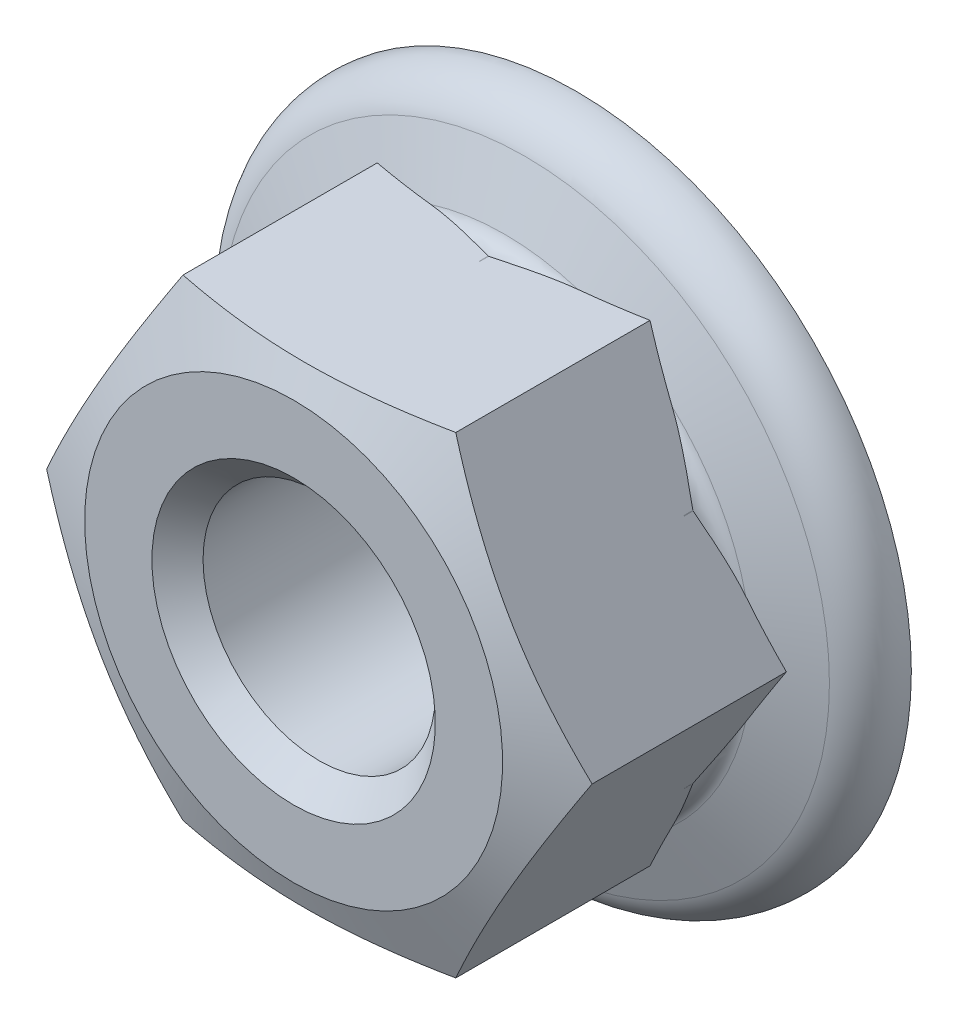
ISO-10303-21;
HEADER;
FILE_DESCRIPTION(('STEP AP214'),'2;1');
FILE_NAME('part.step','',(''),(''),'','','');
FILE_SCHEMA(('AUTOMOTIVE_DESIGN { 1 0 10303 214 1 1 1 1 }'));
ENDSEC;
DATA;
#1=APPLICATION_CONTEXT('core data for automotive mechanical design processes');
#2=APPLICATION_PROTOCOL_DEFINITION('international standard','automotive_design',2000,#1);
#3=PRODUCT_CONTEXT('',#1,'mechanical');
#4=PRODUCT('Part','Part','',(#3));
#5=PRODUCT_RELATED_PRODUCT_CATEGORY('part','',(#4));
#6=PRODUCT_DEFINITION_FORMATION('','',#4);
#7=PRODUCT_DEFINITION_CONTEXT('part definition',#1,'design');
#8=PRODUCT_DEFINITION('design','',#6,#7);
#9=PRODUCT_DEFINITION_SHAPE('','',#8);
#10=(LENGTH_UNIT() NAMED_UNIT(*) SI_UNIT(.MILLI.,.METRE.));
#11=(NAMED_UNIT(*) PLANE_ANGLE_UNIT() SI_UNIT($,.RADIAN.));
#12=(NAMED_UNIT(*) SI_UNIT($,.STERADIAN.) SOLID_ANGLE_UNIT());
#13=UNCERTAINTY_MEASURE_WITH_UNIT(LENGTH_MEASURE(1.E-05),#10,'distance_accuracy_value','');
#14=(GEOMETRIC_REPRESENTATION_CONTEXT(3) GLOBAL_UNCERTAINTY_ASSIGNED_CONTEXT((#13)) GLOBAL_UNIT_ASSIGNED_CONTEXT((#10,
#11,#12)) REPRESENTATION_CONTEXT('',''));
#15=CARTESIAN_POINT('',(0.,0.,0.));
#16=DIRECTION('',(0.,0.,1.));
#17=DIRECTION('',(1.,0.,0.));
#18=AXIS2_PLACEMENT_3D('',#15,#16,#17);
#19=CARTESIAN_POINT('',(5.7735,0.,6.));
#20=DIRECTION('',(0.,0.,1.));
#21=DIRECTION('',(1.,0.,0.));
#22=AXIS2_PLACEMENT_3D('',#19,#20,#21);
#23=PLANE('',#22);
#24=CARTESIAN_POINT('',(0.,0.,6.));
#25=DIRECTION('',(0.,0.,-1.));
#26=DIRECTION('',(0.,1.,0.));
#27=AXIS2_PLACEMENT_3D('',#24,#25,#26);
#28=CIRCLE('',#27,3.);
#29=CARTESIAN_POINT('',(0.,3.,6.));
#30=VERTEX_POINT('',#29);
#31=EDGE_CURVE('E442',#30,#30,#28,.T.);
#32=ORIENTED_EDGE('',*,*,#31,.T.);
#33=EDGE_LOOP('',(#32));
#34=FACE_BOUND('',#33,.T.);
#35=CARTESIAN_POINT('',(0.,0.,6.));
#36=DIRECTION('',(0.,0.,-1.));
#37=DIRECTION('',(0.,1.,0.));
#38=AXIS2_PLACEMENT_3D('',#35,#36,#37);
#39=CIRCLE('',#38,4.4234526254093);
#40=CARTESIAN_POINT('',(0.,4.4234526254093,6.));
#41=VERTEX_POINT('',#40);
#42=EDGE_CURVE('E439',#41,#41,#39,.T.);
#43=ORIENTED_EDGE('',*,*,#42,.F.);
#44=EDGE_LOOP('',(#43));
#45=FACE_BOUND('',#44,.T.);
#46=ADVANCED_FACE('F16',(#34,#45),#23,.T.);
#47=CARTESIAN_POINT('',(0.,0.,6.));
#48=DIRECTION('',(0.,0.,1.));
#49=DIRECTION('',(0.,-1.,0.));
#50=AXIS2_PLACEMENT_3D('',#47,#48,#49);
#51=CONICAL_SURFACE('',#50,3.,0.785398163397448);
#52=CARTESIAN_POINT('',(0.,0.,5.45875));
#53=DIRECTION('',(0.,0.,-1.));
#54=DIRECTION('',(0.,1.,0.));
#55=AXIS2_PLACEMENT_3D('',#52,#53,#54);
#56=CIRCLE('',#55,2.45875);
#57=CARTESIAN_POINT('',(0.,2.45875,5.45875));
#58=VERTEX_POINT('',#57);
#59=EDGE_CURVE('E445',#58,#58,#56,.T.);
#60=ORIENTED_EDGE('',*,*,#59,.T.);
#61=EDGE_LOOP('',(#60));
#62=FACE_BOUND('',#61,.T.);
#63=ORIENTED_EDGE('',*,*,#31,.F.);
#64=EDGE_LOOP('',(#63));
#65=FACE_BOUND('',#64,.T.);
#66=ADVANCED_FACE('F397',(#62,#65),#51,.F.);
#67=CARTESIAN_POINT('',(0.,0.,0.));
#68=DIRECTION('',(0.,0.,-1.));
#69=DIRECTION('',(0.,1.,0.));
#70=AXIS2_PLACEMENT_3D('',#67,#68,#69);
#71=CYLINDRICAL_SURFACE('',#70,2.45875);
#72=CARTESIAN_POINT('',(0.,0.,0.54125));
#73=DIRECTION('',(0.,0.,-1.));
#74=DIRECTION('',(0.,1.,0.));
#75=AXIS2_PLACEMENT_3D('',#72,#73,#74);
#76=CIRCLE('',#75,2.45875);
#77=CARTESIAN_POINT('',(0.,2.45875,0.54125));
#78=VERTEX_POINT('',#77);
#79=EDGE_CURVE('E447',#78,#78,#76,.T.);
#80=ORIENTED_EDGE('',*,*,#79,.T.);
#81=EDGE_LOOP('',(#80));
#82=FACE_BOUND('',#81,.T.);
#83=ORIENTED_EDGE('',*,*,#59,.F.);
#84=EDGE_LOOP('',(#83));
#85=FACE_BOUND('',#84,.T.);
#86=ADVANCED_FACE('F596',(#82,#85),#71,.F.);
#87=CARTESIAN_POINT('',(0.,0.,0.));
#88=DIRECTION('',(0.,0.,-1.));
#89=DIRECTION('',(0.,1.,0.));
#90=AXIS2_PLACEMENT_3D('',#87,#88,#89);
#91=CONICAL_SURFACE('',#90,3.,0.785398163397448);
#92=ORIENTED_EDGE('',*,*,#79,.F.);
#93=EDGE_LOOP('',(#92));
#94=FACE_BOUND('',#93,.T.);
#95=CARTESIAN_POINT('',(0.,0.,0.));
#96=DIRECTION('',(0.,0.,-1.));
#97=DIRECTION('',(0.,1.,0.));
#98=AXIS2_PLACEMENT_3D('',#95,#96,#97);
#99=CIRCLE('',#98,3.);
#100=CARTESIAN_POINT('',(0.,3.,0.));
#101=VERTEX_POINT('',#100);
#102=EDGE_CURVE('E436',#101,#101,#99,.T.);
#103=ORIENTED_EDGE('',*,*,#102,.T.);
#104=EDGE_LOOP('',(#103));
#105=FACE_BOUND('',#104,.T.);
#106=ADVANCED_FACE('F393',(#94,#105),#91,.F.);
#107=CARTESIAN_POINT('',(0.,0.,5.45454545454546));
#108=DIRECTION('',(0.,0.,-1.));
#109=DIRECTION('',(0.,1.,0.));
#110=AXIS2_PLACEMENT_3D('',#107,#108,#109);
#111=CONICAL_SURFACE('',#110,5.7735,1.18682389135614);
#112=ORIENTED_EDGE('',*,*,#42,.T.);
#113=EDGE_LOOP('',(#112));
#114=FACE_BOUND('',#113,.T.);
#115=CARTESIAN_POINT('',(-7.62295418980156,-4.99999766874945,4.10391159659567));
#116=CARTESIAN_POINT('',(-7.39749010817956,-4.99999766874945,4.18006003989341));
#117=CARTESIAN_POINT('',(-7.17172557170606,-4.99999766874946,4.25533533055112));
#118=CARTESIAN_POINT('',(-6.71944012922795,-4.99999766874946,4.4036516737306));
#119=CARTESIAN_POINT('',(-6.4929191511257,-4.99999766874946,4.47669250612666));
#120=CARTESIAN_POINT('',(-6.03845964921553,-4.99999766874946,4.62021052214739));
#121=CARTESIAN_POINT('',(-5.81051902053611,-4.99999766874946,4.6906810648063));
#122=CARTESIAN_POINT('',(-5.35360683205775,-4.99999766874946,4.82818971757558));
#123=CARTESIAN_POINT('',(-5.1246352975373,-4.99999766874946,4.89522791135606));
#124=CARTESIAN_POINT('',(-4.6684725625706,-4.99999766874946,5.02415960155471));
#125=CARTESIAN_POINT('',(-4.44129721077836,-4.99999766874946,5.08610889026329));
#126=CARTESIAN_POINT('',(-3.98556355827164,-4.99999766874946,5.20476071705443));
#127=CARTESIAN_POINT('',(-3.75700521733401,-4.99999766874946,5.26146310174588));
#128=CARTESIAN_POINT('',(-3.29847395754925,-4.99999766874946,5.36826330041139));
#129=CARTESIAN_POINT('',(-3.06850191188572,-4.99999766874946,5.41836483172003));
#130=CARTESIAN_POINT('',(-2.60692388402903,-4.99999766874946,5.5104116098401));
#131=CARTESIAN_POINT('',(-2.37531802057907,-4.99999766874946,5.55235744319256));
#132=CARTESIAN_POINT('',(-1.95804910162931,-4.99999766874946,5.61876750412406));
#133=CARTESIAN_POINT('',(-1.77267731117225,-4.99999766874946,5.64505253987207));
#134=CARTESIAN_POINT('',(-1.40106379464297,-4.99999766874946,5.69046942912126));
#135=CARTESIAN_POINT('',(-1.21482214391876,-4.99999766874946,5.70960189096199));
#136=CARTESIAN_POINT('',(-0.841803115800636,-4.99999766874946,5.7399587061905));
#137=CARTESIAN_POINT('',(-0.655026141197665,-4.99999766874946,5.75118794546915));
#138=CARTESIAN_POINT('',(-0.281153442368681,-4.99999766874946,5.76526695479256));
#139=CARTESIAN_POINT('',(-0.0940577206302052,-4.99999766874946,5.76811678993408));
#140=CARTESIAN_POINT('',(0.280992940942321,-4.99999766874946,5.76529872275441));
#141=CARTESIAN_POINT('',(0.468947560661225,-4.99999766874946,5.75958868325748));
#142=CARTESIAN_POINT('',(0.844415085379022,-4.99999766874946,5.73983597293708));
#143=CARTESIAN_POINT('',(1.03192798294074,-4.99999766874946,5.72579316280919));
#144=CARTESIAN_POINT('',(1.40632412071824,-4.99999766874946,5.68996368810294));
#145=CARTESIAN_POINT('',(1.59320688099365,-4.99999766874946,5.66817207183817));
#146=CARTESIAN_POINT('',(1.96602209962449,-4.99999766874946,5.61766553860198));
#147=CARTESIAN_POINT('',(2.15195456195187,-4.99999766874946,5.58895065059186));
#148=CARTESIAN_POINT('',(2.55634293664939,-4.99999766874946,5.51976152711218));
#149=CARTESIAN_POINT('',(2.77459435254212,-4.99999766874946,5.47809958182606));
#150=CARTESIAN_POINT('',(3.20966164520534,-4.99999766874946,5.38783834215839));
#151=CARTESIAN_POINT('',(3.42647738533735,-4.99999766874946,5.33923839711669));
#152=CARTESIAN_POINT('',(3.85887070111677,-4.99999766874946,5.23637054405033));
#153=CARTESIAN_POINT('',(4.07444756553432,-4.99999766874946,5.18209966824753));
#154=CARTESIAN_POINT('',(4.50438505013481,-4.99999766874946,5.06899657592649));
#155=CARTESIAN_POINT('',(4.71874571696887,-4.99999766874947,5.01016453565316));
#156=CARTESIAN_POINT('',(5.14698824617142,-4.99999766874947,4.88865366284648));
#157=CARTESIAN_POINT('',(5.36086729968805,-4.99999766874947,4.82596497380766));
#158=CARTESIAN_POINT('',(5.78772151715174,-4.99999766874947,4.69758021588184));
#159=CARTESIAN_POINT('',(6.00069666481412,-4.99999766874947,4.63188409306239));
#160=CARTESIAN_POINT('',(6.63834674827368,-4.99999766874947,4.43118925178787));
#161=CARTESIAN_POINT('',(7.06187381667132,-4.99999766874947,4.29254711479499));
#162=CARTESIAN_POINT('',(7.90368353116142,-4.99999766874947,4.00972388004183));
#163=CARTESIAN_POINT('',(8.32198202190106,-4.99999766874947,3.86558948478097));
#164=CARTESIAN_POINT('',(9.157009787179,-4.99999766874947,3.57275270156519));
#165=CARTESIAN_POINT('',(9.57373893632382,-4.99999766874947,3.42404995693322));
#166=CARTESIAN_POINT('',(10.4032135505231,-4.99999766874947,3.12435935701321));
#167=CARTESIAN_POINT('',(10.8159669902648,-4.99999766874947,2.97339351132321));
#168=CARTESIAN_POINT('',(11.4343983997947,-4.99999766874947,2.74513684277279));
#169=CARTESIAN_POINT('',(11.6404126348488,-4.99999766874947,2.66875489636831));
#170=CARTESIAN_POINT('',(12.0522424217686,-4.99999766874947,2.51545939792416));
#171=CARTESIAN_POINT('',(12.258057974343,-4.99999766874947,2.43854584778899));
#172=CARTESIAN_POINT('',(12.4637876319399,-4.99999766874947,2.36140327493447));
#173=B_SPLINE_CURVE_WITH_KNOTS('',3,(#115,#116,#117,#118,#119,#120,#121,#122,#123,#124,#125,
#126,#127,#128,#129,#130,#131,#132,#133,#134,#135,#136,#137,#138,#139,#140,#141,#142,#143,#144,
#145,#146,#147,#148,#149,#150,#151,#152,#153,#154,#155,#156,#157,#158,#159,#160,#161,#162,#163,
#164,#165,#166,#167,#168,#169,#170,#171,#172),.UNSPECIFIED.,.F.,.F.,(4,2,2,2,2,2,2,2,2,2,2,2,2,
2,2,2,2,2,2,2,2,2,2,2,2,2,2,2,4),(0.,0.713934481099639,1.42793906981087,2.14367379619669,
2.85939106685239,3.56575330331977,4.27213618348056,4.97811954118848,5.68405210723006,
6.24561055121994,6.80712122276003,7.36828445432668,7.92944332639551,8.49337366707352,
9.05731343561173,9.62161422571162,10.1859126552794,10.8523476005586,11.5188450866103,
12.1856931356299,12.8525154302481,13.5211190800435,14.1897347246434,15.5265679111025,
16.8538407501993,18.1812174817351,19.4996933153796,20.1588472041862,20.8179987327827),.UNSPECIFIED.);
#174=CARTESIAN_POINT('',(-2.88675,-4.99999766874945,5.45454545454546));
#175=VERTEX_POINT('',#174);
#176=CARTESIAN_POINT('',(2.88675,-4.99999766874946,5.45454545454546));
#177=VERTEX_POINT('',#176);
#178=EDGE_CURVE('E401',#175,#177,#173,.T.);
#179=ORIENTED_EDGE('',*,*,#178,.T.);
#180=CARTESIAN_POINT('',(2.88674988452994,-4.99999786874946,5.45454540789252));
#181=CARTESIAN_POINT('',(2.98760513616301,-4.82531144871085,5.49529591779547));
#182=CARTESIAN_POINT('',(3.08879327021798,-4.65004845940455,5.53297631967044));
#183=CARTESIAN_POINT('',(3.29183863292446,-4.29836357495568,5.60103879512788));
#184=CARTESIAN_POINT('',(3.39369621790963,-4.12194106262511,5.63141659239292));
#185=CARTESIAN_POINT('',(3.59793549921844,-3.76818825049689,5.68365761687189));
#186=CARTESIAN_POINT('',(3.70031703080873,-3.59085823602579,5.70552337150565));
#187=CARTESIAN_POINT('',(3.9054603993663,-3.23553949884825,5.73972701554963));
#188=CARTESIAN_POINT('',(4.00822214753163,-3.0575509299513,5.75206700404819));
#189=CARTESIAN_POINT('',(4.21218124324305,-2.70428341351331,5.76645174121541));
#190=CARTESIAN_POINT('',(4.31337552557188,-2.52900977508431,5.76866774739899));
#191=CARTESIAN_POINT('',(4.51570428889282,-2.17856607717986,5.76315103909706));
#192=CARTESIAN_POINT('',(4.61683876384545,-2.00339602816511,5.75541744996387));
#193=CARTESIAN_POINT('',(4.81874245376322,-1.65368857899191,5.73041729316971));
#194=CARTESIAN_POINT('',(4.91951185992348,-1.47915084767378,5.71315678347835));
#195=CARTESIAN_POINT('',(5.12056954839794,-1.13090871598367,5.669939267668));
#196=CARTESIAN_POINT('',(5.22085787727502,-0.957204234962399,5.6439831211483));
#197=CARTESIAN_POINT('',(5.35868198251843,-0.718485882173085,5.60295396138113));
#198=CARTESIAN_POINT('',(5.39646887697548,-0.653037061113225,5.59114710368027));
#199=CARTESIAN_POINT('',(5.47195348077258,-0.522293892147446,5.5665052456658));
#200=CARTESIAN_POINT('',(5.50965120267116,-0.456999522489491,5.5536704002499));
#201=CARTESIAN_POINT('',(5.58508963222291,-0.32633632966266,5.52698625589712));
#202=CARTESIAN_POINT('',(5.62283004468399,-0.260968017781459,5.513133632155));
#203=CARTESIAN_POINT('',(5.69822818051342,-0.130374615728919,5.48451170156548));
#204=CARTESIAN_POINT('',(5.73588589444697,-0.0651495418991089,5.46974229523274));
#205=CARTESIAN_POINT('',(5.77350011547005,2.00000001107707E-07,5.45454540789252));
#206=B_SPLINE_CURVE_WITH_KNOTS('',3,(#180,#181,#182,#183,#184,#185,#186,#187,#188,#189,#190,
#191,#192,#193,#194,#195,#196,#197,#198,#199,#200,#201,#202,#203,#204,#205),.UNSPECIFIED.,.F.,
.F.,(4,2,2,2,2,2,2,2,2,2,2,2,4),(0.,0.617400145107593,1.23516095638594,1.85273820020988,
2.47017931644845,3.07713614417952,3.68414633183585,4.29077097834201,4.89733567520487,
5.12680289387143,5.35623560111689,5.58645432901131,5.81669808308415),.UNSPECIFIED.);
#207=CARTESIAN_POINT('',(5.7735,0.,5.45454545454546));
#208=VERTEX_POINT('',#207);
#209=EDGE_CURVE('E415',#177,#208,#206,.T.);
#210=ORIENTED_EDGE('',*,*,#209,.T.);
#211=CARTESIAN_POINT('',(5.77350011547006,-2.0000000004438E-07,5.45454540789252));
#212=CARTESIAN_POINT('',(5.67264486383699,0.174686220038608,5.49529591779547));
#213=CARTESIAN_POINT('',(5.57145672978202,0.349949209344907,5.53297631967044));
#214=CARTESIAN_POINT('',(5.36841136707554,0.701634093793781,5.60103879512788));
#215=CARTESIAN_POINT('',(5.26655378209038,0.878056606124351,5.63141659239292));
#216=CARTESIAN_POINT('',(5.06231450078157,1.23180941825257,5.68365761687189));
#217=CARTESIAN_POINT('',(4.95993296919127,1.40913943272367,5.70552337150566));
#218=CARTESIAN_POINT('',(4.75478960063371,1.76445816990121,5.73972701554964));
#219=CARTESIAN_POINT('',(4.65202785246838,1.94244673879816,5.75206700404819));
#220=CARTESIAN_POINT('',(4.44806875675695,2.29571425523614,5.76645174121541));
#221=CARTESIAN_POINT('',(4.34687447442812,2.47098789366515,5.76866774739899));
#222=CARTESIAN_POINT('',(4.14454571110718,2.8214315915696,5.76315103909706));
#223=CARTESIAN_POINT('',(4.04341123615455,2.99660164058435,5.75541744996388));
#224=CARTESIAN_POINT('',(3.84150754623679,3.34630908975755,5.73041729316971));
#225=CARTESIAN_POINT('',(3.74073814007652,3.52084682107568,5.71315678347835));
#226=CARTESIAN_POINT('',(3.53968045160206,3.86908895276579,5.669939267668));
#227=CARTESIAN_POINT('',(3.43939212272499,4.04279343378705,5.6439831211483));
#228=CARTESIAN_POINT('',(3.30156801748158,4.28151178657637,5.60295396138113));
#229=CARTESIAN_POINT('',(3.26378112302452,4.34696060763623,5.59114710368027));
#230=CARTESIAN_POINT('',(3.18829651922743,4.47770377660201,5.5665052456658));
#231=CARTESIAN_POINT('',(3.15059879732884,4.54299814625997,5.5536704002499));
#232=CARTESIAN_POINT('',(3.07516036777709,4.6736613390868,5.52698625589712));
#233=CARTESIAN_POINT('',(3.03741995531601,4.739029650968,5.513133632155));
#234=CARTESIAN_POINT('',(2.96202181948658,4.86962305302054,5.48451170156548));
#235=CARTESIAN_POINT('',(2.92436410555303,4.93484812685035,5.46974229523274));
#236=CARTESIAN_POINT('',(2.88674988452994,4.99999786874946,5.45454540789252));
#237=B_SPLINE_CURVE_WITH_KNOTS('',3,(#211,#212,#213,#214,#215,#216,#217,#218,#219,#220,#221,
#222,#223,#224,#225,#226,#227,#228,#229,#230,#231,#232,#233,#234,#235,#236),.UNSPECIFIED.,.F.,
.F.,(4,2,2,2,2,2,2,2,2,2,2,2,4),(0.,0.617400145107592,1.23516095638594,1.85273820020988,
2.47017931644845,3.07713614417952,3.68414633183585,4.29077097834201,4.89733567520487,
5.12680289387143,5.35623560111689,5.58645432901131,5.81669808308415),.UNSPECIFIED.);
#238=CARTESIAN_POINT('',(2.88675,4.99999766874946,5.45454545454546));
#239=VERTEX_POINT('',#238);
#240=EDGE_CURVE('E45',#208,#239,#237,.T.);
#241=ORIENTED_EDGE('',*,*,#240,.T.);
#242=CARTESIAN_POINT('',(-7.62295418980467,4.99999766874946,4.10391159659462));
#243=CARTESIAN_POINT('',(-7.39749010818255,4.99999766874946,4.1800600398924));
#244=CARTESIAN_POINT('',(-7.17172557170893,4.99999766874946,4.25533533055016));
#245=CARTESIAN_POINT('',(-6.71944012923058,4.99999766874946,4.40365167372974));
#246=CARTESIAN_POINT('',(-6.49291915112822,4.99999766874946,4.47669250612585));
#247=CARTESIAN_POINT('',(-6.03845964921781,4.99999766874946,4.62021052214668));
#248=CARTESIAN_POINT('',(-5.81051902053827,4.99999766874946,4.69068106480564));
#249=CARTESIAN_POINT('',(-5.35360683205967,4.99999766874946,4.82818971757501));
#250=CARTESIAN_POINT('',(-5.1246352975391,4.99999766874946,4.89522791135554));
#251=CARTESIAN_POINT('',(-4.66847256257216,4.99999766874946,5.02415960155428));
#252=CARTESIAN_POINT('',(-4.4412972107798,4.99999766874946,5.08610889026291));
#253=CARTESIAN_POINT('',(-3.98556355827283,4.99999766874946,5.20476071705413));
#254=CARTESIAN_POINT('',(-3.75700521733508,4.99999766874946,5.26146310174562));
#255=CARTESIAN_POINT('',(-3.29847395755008,4.99999766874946,5.36826330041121));
#256=CARTESIAN_POINT('',(-3.06850191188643,4.99999766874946,5.41836483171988));
#257=CARTESIAN_POINT('',(-2.60692388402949,4.99999766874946,5.51041160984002));
#258=CARTESIAN_POINT('',(-2.37531802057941,4.99999766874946,5.55235744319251));
#259=CARTESIAN_POINT('',(-1.95804910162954,4.99999766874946,5.61876750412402));
#260=CARTESIAN_POINT('',(-1.77267731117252,4.99999766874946,5.64505253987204));
#261=CARTESIAN_POINT('',(-1.40106379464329,4.99999766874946,5.69046942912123));
#262=CARTESIAN_POINT('',(-1.21482214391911,4.99999766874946,5.70960189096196));
#263=CARTESIAN_POINT('',(-0.841803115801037,4.99999766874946,5.73995870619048));
#264=CARTESIAN_POINT('',(-0.655026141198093,4.99999766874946,5.75118794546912));
#265=CARTESIAN_POINT('',(-0.281153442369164,4.99999766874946,5.76526695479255));
#266=CARTESIAN_POINT('',(-0.0940577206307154,4.99999766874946,5.76811678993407));
#267=CARTESIAN_POINT('',(0.280992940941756,4.99999766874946,5.76529872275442));
#268=CARTESIAN_POINT('',(0.468947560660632,4.99999766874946,5.7595886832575));
#269=CARTESIAN_POINT('',(0.844415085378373,4.99999766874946,5.73983597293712));
#270=CARTESIAN_POINT('',(1.03192798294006,4.99999766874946,5.72579316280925));
#271=CARTESIAN_POINT('',(1.40632412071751,4.99999766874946,5.68996368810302));
#272=CARTESIAN_POINT('',(1.59320688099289,4.99999766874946,5.66817207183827));
#273=CARTESIAN_POINT('',(1.96602209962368,4.99999766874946,5.6176655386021));
#274=CARTESIAN_POINT('',(2.15195456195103,4.99999766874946,5.588950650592));
#275=CARTESIAN_POINT('',(2.55634293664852,4.99999766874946,5.51976152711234));
#276=CARTESIAN_POINT('',(2.77459435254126,4.99999766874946,5.47809958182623));
#277=CARTESIAN_POINT('',(3.20966164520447,4.99999766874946,5.38783834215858));
#278=CARTESIAN_POINT('',(3.42647738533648,4.99999766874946,5.33923839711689));
#279=CARTESIAN_POINT('',(3.85887070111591,4.99999766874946,5.23637054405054));
#280=CARTESIAN_POINT('',(4.07444756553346,4.99999766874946,5.18209966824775));
#281=CARTESIAN_POINT('',(4.50438505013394,4.99999766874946,5.06899657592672));
#282=CARTESIAN_POINT('',(4.71874571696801,4.99999766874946,5.0101645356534));
#283=CARTESIAN_POINT('',(5.14698824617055,4.99999766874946,4.88865366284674));
#284=CARTESIAN_POINT('',(5.36086729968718,4.99999766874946,4.82596497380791));
#285=CARTESIAN_POINT('',(5.78772151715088,4.99999766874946,4.69758021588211));
#286=CARTESIAN_POINT('',(6.00069666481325,4.99999766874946,4.63188409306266));
#287=CARTESIAN_POINT('',(6.63834674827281,4.99999766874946,4.43118925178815));
#288=CARTESIAN_POINT('',(7.06187381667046,4.99999766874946,4.29254711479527));
#289=CARTESIAN_POINT('',(7.90368353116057,4.99999766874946,4.00972388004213));
#290=CARTESIAN_POINT('',(8.32198202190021,4.99999766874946,3.86558948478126));
#291=CARTESIAN_POINT('',(9.15700978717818,4.99999766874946,3.57275270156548));
#292=CARTESIAN_POINT('',(9.573738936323,4.99999766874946,3.42404995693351));
#293=CARTESIAN_POINT('',(10.4032135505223,4.99999766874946,3.1243593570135));
#294=CARTESIAN_POINT('',(10.815966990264,4.99999766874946,2.9733935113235));
#295=CARTESIAN_POINT('',(11.4343983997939,4.99999766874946,2.74513684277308));
#296=CARTESIAN_POINT('',(11.640412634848,4.99999766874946,2.6687548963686));
#297=CARTESIAN_POINT('',(12.0522424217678,4.99999766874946,2.51545939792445));
#298=CARTESIAN_POINT('',(12.2580579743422,4.99999766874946,2.43854584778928));
#299=CARTESIAN_POINT('',(12.4637876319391,4.99999766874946,2.36140327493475));
#300=B_SPLINE_CURVE_WITH_KNOTS('',3,(#242,#243,#244,#245,#246,#247,#248,#249,#250,#251,#252,
#253,#254,#255,#256,#257,#258,#259,#260,#261,#262,#263,#264,#265,#266,#267,#268,#269,#270,#271,
#272,#273,#274,#275,#276,#277,#278,#279,#280,#281,#282,#283,#284,#285,#286,#287,#288,#289,#290,
#291,#292,#293,#294,#295,#296,#297,#298,#299),.UNSPECIFIED.,.F.,.F.,(4,2,2,2,2,2,2,2,2,2,2,2,2,
2,2,2,2,2,2,2,2,2,2,2,2,2,2,2,4),(0.,0.713934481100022,1.42793906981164,2.14367379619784,
2.85939106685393,3.5657533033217,4.27213618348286,4.97811954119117,5.68405210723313,
6.24561055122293,6.80712122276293,7.36828445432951,7.92944332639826,8.49337366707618,
9.0573134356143,9.62161422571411,10.1859126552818,10.852347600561,11.5188450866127,
12.1856931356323,12.8525154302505,13.5211190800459,14.1897347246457,15.5265679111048,
16.8538407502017,18.1812174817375,19.499693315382,20.1588472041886,20.8179987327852),.UNSPECIFIED.);
#301=CARTESIAN_POINT('',(-2.88675,4.99999766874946,5.45454545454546));
#302=VERTEX_POINT('',#301);
#303=EDGE_CURVE('E376',#239,#302,#300,.F.);
#304=ORIENTED_EDGE('',*,*,#303,.T.);
#305=CARTESIAN_POINT('',(-2.88674988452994,4.99999786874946,5.45454540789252));
#306=CARTESIAN_POINT('',(-2.98760513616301,4.82531144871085,5.49529591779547));
#307=CARTESIAN_POINT('',(-3.08879327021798,4.65004845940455,5.53297631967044));
#308=CARTESIAN_POINT('',(-3.29183863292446,4.29836357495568,5.60103879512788));
#309=CARTESIAN_POINT('',(-3.39369621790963,4.12194106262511,5.63141659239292));
#310=CARTESIAN_POINT('',(-3.59793549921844,3.76818825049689,5.68365761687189));
#311=CARTESIAN_POINT('',(-3.70031703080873,3.59085823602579,5.70552337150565));
#312=CARTESIAN_POINT('',(-3.9054603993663,3.23553949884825,5.73972701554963));
#313=CARTESIAN_POINT('',(-4.00822214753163,3.0575509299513,5.75206700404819));
#314=CARTESIAN_POINT('',(-4.21218124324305,2.70428341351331,5.76645174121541));
#315=CARTESIAN_POINT('',(-4.31337552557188,2.52900977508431,5.76866774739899));
#316=CARTESIAN_POINT('',(-4.51570428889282,2.17856607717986,5.76315103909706));
#317=CARTESIAN_POINT('',(-4.61683876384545,2.0033960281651,5.75541744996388));
#318=CARTESIAN_POINT('',(-4.81874245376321,1.65368857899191,5.73041729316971));
#319=CARTESIAN_POINT('',(-4.91951185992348,1.47915084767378,5.71315678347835));
#320=CARTESIAN_POINT('',(-5.12056954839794,1.13090871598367,5.669939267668));
#321=CARTESIAN_POINT('',(-5.22085787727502,0.957204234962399,5.6439831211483));
#322=CARTESIAN_POINT('',(-5.35868198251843,0.718485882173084,5.60295396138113));
#323=CARTESIAN_POINT('',(-5.39646887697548,0.653037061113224,5.59114710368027));
#324=CARTESIAN_POINT('',(-5.47195348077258,0.522293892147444,5.5665052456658));
#325=CARTESIAN_POINT('',(-5.50965120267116,0.456999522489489,5.5536704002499));
#326=CARTESIAN_POINT('',(-5.58508963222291,0.326336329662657,5.52698625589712));
#327=CARTESIAN_POINT('',(-5.62283004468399,0.260968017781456,5.51313363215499));
#328=CARTESIAN_POINT('',(-5.69822818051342,0.130374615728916,5.48451170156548));
#329=CARTESIAN_POINT('',(-5.73588589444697,0.0651495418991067,5.46974229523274));
#330=CARTESIAN_POINT('',(-5.77350011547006,-1.9999999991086E-07,5.45454540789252));
#331=B_SPLINE_CURVE_WITH_KNOTS('',3,(#305,#306,#307,#308,#309,#310,#311,#312,#313,#314,#315,
#316,#317,#318,#319,#320,#321,#322,#323,#324,#325,#326,#327,#328,#329,#330),.UNSPECIFIED.,.F.,
.F.,(4,2,2,2,2,2,2,2,2,2,2,2,4),(0.,0.617400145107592,1.23516095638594,1.85273820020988,
2.47017931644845,3.07713614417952,3.68414633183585,4.29077097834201,4.89733567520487,
5.12680289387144,5.3562356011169,5.58645432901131,5.81669808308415),.UNSPECIFIED.);
#332=CARTESIAN_POINT('',(-5.7735,0.,5.45454545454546));
#333=VERTEX_POINT('',#332);
#334=EDGE_CURVE('E367',#302,#333,#331,.T.);
#335=ORIENTED_EDGE('',*,*,#334,.T.);
#336=CARTESIAN_POINT('',(-5.77350011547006,2.00000000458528E-07,5.45454540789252));
#337=CARTESIAN_POINT('',(-5.67264486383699,-0.174686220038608,5.49529591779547));
#338=CARTESIAN_POINT('',(-5.57145672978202,-0.349949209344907,5.53297631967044));
#339=CARTESIAN_POINT('',(-5.36841136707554,-0.701634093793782,5.60103879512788));
#340=CARTESIAN_POINT('',(-5.26655378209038,-0.878056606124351,5.63141659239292));
#341=CARTESIAN_POINT('',(-5.06231450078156,-1.23180941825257,5.68365761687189));
#342=CARTESIAN_POINT('',(-4.95993296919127,-1.40913943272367,5.70552337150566));
#343=CARTESIAN_POINT('',(-4.7547896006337,-1.76445816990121,5.73972701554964));
#344=CARTESIAN_POINT('',(-4.65202785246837,-1.94244673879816,5.75206700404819));
#345=CARTESIAN_POINT('',(-4.44806875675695,-2.29571425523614,5.76645174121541));
#346=CARTESIAN_POINT('',(-4.34687447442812,-2.47098789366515,5.76866774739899));
#347=CARTESIAN_POINT('',(-4.14454571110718,-2.8214315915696,5.76315103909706));
#348=CARTESIAN_POINT('',(-4.04341123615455,-2.99660164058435,5.75541744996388));
#349=CARTESIAN_POINT('',(-3.84150754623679,-3.34630908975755,5.73041729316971));
#350=CARTESIAN_POINT('',(-3.74073814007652,-3.52084682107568,5.71315678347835));
#351=CARTESIAN_POINT('',(-3.53968045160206,-3.86908895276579,5.669939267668));
#352=CARTESIAN_POINT('',(-3.43939212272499,-4.04279343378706,5.6439831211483));
#353=CARTESIAN_POINT('',(-3.30156801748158,-4.28151178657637,5.60295396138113));
#354=CARTESIAN_POINT('',(-3.26378112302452,-4.34696060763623,5.59114710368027));
#355=CARTESIAN_POINT('',(-3.18829651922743,-4.47770377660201,5.5665052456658));
#356=CARTESIAN_POINT('',(-3.15059879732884,-4.54299814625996,5.5536704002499));
#357=CARTESIAN_POINT('',(-3.07516036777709,-4.6736613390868,5.52698625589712));
#358=CARTESIAN_POINT('',(-3.03741995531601,-4.73902965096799,5.513133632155));
#359=CARTESIAN_POINT('',(-2.96202181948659,-4.86962305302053,5.48451170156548));
#360=CARTESIAN_POINT('',(-2.92436410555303,-4.93484812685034,5.46974229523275));
#361=CARTESIAN_POINT('',(-2.88674988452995,-4.99999786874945,5.45454540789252));
#362=B_SPLINE_CURVE_WITH_KNOTS('',3,(#336,#337,#338,#339,#340,#341,#342,#343,#344,#345,#346,
#347,#348,#349,#350,#351,#352,#353,#354,#355,#356,#357,#358,#359,#360,#361),.UNSPECIFIED.,.F.,
.F.,(4,2,2,2,2,2,2,2,2,2,2,2,4),(0.,0.617400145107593,1.23516095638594,1.85273820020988,
2.47017931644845,3.07713614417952,3.68414633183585,4.29077097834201,4.89733567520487,
5.12680289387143,5.35623560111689,5.5864543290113,5.81669808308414),.UNSPECIFIED.);
#363=EDGE_CURVE('E377',#333,#175,#362,.T.);
#364=ORIENTED_EDGE('',*,*,#363,.T.);
#365=EDGE_LOOP('',(#179,#210,#241,#304,#335,#364));
#366=FACE_BOUND('',#365,.T.);
#367=ADVANCED_FACE('F388',(#114,#366),#111,.T.);
#368=CARTESIAN_POINT('',(2.88675,-4.99999766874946,6.));
#369=DIRECTION('',(-0.866025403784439,0.5,0.));
#370=DIRECTION('',(-0.5,-0.866025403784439,0.));
#371=AXIS2_PLACEMENT_3D('',#368,#369,#370);
#372=PLANE('',#371);
#373=DIRECTION('',(0.,0.,-1.));
#374=VECTOR('',#373,1.);
#375=CARTESIAN_POINT('',(2.88675,-4.99999766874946,6.));
#376=LINE('',#375,#374);
#377=CARTESIAN_POINT('',(2.88675,-4.99999766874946,1.34332143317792));
#378=VERTEX_POINT('',#377);
#379=EDGE_CURVE('E471',#177,#378,#376,.T.);
#380=ORIENTED_EDGE('',*,*,#379,.T.);
#381=CARTESIAN_POINT('',(2.38696468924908,-5.86565121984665,1.13977849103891));
#382=CARTESIAN_POINT('',(2.48625145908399,-5.69368148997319,1.18410751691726));
#383=CARTESIAN_POINT('',(2.58575501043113,-5.5213362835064,1.22646205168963));
#384=CARTESIAN_POINT('',(2.78528855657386,-5.17573404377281,1.30630468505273));
#385=CARTESIAN_POINT('',(2.88531874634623,-5.00247667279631,1.34379082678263));
#386=CARTESIAN_POINT('',(3.18664523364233,-4.4805638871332,1.44766478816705));
#387=CARTESIAN_POINT('',(3.3887558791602,-4.13049798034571,1.50527171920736));
#388=CARTESIAN_POINT('',(3.69117694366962,-3.60668933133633,1.56764465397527));
#389=CARTESIAN_POINT('',(3.790882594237,-3.43399407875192,1.58437857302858));
#390=CARTESIAN_POINT('',(3.99056319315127,-3.08813713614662,1.60953689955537));
#391=CARTESIAN_POINT('',(4.09053814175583,-2.91497544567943,1.61796129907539));
#392=CARTESIAN_POINT('',(4.29042788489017,-2.56875625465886,1.62607173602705));
#393=CARTESIAN_POINT('',(4.39034254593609,-2.39569898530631,1.62577081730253));
#394=CARTESIAN_POINT('',(4.59007001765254,-2.04976085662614,1.61648164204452));
#395=CARTESIAN_POINT('',(4.68988282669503,-1.87688000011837,1.60749324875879));
#396=CARTESIAN_POINT('',(4.90979142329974,-1.49598713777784,1.57855741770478));
#397=CARTESIAN_POINT('',(5.02982534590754,-1.28808228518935,1.55673228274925));
#398=CARTESIAN_POINT('',(5.26928821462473,-0.873320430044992,1.50244536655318));
#399=CARTESIAN_POINT('',(5.38871710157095,-0.666463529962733,1.46998256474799));
#400=CARTESIAN_POINT('',(5.62715155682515,-0.25348293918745,1.3960194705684));
#401=CARTESIAN_POINT('',(5.74615546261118,-0.0473621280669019,1.35449804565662));
#402=CARTESIAN_POINT('',(5.9834546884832,0.363652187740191,1.26412833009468));
#403=CARTESIAN_POINT('',(6.10175002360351,0.56854571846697,1.21528019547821));
#404=CARTESIAN_POINT('',(6.34073295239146,0.982476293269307,1.11038392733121));
#405=CARTESIAN_POINT('',(6.4614035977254,1.1914839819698,1.05418264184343));
#406=CARTESIAN_POINT('',(6.70215135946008,1.60847133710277,0.936897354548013));
#407=CARTESIAN_POINT('',(6.82222845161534,1.8164509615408,0.875813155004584));
#408=CARTESIAN_POINT('',(7.06123951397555,2.23043026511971,0.750127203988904));
#409=CARTESIAN_POINT('',(7.1801761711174,2.43643459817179,0.685545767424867));
#410=CARTESIAN_POINT('',(7.41760167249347,2.84766762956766,0.553326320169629));
#411=CARTESIAN_POINT('',(7.53609059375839,3.05289646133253,0.485688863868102));
#412=CARTESIAN_POINT('',(7.65440518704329,3.25782334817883,0.416888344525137));
#413=B_SPLINE_CURVE_WITH_KNOTS('',3,(#381,#382,#383,#384,#385,#386,#387,#388,#389,#390,#391,
#392,#393,#394,#395,#396,#397,#398,#399,#400,#401,#402,#403,#404,#405,#406,#407,#408,#409,#410,
#411,#412),.UNSPECIFIED.,.F.,.F.,(4,2,2,2,2,2,2,2,2,2,2,2,2,2,2,4),(0.,0.610347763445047,
1.22094010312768,2.44471911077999,3.04491185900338,3.64510518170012,4.24440129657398,
4.84370684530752,5.56659867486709,6.28955987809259,7.01422603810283,7.73887676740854,
8.48220912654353,9.22557160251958,9.96500210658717,10.7042990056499),.UNSPECIFIED.);
#414=CARTESIAN_POINT('',(3.55152698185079,-3.84857016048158,1.53863777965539));
#415=VERTEX_POINT('',#414);
#416=EDGE_CURVE('E328',#378,#415,#413,.T.);
#417=ORIENTED_EDGE('',*,*,#416,.T.);
#418=CARTESIAN_POINT('',(2.94337041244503,-4.90192823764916,1.91737352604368));
#419=CARTESIAN_POINT('',(2.94199671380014,-4.90430755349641,1.90582618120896));
#420=CARTESIAN_POINT('',(2.94123081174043,-4.90563413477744,1.89400223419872));
#421=CARTESIAN_POINT('',(2.94089384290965,-4.90621778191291,1.87041717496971));
#422=CARTESIAN_POINT('',(2.94130951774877,-4.90549781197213,1.85865683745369));
#423=CARTESIAN_POINT('',(2.94328554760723,-4.90207522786,1.83553365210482));
#424=CARTESIAN_POINT('',(2.94484608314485,-4.89937230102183,1.82417086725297));
#425=CARTESIAN_POINT('',(2.94893657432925,-4.89228736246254,1.80215774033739));
#426=CARTESIAN_POINT('',(2.95146881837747,-4.88790138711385,1.79150915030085));
#427=CARTESIAN_POINT('',(2.95823571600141,-4.87618077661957,1.76782355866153));
#428=CARTESIAN_POINT('',(2.96275590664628,-4.86835157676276,1.7551164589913));
#429=CARTESIAN_POINT('',(2.97272579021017,-4.85108323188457,1.73126520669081));
#430=CARTESIAN_POINT('',(2.97817754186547,-4.84164052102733,1.72012461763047));
#431=CARTESIAN_POINT('',(2.9937233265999,-4.81471443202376,1.69201684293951));
#432=CARTESIAN_POINT('',(3.00441171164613,-4.79620160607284,1.67637708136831));
#433=CARTESIAN_POINT('',(3.02678569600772,-4.75744872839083,1.64832203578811));
#434=CARTESIAN_POINT('',(3.0384738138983,-4.73720431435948,1.63591523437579));
#435=CARTESIAN_POINT('',(3.06254072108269,-4.69551920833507,1.61356635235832));
#436=CARTESIAN_POINT('',(3.07492468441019,-4.67406955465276,1.60364692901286));
#437=CARTESIAN_POINT('',(3.10006827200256,-4.63051958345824,1.58591153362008));
#438=CARTESIAN_POINT('',(3.1128282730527,-4.60841861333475,1.57809775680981));
#439=CARTESIAN_POINT('',(3.15148039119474,-4.54147118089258,1.55723871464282));
#440=CARTESIAN_POINT('',(3.17772293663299,-4.4960177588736,1.54679392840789));
#441=CARTESIAN_POINT('',(3.22538115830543,-4.41347129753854,1.53247961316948));
#442=CARTESIAN_POINT('',(3.24673841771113,-4.37647943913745,1.52772424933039));
#443=CARTESIAN_POINT('',(3.28951924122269,-4.30238087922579,1.52085396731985));
#444=CARTESIAN_POINT('',(3.31094261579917,-4.26527450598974,1.51873429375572));
#445=CARTESIAN_POINT('',(3.36254231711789,-4.17590120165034,1.51623092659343));
#446=CARTESIAN_POINT('',(3.39273016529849,-4.12361431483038,1.51690576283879));
#447=CARTESIAN_POINT('',(3.45304512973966,-4.01914573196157,1.52162166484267));
#448=CARTESIAN_POINT('',(3.48317220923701,-3.96696409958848,1.52566437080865));
#449=CARTESIAN_POINT('',(3.57349814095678,-3.81051499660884,1.54184732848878));
#450=CARTESIAN_POINT('',(3.63351310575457,-3.70656602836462,1.55804239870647));
#451=CARTESIAN_POINT('',(3.75329780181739,-3.4990928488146,1.59766230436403));
#452=CARTESIAN_POINT('',(3.81306341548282,-3.39557576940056,1.62113336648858));
#453=CARTESIAN_POINT('',(3.93201766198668,-3.1895409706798,1.67269965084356));
#454=CARTESIAN_POINT('',(3.99120684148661,-3.0870223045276,1.70078992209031));
#455=CARTESIAN_POINT('',(4.08499251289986,-2.92458075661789,1.7475985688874));
#456=CARTESIAN_POINT('',(4.11970341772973,-2.86445970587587,1.76542667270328));
#457=CARTESIAN_POINT('',(4.1890714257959,-2.74431079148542,1.80156190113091));
#458=CARTESIAN_POINT('',(4.22372851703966,-2.68428294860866,1.81986911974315));
#459=CARTESIAN_POINT('',(4.26926102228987,-2.60541833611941,1.84435767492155));
#460=CARTESIAN_POINT('',(4.2801753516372,-2.5865141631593,1.85026074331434));
#461=CARTESIAN_POINT('',(4.30203766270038,-2.548647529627,1.86181359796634));
#462=CARTESIAN_POINT('',(4.31298563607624,-2.52968508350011,1.86746344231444));
#463=CARTESIAN_POINT('',(4.32429426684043,-2.51009796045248,1.87407877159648));
#464=CARTESIAN_POINT('',(4.32475298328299,-2.50930344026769,1.87434846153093));
#465=CARTESIAN_POINT('',(4.32551114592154,-2.50799026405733,1.87481481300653));
#466=CARTESIAN_POINT('',(4.32581156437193,-2.50746992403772,1.87500501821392));
#467=CARTESIAN_POINT('',(4.32630796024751,-2.50661014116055,1.87533842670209));
#468=CARTESIAN_POINT('',(4.32650490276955,-2.50626902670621,1.87547577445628));
#469=CARTESIAN_POINT('',(4.32682981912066,-2.50570625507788,1.8757214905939));
#470=CARTESIAN_POINT('',(4.32695882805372,-2.50548280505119,1.87582418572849));
#471=CARTESIAN_POINT('',(4.32717103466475,-2.50511525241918,1.87601160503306));
#472=CARTESIAN_POINT('',(4.3272553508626,-2.5049692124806,1.87609113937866));
#473=CARTESIAN_POINT('',(4.3273934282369,-2.50473005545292,1.87623924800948));
#474=CARTESIAN_POINT('',(4.32744834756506,-2.50463493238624,1.87630321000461));
#475=CARTESIAN_POINT('',(4.32752809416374,-2.50449680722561,1.87641242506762));
#476=CARTESIAN_POINT('',(4.32755480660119,-2.50445053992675,1.8764521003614));
#477=CARTESIAN_POINT('',(4.32760546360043,-2.5043627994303,1.87653800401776));
#478=CARTESIAN_POINT('',(4.32762942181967,-2.50432130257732,1.87658419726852));
#479=CARTESIAN_POINT('',(4.32765830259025,-2.50427127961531,1.87665467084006));
#480=CARTESIAN_POINT('',(4.32766578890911,-2.50425831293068,1.8766746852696));
#481=CARTESIAN_POINT('',(4.32767949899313,-2.50423456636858,1.87671641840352));
#482=CARTESIAN_POINT('',(4.32768572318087,-2.50422378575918,1.87673813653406));
#483=CARTESIAN_POINT('',(4.32769639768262,-2.5042052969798,1.87678366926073));
#484=CARTESIAN_POINT('',(4.32770082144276,-2.50419763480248,1.87680750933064));
#485=CARTESIAN_POINT('',(4.32770744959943,-2.50418615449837,1.87685635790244));
#486=CARTESIAN_POINT('',(4.32770965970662,-2.50418232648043,1.87688136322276));
#487=CARTESIAN_POINT('',(4.32771132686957,-2.5041794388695,1.87692882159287));
#488=CARTESIAN_POINT('',(4.32771107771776,-2.5041798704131,1.87695122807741));
#489=CARTESIAN_POINT('',(4.32770828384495,-2.50418470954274,1.87699567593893));
#490=CARTESIAN_POINT('',(4.32770571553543,-2.50418915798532,1.8770177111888));
#491=CARTESIAN_POINT('',(4.32770186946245,-2.50419581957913,1.87703897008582));
#492=B_SPLINE_CURVE_WITH_KNOTS('',3,(#418,#419,#420,#421,#422,#423,#424,#425,#426,#427,#428,
#429,#430,#431,#432,#433,#434,#435,#436,#437,#438,#439,#440,#441,#442,#443,#444,#445,#446,#447,
#448,#449,#450,#451,#452,#453,#454,#455,#456,#457,#458,#459,#460,#461,#462,#463,#464,#465,#466,
#467,#468,#469,#470,#471,#472,#473,#474,#475,#476,#477,#478,#479,#480,#481,#482,#483,#484,#485,
#486,#487,#488,#489,#490,#491),.UNSPECIFIED.,.F.,.F.,(4,2,2,2,2,2,2,2,2,2,2,2,2,2,2,2,2,2,2,2,2,
2,2,2,2,2,2,2,2,2,2,2,2,2,2,2,4),(0.,0.0355314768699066,0.0706658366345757,0.105805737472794,
0.141028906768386,0.187553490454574,0.234182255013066,0.31319736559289,0.39241775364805,
0.472335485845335,0.55233621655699,0.712477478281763,0.841338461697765,0.969966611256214,
1.15097852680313,1.33207864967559,1.69504715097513,2.06037067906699,2.42530516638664,
2.64032918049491,2.85539570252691,2.92323646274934,2.99106157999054,2.99393025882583,
2.99582073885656,2.99707194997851,2.99790465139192,2.99846362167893,2.99884406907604,
2.99904350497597,2.99924190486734,2.99931676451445,2.99939159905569,2.99946750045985,
2.99954320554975,2.99960998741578,2.99967745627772),.UNSPECIFIED.);
#493=CARTESIAN_POINT('',(4.32771084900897,-2.50418026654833,1.87692712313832));
#494=VERTEX_POINT('',#493);
#495=EDGE_CURVE('E317',#494,#415,#492,.F.);
#496=ORIENTED_EDGE('',*,*,#495,.F.);
#497=DIRECTION('',(0.,0.,-1.));
#498=VECTOR('',#497,1.);
#499=CARTESIAN_POINT('',(4.32771084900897,-2.50418026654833,0.));
#500=LINE('',#499,#498);
#501=CARTESIAN_POINT('',(4.32771084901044,-2.50418026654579,2.06461983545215));
#502=VERTEX_POINT('',#501);
#503=EDGE_CURVE('E224',#494,#502,#500,.F.);
#504=ORIENTED_EDGE('',*,*,#503,.T.);
#505=DIRECTION('',(0.5,0.866025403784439,0.));
#506=VECTOR('',#505,1.);
#507=CARTESIAN_POINT('',(2.88675,-4.99999766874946,2.06461983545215));
#508=LINE('',#507,#506);
#509=CARTESIAN_POINT('',(4.33253915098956,-2.49581740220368,2.06461983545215));
#510=VERTEX_POINT('',#509);
#511=EDGE_CURVE('E565',#502,#510,#508,.T.);
#512=ORIENTED_EDGE('',*,*,#511,.T.);
#513=DIRECTION('',(0.,0.,-1.));
#514=VECTOR('',#513,1.);
#515=CARTESIAN_POINT('',(4.33253915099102,-2.49581740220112,0.));
#516=LINE('',#515,#514);
#517=CARTESIAN_POINT('',(4.33253915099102,-2.49581740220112,1.87692712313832));
#518=VERTEX_POINT('',#517);
#519=EDGE_CURVE('E227',#510,#518,#516,.T.);
#520=ORIENTED_EDGE('',*,*,#519,.T.);
#521=CARTESIAN_POINT('',(5.10872394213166,-1.15142590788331,1.5386375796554));
#522=CARTESIAN_POINT('',(5.07878827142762,-1.20327601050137,1.5451300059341));
#523=CARTESIAN_POINT('',(5.04892626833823,-1.25499851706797,1.55283003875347));
#524=CARTESIAN_POINT('',(4.98936078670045,-1.35816895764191,1.57024585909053));
#525=CARTESIAN_POINT('',(4.95965724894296,-1.40961699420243,1.57996083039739));
#526=CARTESIAN_POINT('',(4.87084461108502,-1.56344499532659,1.61151070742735));
#527=CARTESIAN_POINT('',(4.81195299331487,-1.66544826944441,1.63577017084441));
#528=CARTESIAN_POINT('',(4.66000181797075,-1.92863542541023,1.70398724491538));
#529=CARTESIAN_POINT('',(4.5673117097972,-2.0891794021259,1.7511148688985));
#530=CARTESIAN_POINT('',(4.43392534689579,-2.32021135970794,1.8212840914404));
#531=CARTESIAN_POINT('',(4.39305481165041,-2.39100120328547,1.8431040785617));
#532=CARTESIAN_POINT('',(4.34895129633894,-2.46739073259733,1.8669064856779));
#533=CARTESIAN_POINT('',(4.34568997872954,-2.47303950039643,1.86866811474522));
#534=CARTESIAN_POINT('',(4.34124861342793,-2.4807321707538,1.87109871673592));
#535=CARTESIAN_POINT('',(4.34006601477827,-2.48278049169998,1.8717489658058));
#536=CARTESIAN_POINT('',(4.33813866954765,-2.48611875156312,1.87282472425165));
#537=CARTESIAN_POINT('',(4.33739316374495,-2.48741000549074,1.87324475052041));
#538=CARTESIAN_POINT('',(4.33616291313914,-2.48954086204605,1.87395527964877));
#539=CARTESIAN_POINT('',(4.33567737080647,-2.49038184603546,1.87424020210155));
#540=CARTESIAN_POINT('',(4.33487464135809,-2.49177221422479,1.87473002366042));
#541=CARTESIAN_POINT('',(4.33455657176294,-2.49232312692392,1.87492903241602));
#542=CARTESIAN_POINT('',(4.3340309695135,-2.49323349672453,1.87527723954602));
#543=CARTESIAN_POINT('',(4.33382247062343,-2.49359462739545,1.87542049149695));
#544=CARTESIAN_POINT('',(4.33347839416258,-2.49419058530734,1.87567604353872));
#545=CARTESIAN_POINT('',(4.33334179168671,-2.49442718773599,1.8757826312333));
#546=CARTESIAN_POINT('',(4.33311698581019,-2.49481656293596,1.87597663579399));
#547=CARTESIAN_POINT('',(4.33302767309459,-2.49497125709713,1.87605878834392));
#548=CARTESIAN_POINT('',(4.33288128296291,-2.49522481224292,1.8762113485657));
#549=CARTESIAN_POINT('',(4.33282305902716,-2.49532565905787,1.87627706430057));
#550=CARTESIAN_POINT('',(4.33273846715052,-2.49547217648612,1.87638880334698));
#551=CARTESIAN_POINT('',(4.33271023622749,-2.49552107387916,1.87642911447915));
#552=CARTESIAN_POINT('',(4.33265643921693,-2.49561425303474,1.87651631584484));
#553=CARTESIAN_POINT('',(4.33263086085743,-2.49565855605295,1.87656317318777));
#554=CARTESIAN_POINT('',(4.33259968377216,-2.49571255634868,1.87663454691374));
#555=CARTESIAN_POINT('',(4.33259160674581,-2.49572654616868,1.87665467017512));
#556=CARTESIAN_POINT('',(4.33257666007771,-2.49575243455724,1.87669669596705));
#557=CARTESIAN_POINT('',(4.33256979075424,-2.49576433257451,1.87671859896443));
#558=CARTESIAN_POINT('',(4.33255775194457,-2.49578518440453,1.8767646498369));
#559=CARTESIAN_POINT('',(4.33255260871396,-2.49579409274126,1.87678882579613));
#560=CARTESIAN_POINT('',(4.3325445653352,-2.49580802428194,1.87683856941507));
#561=CARTESIAN_POINT('',(4.33254165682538,-2.49581306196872,1.87686413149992));
#562=CARTESIAN_POINT('',(4.33253878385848,-2.49581803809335,1.87691319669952));
#563=CARTESIAN_POINT('',(4.33253853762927,-2.49581846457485,1.87693662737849));
#564=CARTESIAN_POINT('',(4.33254056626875,-2.49581495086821,1.87698334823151));
#565=CARTESIAN_POINT('',(4.33254287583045,-2.49581095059,1.87700663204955));
#566=CARTESIAN_POINT('',(4.33254662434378,-2.49580445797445,1.87702914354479));
#567=B_SPLINE_CURVE_WITH_KNOTS('',3,(#521,#522,#523,#524,#525,#526,#527,#528,#529,#530,#531,
#532,#533,#534,#535,#536,#537,#538,#539,#540,#541,#542,#543,#544,#545,#546,#547,#548,#549,#550,
#551,#552,#553,#554,#555,#556,#557,#558,#559,#560,#561,#562,#563,#564,#565,#566),.UNSPECIFIED.,
.F.,.F.,(4,2,2,2,2,2,2,2,2,2,2,2,2,2,2,2,2,2,2,2,2,2,4),(0.,0.18063063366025,0.361188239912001,
0.721817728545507,1.2955077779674,1.54932510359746,1.56959406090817,1.57695290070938,
1.58159998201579,1.58463595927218,1.58663541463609,1.58795795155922,1.58883734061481,
1.58942681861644,1.58982711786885,1.59003505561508,1.59024198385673,1.59031928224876,
1.59039660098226,1.59047504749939,1.59055319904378,1.59062298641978,1.59069373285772),.UNSPECIFIED.);
#568=CARTESIAN_POINT('',(5.10872301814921,-1.15142750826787,1.53863777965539));
#569=VERTEX_POINT('',#568);
#570=EDGE_CURVE('E322',#569,#518,#567,.T.);
#571=ORIENTED_EDGE('',*,*,#570,.F.);
#572=CARTESIAN_POINT('',(5.7735,0.,1.34332143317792));
#573=VERTEX_POINT('',#572);
#574=EDGE_CURVE('E336',#569,#573,#413,.T.);
#575=ORIENTED_EDGE('',*,*,#574,.T.);
#576=DIRECTION('',(0.,0.,-1.));
#577=VECTOR('',#576,1.);
#578=CARTESIAN_POINT('',(5.7735,0.,6.));
#579=LINE('',#578,#577);
#580=EDGE_CURVE('E475',#208,#573,#579,.T.);
#581=ORIENTED_EDGE('',*,*,#580,.F.);
#582=ORIENTED_EDGE('',*,*,#209,.F.);
#583=EDGE_LOOP('',(#380,#417,#496,#504,#512,#520,#571,#575,#581,#582));
#584=FACE_BOUND('',#583,.T.);
#585=ADVANCED_FACE('F18',(#584),#372,.F.);
#586=CARTESIAN_POINT('',(5.7735,0.,6.));
#587=DIRECTION('',(-0.866025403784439,-0.5,0.));
#588=DIRECTION('',(0.5,-0.866025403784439,0.));
#589=AXIS2_PLACEMENT_3D('',#586,#587,#588);
#590=PLANE('',#589);
#591=ORIENTED_EDGE('',*,*,#580,.T.);
#592=CARTESIAN_POINT('',(6.2720340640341,-0.863486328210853,1.14033734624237));
#593=CARTESIAN_POINT('',(6.17275388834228,-0.691528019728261,1.18464561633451));
#594=CARTESIAN_POINT('',(6.0732568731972,-0.519194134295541,1.22697811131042));
#595=CARTESIAN_POINT('',(5.87373635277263,-0.17361445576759,1.30677381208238));
#596=CARTESIAN_POINT('',(5.77371265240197,-0.00036832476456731,1.34423505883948));
#597=CARTESIAN_POINT('',(5.47240712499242,0.52150815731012,1.4480290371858));
#598=CARTESIAN_POINT('',(5.27031105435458,0.871548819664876,1.50557630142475));
#599=CARTESIAN_POINT('',(4.96791215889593,1.39531907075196,1.56785405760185));
#600=CARTESIAN_POINT('',(4.86821333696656,1.5680024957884,1.58455567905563));
#601=CARTESIAN_POINT('',(4.66854702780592,1.91383468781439,1.60964847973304));
#602=CARTESIAN_POINT('',(4.56857954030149,2.08698345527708,1.61803965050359));
#603=CARTESIAN_POINT('',(4.36870518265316,2.43317599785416,1.62608433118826));
#604=CARTESIAN_POINT('',(4.26879844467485,2.60621954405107,1.62575086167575));
#605=CARTESIAN_POINT('',(4.0690874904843,2.95212906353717,1.61639884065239));
#606=CARTESIAN_POINT('',(3.96928327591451,3.12499503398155,1.60738015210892));
#607=CARTESIAN_POINT('',(3.74938577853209,3.50586867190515,1.57838030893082));
#608=CARTESIAN_POINT('',(3.62935450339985,3.71376893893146,1.5565214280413));
#609=CARTESIAN_POINT('',(3.38989736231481,4.12852087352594,1.50217196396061));
#610=CARTESIAN_POINT('',(3.27047155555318,4.33537243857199,1.46968036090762));
#611=CARTESIAN_POINT('',(3.03204363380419,4.74834171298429,1.39566491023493));
#612=CARTESIAN_POINT('',(2.91304317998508,4.95445654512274,1.35411996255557));
#613=CARTESIAN_POINT('',(2.67575074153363,5.36545910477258,1.26370802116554));
#614=CARTESIAN_POINT('',(2.55745874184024,5.57034685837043,1.21484118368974));
#615=CARTESIAN_POINT('',(2.31848336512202,5.98426435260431,1.10991156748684));
#616=CARTESIAN_POINT('',(2.19781692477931,6.19326475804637,1.0536957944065));
#617=CARTESIAN_POINT('',(1.95707730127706,6.61023801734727,0.936384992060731));
#618=CARTESIAN_POINT('',(1.83700414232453,6.81821082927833,0.875289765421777));
#619=CARTESIAN_POINT('',(1.59800018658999,7.2321778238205,0.749584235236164));
#620=CARTESIAN_POINT('',(1.47906670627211,7.43817665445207,0.684994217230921));
#621=CARTESIAN_POINT('',(1.24164730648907,7.84939911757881,0.55275963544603));
#622=CARTESIAN_POINT('',(1.12316131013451,8.05462288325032,0.485115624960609));
#623=CARTESIAN_POINT('',(1.00484954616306,8.25954486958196,0.41630928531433));
#624=B_SPLINE_CURVE_WITH_KNOTS('',3,(#592,#593,#594,#595,#596,#597,#598,#599,#600,#601,#602,
#603,#604,#605,#606,#607,#608,#609,#610,#611,#612,#613,#614,#615,#616,#617,#618,#619,#620,#621,
#622,#623),.UNSPECIFIED.,.F.,.F.,(4,2,2,2,2,2,2,2,2,2,2,2,2,2,2,4),(0.,0.610295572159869,
1.22083582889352,2.44450207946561,3.04464584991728,3.64479023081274,4.2440390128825,
4.84329724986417,5.56618263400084,6.28913737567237,7.01379543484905,7.7384380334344,
8.48175576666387,9.22510358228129,9.96452246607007,10.7038079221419),.UNSPECIFIED.);
#625=CARTESIAN_POINT('',(5.1087230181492,1.15142750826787,1.53863777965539));
#626=VERTEX_POINT('',#625);
#627=EDGE_CURVE('E434',#573,#626,#624,.T.);
#628=ORIENTED_EDGE('',*,*,#627,.T.);
#629=CARTESIAN_POINT('',(5.47109740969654,0.523776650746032,1.54365024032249));
#630=CARTESIAN_POINT('',(5.4560746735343,0.549796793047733,1.53856631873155));
#631=CARTESIAN_POINT('',(5.44098710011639,0.575929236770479,1.53433767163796));
#632=CARTESIAN_POINT('',(5.41073511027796,0.628327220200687,1.52737355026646));
#633=CARTESIAN_POINT('',(5.39557075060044,0.654592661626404,1.52463710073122));
#634=CARTESIAN_POINT('',(5.35008887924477,0.733369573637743,1.51834296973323));
#635=CARTESIAN_POINT('',(5.31970613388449,0.78599403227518,1.51667702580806));
#636=CARTESIAN_POINT('',(5.25917354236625,0.890839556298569,1.51723406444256));
#637=CARTESIAN_POINT('',(5.2290235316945,0.943060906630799,1.51943037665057));
#638=CARTESIAN_POINT('',(5.16880115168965,1.04736912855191,1.52688562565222));
#639=CARTESIAN_POINT('',(5.13872885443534,1.09945587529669,1.53214678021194));
#640=CARTESIAN_POINT('',(5.04897570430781,1.25491289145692,1.55156259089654));
#641=CARTESIAN_POINT('',(4.98949466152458,1.35793707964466,1.56936339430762));
#642=CARTESIAN_POINT('',(4.87103006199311,1.56312378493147,1.61144282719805));
#643=CARTESIAN_POINT('',(4.81204764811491,1.66528432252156,1.63573354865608));
#644=CARTESIAN_POINT('',(4.7066381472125,1.84785893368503,1.68304563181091));
#645=CARTESIAN_POINT('',(4.66012342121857,1.92842480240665,1.70530082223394));
#646=CARTESIAN_POINT('',(4.56733529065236,2.08913855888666,1.75149978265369));
#647=CARTESIAN_POINT('',(4.52106176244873,2.16928666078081,1.77544257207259));
#648=CARTESIAN_POINT('',(4.43392697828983,2.32020853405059,1.82128548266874));
#649=CARTESIAN_POINT('',(4.39305487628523,2.39100109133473,1.84310413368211));
#650=CARTESIAN_POINT('',(4.34895129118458,2.46739074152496,1.86690648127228));
#651=CARTESIAN_POINT('',(4.34568997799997,2.47303950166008,1.86866811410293));
#652=CARTESIAN_POINT('',(4.34124861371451,2.48073217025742,1.87109871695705));
#653=CARTESIAN_POINT('',(4.34006601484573,2.48278049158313,1.87174896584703));
#654=CARTESIAN_POINT('',(4.33813866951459,2.48611875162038,1.87282472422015));
#655=CARTESIAN_POINT('',(4.33739316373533,2.4874100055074,1.873244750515));
#656=CARTESIAN_POINT('',(4.3361629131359,2.48954086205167,1.87395527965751));
#657=CARTESIAN_POINT('',(4.33567737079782,2.49038184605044,1.87424020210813));
#658=CARTESIAN_POINT('',(4.33487464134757,2.49177221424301,1.87473002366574));
#659=CARTESIAN_POINT('',(4.33455657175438,2.49232312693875,1.87492903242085));
#660=CARTESIAN_POINT('',(4.3340309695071,2.49323349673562,1.87527723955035));
#661=CARTESIAN_POINT('',(4.33382247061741,2.49359462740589,1.87542049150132));
#662=CARTESIAN_POINT('',(4.33347839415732,2.49419058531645,1.87567604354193));
#663=CARTESIAN_POINT('',(4.3333417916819,2.49442718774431,1.87578263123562));
#664=CARTESIAN_POINT('',(4.33311698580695,2.49481656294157,1.87597663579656));
#665=CARTESIAN_POINT('',(4.33302767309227,2.49497125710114,1.87605878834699));
#666=CARTESIAN_POINT('',(4.33288128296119,2.49522481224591,1.87621134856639));
#667=CARTESIAN_POINT('',(4.33282305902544,2.49532565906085,1.87627706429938));
#668=CARTESIAN_POINT('',(4.33273846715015,2.49547217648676,1.87638880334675));
#669=CARTESIAN_POINT('',(4.33271023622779,2.49552107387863,1.87642911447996));
#670=CARTESIAN_POINT('',(4.33265643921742,2.49561425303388,1.87651631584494));
#671=CARTESIAN_POINT('',(4.33263086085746,2.49565855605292,1.87656317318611));
#672=CARTESIAN_POINT('',(4.33259968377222,2.49571255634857,1.87663454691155));
#673=CARTESIAN_POINT('',(4.33259160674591,2.49572654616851,1.87665467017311));
#674=CARTESIAN_POINT('',(4.33257666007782,2.49575243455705,1.8766966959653));
#675=CARTESIAN_POINT('',(4.33256979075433,2.49576433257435,1.87671859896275));
#676=CARTESIAN_POINT('',(4.33255775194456,2.49578518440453,1.87676464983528));
#677=CARTESIAN_POINT('',(4.33255260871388,2.49579409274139,1.87678882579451));
#678=CARTESIAN_POINT('',(4.33254456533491,2.49580802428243,1.87683856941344));
#679=CARTESIAN_POINT('',(4.33254165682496,2.49581306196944,1.87686413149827));
#680=CARTESIAN_POINT('',(4.33253878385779,2.49581803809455,1.87691319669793));
#681=CARTESIAN_POINT('',(4.33253853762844,2.4958184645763,1.87693662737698));
#682=CARTESIAN_POINT('',(4.33254056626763,2.49581495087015,1.87698334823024));
#683=CARTESIAN_POINT('',(4.33254287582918,2.49581095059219,1.87700663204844));
#684=CARTESIAN_POINT('',(4.33254662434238,2.49580445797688,1.87702914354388));
#685=B_SPLINE_CURVE_WITH_KNOTS('',3,(#629,#630,#631,#632,#633,#634,#635,#636,#637,#638,#639,
#640,#641,#642,#643,#644,#645,#646,#647,#648,#649,#650,#651,#652,#653,#654,#655,#656,#657,#658,
#659,#660,#661,#662,#663,#664,#665,#666,#667,#668,#669,#670,#671,#672,#673,#674,#675,#676,#677,
#678,#679,#680,#681,#682,#683,#684),.UNSPECIFIED.,.F.,.F.,(4,2,2,2,2,2,2,2,2,2,2,2,2,2,2,2,2,2,
2,2,2,2,2,2,2,2,2,4),(0.,0.0913828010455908,0.182705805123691,0.364889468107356,
0.54582001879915,0.7268816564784,1.08742641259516,1.44864767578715,1.73558735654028,
2.02236166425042,2.27617898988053,2.29644794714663,2.3038067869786,2.30845386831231,
2.31148984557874,2.31348930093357,2.31481183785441,2.31569122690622,2.3162807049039,
2.31668100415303,2.31688894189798,2.3170958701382,2.31717316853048,2.31725048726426,
2.31732893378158,2.31740708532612,2.31747687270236,2.31754761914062),.UNSPECIFIED.);
#686=CARTESIAN_POINT('',(4.33253915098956,2.49581740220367,1.87692712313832));
#687=VERTEX_POINT('',#686);
#688=EDGE_CURVE('E311',#687,#626,#685,.F.);
#689=ORIENTED_EDGE('',*,*,#688,.F.);
#690=DIRECTION('',(0.,0.,-1.));
#691=VECTOR('',#690,1.);
#692=CARTESIAN_POINT('',(4.33253915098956,2.49581740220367,0.));
#693=LINE('',#692,#691);
#694=CARTESIAN_POINT('',(4.33253915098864,2.49581740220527,2.06461983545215));
#695=VERTEX_POINT('',#694);
#696=EDGE_CURVE('E212',#687,#695,#693,.F.);
#697=ORIENTED_EDGE('',*,*,#696,.T.);
#698=DIRECTION('',(-0.5,0.866025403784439,0.));
#699=VECTOR('',#698,1.);
#700=CARTESIAN_POINT('',(5.7735,0.,2.06461983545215));
#701=LINE('',#700,#699);
#702=CARTESIAN_POINT('',(4.32771084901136,2.5041802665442,2.06461983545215));
#703=VERTEX_POINT('',#702);
#704=EDGE_CURVE('E193',#695,#703,#701,.T.);
#705=ORIENTED_EDGE('',*,*,#704,.T.);
#706=DIRECTION('',(0.,0.,-1.));
#707=VECTOR('',#706,1.);
#708=CARTESIAN_POINT('',(4.32771084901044,2.50418026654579,0.));
#709=LINE('',#708,#707);
#710=CARTESIAN_POINT('',(4.32771084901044,2.50418026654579,1.87692712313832));
#711=VERTEX_POINT('',#710);
#712=EDGE_CURVE('E221',#703,#711,#709,.T.);
#713=ORIENTED_EDGE('',*,*,#712,.T.);
#714=CARTESIAN_POINT('',(2.94337041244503,4.90192823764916,1.91737352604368));
#715=CARTESIAN_POINT('',(2.94199671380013,4.90430755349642,1.90582618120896));
#716=CARTESIAN_POINT('',(2.94123081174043,4.90563413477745,1.89400223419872));
#717=CARTESIAN_POINT('',(2.94089384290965,4.90621778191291,1.87041717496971));
#718=CARTESIAN_POINT('',(2.94130951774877,4.90549781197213,1.85865683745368));
#719=CARTESIAN_POINT('',(2.94328554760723,4.90207522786,1.83553365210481));
#720=CARTESIAN_POINT('',(2.94484608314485,4.89937230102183,1.82417086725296));
#721=CARTESIAN_POINT('',(2.94893657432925,4.89228736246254,1.80215774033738));
#722=CARTESIAN_POINT('',(2.95146881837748,4.88790138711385,1.79150915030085));
#723=CARTESIAN_POINT('',(2.95823571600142,4.87618077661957,1.76782355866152));
#724=CARTESIAN_POINT('',(2.96275590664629,4.86835157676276,1.7551164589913));
#725=CARTESIAN_POINT('',(2.97272579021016,4.85108323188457,1.73126520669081));
#726=CARTESIAN_POINT('',(2.97817754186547,4.84164052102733,1.72012461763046));
#727=CARTESIAN_POINT('',(2.99372332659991,4.81471443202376,1.69201684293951));
#728=CARTESIAN_POINT('',(3.00441171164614,4.79620160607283,1.6763770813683));
#729=CARTESIAN_POINT('',(3.02678569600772,4.75744872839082,1.6483220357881));
#730=CARTESIAN_POINT('',(3.0384738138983,4.73720431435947,1.63591523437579));
#731=CARTESIAN_POINT('',(3.0625407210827,4.69551920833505,1.61356635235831));
#732=CARTESIAN_POINT('',(3.0749246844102,4.67406955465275,1.60364692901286));
#733=CARTESIAN_POINT('',(3.10006827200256,4.63051958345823,1.58591153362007));
#734=CARTESIAN_POINT('',(3.11282827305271,4.60841861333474,1.5780977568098));
#735=CARTESIAN_POINT('',(3.15148039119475,4.54147118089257,1.55723871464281));
#736=CARTESIAN_POINT('',(3.177722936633,4.49601775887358,1.54679392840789));
#737=CARTESIAN_POINT('',(3.22538115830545,4.41347129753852,1.53247961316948));
#738=CARTESIAN_POINT('',(3.24673841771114,4.37647943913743,1.52772424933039));
#739=CARTESIAN_POINT('',(3.2895192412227,4.30238087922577,1.52085396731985));
#740=CARTESIAN_POINT('',(3.31094261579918,4.26527450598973,1.51873429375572));
#741=CARTESIAN_POINT('',(3.36254231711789,4.17590120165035,1.51623092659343));
#742=CARTESIAN_POINT('',(3.39273016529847,4.12361431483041,1.51690576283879));
#743=CARTESIAN_POINT('',(3.45304512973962,4.01914573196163,1.52162166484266));
#744=CARTESIAN_POINT('',(3.48317220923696,3.96696409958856,1.52566437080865));
#745=CARTESIAN_POINT('',(3.57349814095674,3.81051499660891,1.54184732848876));
#746=CARTESIAN_POINT('',(3.63351310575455,3.70656602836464,1.55804239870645));
#747=CARTESIAN_POINT('',(3.75329780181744,3.49909284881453,1.59766230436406));
#748=CARTESIAN_POINT('',(3.8130634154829,3.39557576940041,1.62113336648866));
#749=CARTESIAN_POINT('',(3.93201766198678,3.18954097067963,1.67269965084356));
#750=CARTESIAN_POINT('',(3.99120684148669,3.08702230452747,1.70078992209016));
#751=CARTESIAN_POINT('',(4.0849925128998,2.924580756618,1.74759856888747));
#752=CARTESIAN_POINT('',(4.11970341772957,2.86445970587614,1.76542667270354));
#753=CARTESIAN_POINT('',(4.18907142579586,2.74431079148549,1.80156190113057));
#754=CARTESIAN_POINT('',(4.22372851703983,2.68428294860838,1.81986911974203));
#755=CARTESIAN_POINT('',(4.26926102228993,2.60541833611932,1.84435767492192));
#756=CARTESIAN_POINT('',(4.28017535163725,2.58651416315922,1.85026074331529));
#757=CARTESIAN_POINT('',(4.30203766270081,2.54864752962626,1.86181359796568));
#758=CARTESIAN_POINT('',(4.31298563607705,2.52968508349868,1.8674634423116));
#759=CARTESIAN_POINT('',(4.32429426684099,2.5100979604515,1.87407877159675));
#760=CARTESIAN_POINT('',(4.32475298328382,2.50930344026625,1.8743484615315));
#761=CARTESIAN_POINT('',(4.32551114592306,2.50799026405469,1.87481481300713));
#762=CARTESIAN_POINT('',(4.32581156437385,2.50746992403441,1.87500501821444));
#763=CARTESIAN_POINT('',(4.3263079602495,2.50661014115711,1.87533842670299));
#764=CARTESIAN_POINT('',(4.32650490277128,2.50626902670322,1.87547577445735));
#765=CARTESIAN_POINT('',(4.32682981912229,2.50570625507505,1.87572149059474));
#766=CARTESIAN_POINT('',(4.32695882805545,2.50548280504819,1.87582418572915));
#767=CARTESIAN_POINT('',(4.32717103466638,2.50511525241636,1.87601160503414));
#768=CARTESIAN_POINT('',(4.32725535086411,2.50496921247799,1.87609113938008));
#769=CARTESIAN_POINT('',(4.3273934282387,2.50473005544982,1.87623924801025));
#770=CARTESIAN_POINT('',(4.32744834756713,2.50463493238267,1.87630321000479));
#771=CARTESIAN_POINT('',(4.32752809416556,2.50449680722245,1.87641242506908));
#772=CARTESIAN_POINT('',(4.32755480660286,2.50445053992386,1.87645210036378));
#773=CARTESIAN_POINT('',(4.32760546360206,2.50436279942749,1.87653800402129));
#774=CARTESIAN_POINT('',(4.32762942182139,2.50432130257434,1.8765841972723));
#775=CARTESIAN_POINT('',(4.32765830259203,2.50427127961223,1.87665467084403));
#776=CARTESIAN_POINT('',(4.32766578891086,2.50425831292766,1.87667468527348));
#777=CARTESIAN_POINT('',(4.32767949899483,2.50423456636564,1.87671641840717));
#778=CARTESIAN_POINT('',(4.32768572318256,2.50422378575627,1.87673813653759));
#779=CARTESIAN_POINT('',(4.32769639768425,2.50420529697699,1.87678366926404));
#780=CARTESIAN_POINT('',(4.32770082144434,2.50419763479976,1.87680750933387));
#781=CARTESIAN_POINT('',(4.32770744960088,2.50418615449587,1.87685635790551));
#782=CARTESIAN_POINT('',(4.32770965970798,2.50418232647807,1.87688136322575));
#783=CARTESIAN_POINT('',(4.32771132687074,2.50417943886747,1.87692882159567));
#784=CARTESIAN_POINT('',(4.32771107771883,2.50417987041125,1.87695122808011));
#785=CARTESIAN_POINT('',(4.32770828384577,2.50418470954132,1.87699567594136));
#786=CARTESIAN_POINT('',(4.32770571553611,2.50418915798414,1.87701771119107));
#787=CARTESIAN_POINT('',(4.32770186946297,2.50419581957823,1.87703897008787));
#788=B_SPLINE_CURVE_WITH_KNOTS('',3,(#714,#715,#716,#717,#718,#719,#720,#721,#722,#723,#724,
#725,#726,#727,#728,#729,#730,#731,#732,#733,#734,#735,#736,#737,#738,#739,#740,#741,#742,#743,
#744,#745,#746,#747,#748,#749,#750,#751,#752,#753,#754,#755,#756,#757,#758,#759,#760,#761,#762,
#763,#764,#765,#766,#767,#768,#769,#770,#771,#772,#773,#774,#775,#776,#777,#778,#779,#780,#781,
#782,#783,#784,#785,#786,#787),.UNSPECIFIED.,.F.,.F.,(4,2,2,2,2,2,2,2,2,2,2,2,2,2,2,2,2,2,2,2,2,
2,2,2,2,2,2,2,2,2,2,2,2,2,2,2,4),(0.,0.0355314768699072,0.0706658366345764,0.105805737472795,
0.141028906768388,0.187553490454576,0.234182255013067,0.313197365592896,0.392417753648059,
0.472335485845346,0.552336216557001,0.712477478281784,0.841338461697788,0.969966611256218,
1.15097852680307,1.33207864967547,1.69504715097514,2.06037067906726,2.42530516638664,
2.64032918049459,2.85539570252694,2.92323646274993,2.99106157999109,2.99393025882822,
2.99582073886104,2.99707194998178,2.99790465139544,2.99846362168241,2.99884406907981,
2.99904350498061,2.99924190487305,2.99931676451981,2.99939159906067,2.99946750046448,
2.99954320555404,2.99960998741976,2.9996774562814),.UNSPECIFIED.);
#789=CARTESIAN_POINT('',(3.5515269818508,3.84857016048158,1.53863777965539));
#790=VERTEX_POINT('',#789);
#791=EDGE_CURVE('E305',#790,#711,#788,.T.);
#792=ORIENTED_EDGE('',*,*,#791,.F.);
#793=CARTESIAN_POINT('',(2.88675,4.99999766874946,1.34332143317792));
#794=VERTEX_POINT('',#793);
#795=EDGE_CURVE('E426',#790,#794,#624,.T.);
#796=ORIENTED_EDGE('',*,*,#795,.T.);
#797=DIRECTION('',(0.,0.,-1.));
#798=VECTOR('',#797,1.);
#799=CARTESIAN_POINT('',(2.88675,4.99999766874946,6.));
#800=LINE('',#799,#798);
#801=EDGE_CURVE('E469',#239,#794,#800,.T.);
#802=ORIENTED_EDGE('',*,*,#801,.F.);
#803=ORIENTED_EDGE('',*,*,#240,.F.);
#804=EDGE_LOOP('',(#591,#628,#689,#697,#705,#713,#792,#796,#802,#803));
#805=FACE_BOUND('',#804,.T.);
#806=ADVANCED_FACE('F421',(#805),#590,.F.);
#807=CARTESIAN_POINT('',(2.88675,4.99999766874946,6.));
#808=DIRECTION('',(0.,-1.,0.));
#809=DIRECTION('',(1.,0.,0.));
#810=AXIS2_PLACEMENT_3D('',#807,#808,#809);
#811=PLANE('',#810);
#812=ORIENTED_EDGE('',*,*,#801,.T.);
#813=CARTESIAN_POINT('',(-7.6745310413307,4.99999766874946,0.110879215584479));
#814=CARTESIAN_POINT('',(-7.44797445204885,4.99999766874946,0.17995041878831));
#815=CARTESIAN_POINT('',(-7.22116975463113,4.99999766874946,0.248222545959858));
#816=CARTESIAN_POINT('',(-6.76693775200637,4.99999766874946,0.382726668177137));
#817=CARTESIAN_POINT('',(-6.53951039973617,4.99999766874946,0.448958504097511));
#818=CARTESIAN_POINT('',(-6.08352495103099,4.99999766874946,0.57904813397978));
#819=CARTESIAN_POINT('',(-5.85496554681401,4.99999766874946,0.642901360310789));
#820=CARTESIAN_POINT('',(-5.39700088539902,4.99999766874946,0.767494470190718));
#821=CARTESIAN_POINT('',(-5.16759564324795,4.99999766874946,0.828234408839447));
#822=CARTESIAN_POINT('',(-4.71058596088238,4.99999766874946,0.945113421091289));
#823=CARTESIAN_POINT('',(-4.48299360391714,4.99999766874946,1.0012995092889));
#824=CARTESIAN_POINT('',(-4.0266929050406,4.99999766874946,1.10893216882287));
#825=CARTESIAN_POINT('',(-3.79798460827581,4.99999766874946,1.16037893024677));
#826=CARTESIAN_POINT('',(-3.33937528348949,4.99999766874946,1.25734893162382));
#827=CARTESIAN_POINT('',(-3.10947462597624,4.99999766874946,1.30287390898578));
#828=CARTESIAN_POINT('',(-2.64833705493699,4.99999766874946,1.38662108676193));
#829=CARTESIAN_POINT('',(-2.4171001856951,4.99999766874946,1.42484352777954));
#830=CARTESIAN_POINT('',(-1.97926217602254,4.99999766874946,1.4886600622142));
#831=CARTESIAN_POINT('',(-1.77279849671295,4.99999766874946,1.5151884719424));
#832=CARTESIAN_POINT('',(-1.35898859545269,4.99999766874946,1.56019967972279));
#833=CARTESIAN_POINT('',(-1.15164239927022,4.99999766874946,1.57868271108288));
#834=CARTESIAN_POINT('',(-0.736488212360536,4.99999766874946,1.60671355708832));
#835=CARTESIAN_POINT('',(-0.52868066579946,4.99999766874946,1.61626784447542));
#836=CARTESIAN_POINT('',(-0.112843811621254,4.99999766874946,1.62595669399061));
#837=CARTESIAN_POINT('',(0.095185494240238,4.99999766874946,1.62609133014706));
#838=CARTESIAN_POINT('',(0.512081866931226,4.99999766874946,1.61691024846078));
#839=CARTESIAN_POINT('',(0.720947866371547,4.99999766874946,1.60754685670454));
#840=CARTESIAN_POINT('',(1.1380747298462,4.99999766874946,1.57980041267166));
#841=CARTESIAN_POINT('',(1.34633557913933,4.99999766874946,1.5614171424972));
#842=CARTESIAN_POINT('',(1.76214660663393,4.99999766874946,1.51649747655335));
#843=CARTESIAN_POINT('',(1.96969600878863,4.99999766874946,1.48995400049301));
#844=CARTESIAN_POINT('',(2.3837564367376,4.99999766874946,1.42979990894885));
#845=CARTESIAN_POINT('',(2.59026745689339,4.99999766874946,1.39618925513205));
#846=CARTESIAN_POINT('',(3.01369016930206,4.99999766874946,1.32096715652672));
#847=CARTESIAN_POINT('',(3.23054068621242,4.99999766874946,1.27901441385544));
#848=CARTESIAN_POINT('',(3.66312181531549,4.99999766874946,1.18965263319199));
#849=CARTESIAN_POINT('',(3.87885234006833,4.99999766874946,1.14224317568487));
#850=CARTESIAN_POINT('',(4.30934878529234,4.99999766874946,1.04297656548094));
#851=CARTESIAN_POINT('',(4.52411440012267,4.99999766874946,0.991118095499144));
#852=CARTESIAN_POINT('',(4.95273573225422,4.99999766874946,0.883806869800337));
#853=CARTESIAN_POINT('',(5.16659147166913,4.99999766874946,0.828354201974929));
#854=CARTESIAN_POINT('',(5.59380111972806,4.99999766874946,0.714455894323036));
#855=CARTESIAN_POINT('',(5.80715400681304,4.99999766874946,0.656006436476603));
#856=CARTESIAN_POINT('',(6.23319148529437,4.99999766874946,0.536716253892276));
#857=CARTESIAN_POINT('',(6.44587606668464,4.99999766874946,0.475875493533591));
#858=CARTESIAN_POINT('',(7.08300063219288,4.99999766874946,0.290455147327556));
#859=CARTESIAN_POINT('',(7.50659038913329,4.99999766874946,0.162956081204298));
#860=CARTESIAN_POINT('',(8.34753994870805,4.99999766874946,-0.0959604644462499));
#861=CARTESIAN_POINT('',(8.76491755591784,4.99999766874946,-0.227320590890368));
#862=CARTESIAN_POINT('',(9.5984990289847,4.99999766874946,-0.493775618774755));
#863=CARTESIAN_POINT('',(10.014702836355,4.99999766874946,-0.628870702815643));
#864=CARTESIAN_POINT('',(10.8446125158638,4.99999766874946,-0.901250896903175));
#865=CARTESIAN_POINT('',(11.2583218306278,4.99999766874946,-1.03852554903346));
#866=CARTESIAN_POINT('',(12.0850153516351,4.99999766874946,-1.31512917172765));
#867=CARTESIAN_POINT('',(12.4979996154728,4.99999766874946,-1.45445797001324));
#868=CARTESIAN_POINT('',(12.9107369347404,4.99999766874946,-1.59450479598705));
#869=B_SPLINE_CURVE_WITH_KNOTS('',3,(#813,#814,#815,#816,#817,#818,#819,#820,#821,#822,#823,
#824,#825,#826,#827,#828,#829,#830,#831,#832,#833,#834,#835,#836,#837,#838,#839,#840,#841,#842,
#843,#844,#845,#846,#847,#848,#849,#850,#851,#852,#853,#854,#855,#856,#857,#858,#859,#860,#861,
#862,#863,#864,#865,#866,#867,#868),.UNSPECIFIED.,.F.,.F.,(4,2,2,2,2,2,2,2,2,2,2,2,2,2,2,2,2,2,
2,2,2,2,2,2,2,2,2,4),(0.,0.710560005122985,1.42117528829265,2.13309135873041,2.84499482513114,
3.54823027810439,4.25143751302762,4.95443796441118,5.65741524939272,6.28176202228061,
6.90609068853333,7.52996640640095,8.1538372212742,8.78085503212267,9.40788799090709,
10.0354665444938,10.6630485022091,11.3255765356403,11.9881555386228,12.6509314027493,
13.3136910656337,13.9773171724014,14.6409531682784,15.9679797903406,17.2806421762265,
18.5933688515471,19.9010318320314,21.2085857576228),.UNSPECIFIED.);
#870=CARTESIAN_POINT('',(1.5571960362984,4.99999766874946,1.53863777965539));
#871=VERTEX_POINT('',#870);
#872=EDGE_CURVE('E435',#794,#871,#869,.F.);
#873=ORIENTED_EDGE('',*,*,#872,.T.);
#874=CARTESIAN_POINT('',(2.23863931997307,4.99999766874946,2.21694378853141));
#875=CARTESIAN_POINT('',(2.26794235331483,4.99999766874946,2.21275951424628));
#876=CARTESIAN_POINT('',(2.2971667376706,4.99999766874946,2.20784454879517));
#877=CARTESIAN_POINT('',(2.35545703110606,4.99999766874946,2.19616009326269));
#878=CARTESIAN_POINT('',(2.38452028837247,4.99999766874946,2.18937751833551));
#879=CARTESIAN_POINT('',(2.44339861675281,4.99999766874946,2.17324779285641));
#880=CARTESIAN_POINT('',(2.47318571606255,4.99999766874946,2.16379596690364));
#881=CARTESIAN_POINT('',(2.53157267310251,4.99999766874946,2.14189751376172));
#882=CARTESIAN_POINT('',(2.56017609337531,4.99999766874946,2.12946077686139));
#883=CARTESIAN_POINT('',(2.60918979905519,4.99999766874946,2.10392040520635));
#884=CARTESIAN_POINT('',(2.62999881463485,4.99999766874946,2.09159197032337));
#885=CARTESIAN_POINT('',(2.66947849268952,4.99999766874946,2.06409529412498));
#886=CARTESIAN_POINT('',(2.6881666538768,4.99999766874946,2.04895350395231));
#887=CARTESIAN_POINT('',(2.71448476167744,4.99999766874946,2.02272209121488));
#888=CARTESIAN_POINT('',(2.72332164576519,4.99999766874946,2.01285000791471));
#889=CARTESIAN_POINT('',(2.73953263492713,4.99999766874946,1.99194827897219));
#890=CARTESIAN_POINT('',(2.74690734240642,4.99999766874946,1.9809191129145));
#891=CARTESIAN_POINT('',(2.75860207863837,4.99999766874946,1.95967735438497));
#892=CARTESIAN_POINT('',(2.76322619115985,4.99999766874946,1.94963419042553));
#893=CARTESIAN_POINT('',(2.77074767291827,4.99999766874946,1.92891759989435));
#894=CARTESIAN_POINT('',(2.77364677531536,4.99999766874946,1.91824481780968));
#895=CARTESIAN_POINT('',(2.77745670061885,4.99999766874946,1.89646589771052));
#896=CARTESIAN_POINT('',(2.77835376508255,4.99999766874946,1.88535729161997));
#897=CARTESIAN_POINT('',(2.77801581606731,4.99999766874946,1.86317317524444));
#898=CARTESIAN_POINT('',(2.77678093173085,4.99999766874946,1.85209766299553));
#899=CARTESIAN_POINT('',(2.77255574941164,4.99999766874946,1.83151233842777));
#900=CARTESIAN_POINT('',(2.76976378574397,4.99999766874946,1.82196038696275));
#901=CARTESIAN_POINT('',(2.76280156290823,4.99999766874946,1.80337864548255));
#902=CARTESIAN_POINT('',(2.75863077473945,4.99999766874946,1.79434905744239));
#903=CARTESIAN_POINT('',(2.74666506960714,4.99999766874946,1.77233000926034));
#904=CARTESIAN_POINT('',(2.73811711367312,4.99999766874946,1.75975079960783));
#905=CARTESIAN_POINT('',(2.71915878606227,4.99999766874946,1.73608417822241));
#906=CARTESIAN_POINT('',(2.70874325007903,4.99999766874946,1.72500105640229));
#907=CARTESIAN_POINT('',(2.67921794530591,4.99999766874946,1.69724190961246));
#908=CARTESIAN_POINT('',(2.65896060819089,4.99999766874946,1.68179742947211));
#909=CARTESIAN_POINT('',(2.61646150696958,4.99999766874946,1.65399158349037));
#910=CARTESIAN_POINT('',(2.5942151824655,4.99999766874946,1.64163756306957));
#911=CARTESIAN_POINT('',(2.54857567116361,4.99999766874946,1.61940841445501));
#912=CARTESIAN_POINT('',(2.52518419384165,4.99999766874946,1.60952971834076));
#913=CARTESIAN_POINT('',(2.47764841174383,4.99999766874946,1.59176424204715));
#914=CARTESIAN_POINT('',(2.45350337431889,4.99999766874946,1.58387947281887));
#915=CARTESIAN_POINT('',(2.38026837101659,4.99999766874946,1.5626664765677));
#916=CARTESIAN_POINT('',(2.33046060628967,4.99999766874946,1.55181583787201));
#917=CARTESIAN_POINT('',(2.24420066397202,4.99999766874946,1.53729557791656));
#918=CARTESIAN_POINT('',(2.2079210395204,4.99999766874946,1.53246541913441));
#919=CARTESIAN_POINT('',(2.13514151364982,4.99999766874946,1.52487319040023));
#920=CARTESIAN_POINT('',(2.09864159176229,4.99999766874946,1.52211131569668));
#921=CARTESIAN_POINT('',(1.98888825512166,4.99999766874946,1.51641159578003));
#922=CARTESIAN_POINT('',(1.91550201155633,4.99999766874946,1.5160774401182));
#923=CARTESIAN_POINT('',(1.76877857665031,4.99999766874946,1.52052937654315));
#924=CARTESIAN_POINT('',(1.69544182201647,4.99999766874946,1.52532636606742));
#925=CARTESIAN_POINT('',(1.5491202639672,4.99999766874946,1.53886987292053));
#926=CARTESIAN_POINT('',(1.47613560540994,4.99999766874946,1.54761789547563));
#927=CARTESIAN_POINT('',(1.29287615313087,4.99999766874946,1.57350302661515));
#928=CARTESIAN_POINT('',(1.18288780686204,4.99999766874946,1.59263803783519));
#929=CARTESIAN_POINT('',(1.01861029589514,4.99999766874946,1.62493734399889));
#930=CARTESIAN_POINT('',(0.96394885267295,4.99999766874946,1.63630804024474));
#931=CARTESIAN_POINT('',(0.854837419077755,4.99999766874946,1.6600329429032));
#932=CARTESIAN_POINT('',(0.800387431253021,4.99999766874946,1.67238716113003));
#933=CARTESIAN_POINT('',(0.691697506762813,4.99999766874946,1.69786353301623));
#934=CARTESIAN_POINT('',(0.637457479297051,4.99999766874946,1.71098530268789));
#935=CARTESIAN_POINT('',(0.529121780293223,4.99999766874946,1.73782923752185));
#936=CARTESIAN_POINT('',(0.475026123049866,4.99999766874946,1.7515514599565));
#937=CARTESIAN_POINT('',(0.366957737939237,4.99999766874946,1.7793792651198));
#938=CARTESIAN_POINT('',(0.312984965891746,4.99999766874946,1.79348467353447));
#939=CARTESIAN_POINT('',(0.232109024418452,4.99999766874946,1.81491505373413));
#940=CARTESIAN_POINT('',(0.205166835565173,4.99999766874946,1.8221031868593));
#941=CARTESIAN_POINT('',(0.151253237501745,4.99999766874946,1.83637462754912));
#942=CARTESIAN_POINT('',(0.124281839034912,4.99999766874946,1.84345796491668));
#943=CARTESIAN_POINT('',(0.082352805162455,4.99999766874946,1.85497608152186));
#944=CARTESIAN_POINT('',(0.0673278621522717,4.99999766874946,1.85920578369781));
#945=CARTESIAN_POINT('',(0.0370488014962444,4.99999766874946,1.86676825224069));
#946=CARTESIAN_POINT('',(0.0217959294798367,4.99999766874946,1.87010475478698));
#947=CARTESIAN_POINT('',(0.0069040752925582,4.99999766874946,1.87560324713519));
#948=CARTESIAN_POINT('',(0.0066046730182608,4.99999766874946,1.87571476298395));
#949=CARTESIAN_POINT('',(0.006112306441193,4.99999766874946,1.87591909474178));
#950=CARTESIAN_POINT('',(0.0059169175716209,4.99999766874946,1.87600588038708));
#951=CARTESIAN_POINT('',(0.00559615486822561,4.99999766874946,1.87616600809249));
#952=CARTESIAN_POINT('',(0.00546855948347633,4.99999766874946,1.87623463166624));
#953=CARTESIAN_POINT('',(0.00528386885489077,4.99999766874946,1.87635016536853));
#954=CARTESIAN_POINT('',(0.0052230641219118,4.99999766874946,1.87639107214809));
#955=CARTESIAN_POINT('',(0.00510630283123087,4.99999766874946,1.87647925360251));
#956=CARTESIAN_POINT('',(0.00505032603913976,4.99999766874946,1.87652649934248));
#957=CARTESIAN_POINT('',(0.00498048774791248,4.99999766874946,1.876598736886));
#958=CARTESIAN_POINT('',(0.00496209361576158,4.99999766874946,1.87661928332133));
#959=CARTESIAN_POINT('',(0.00492751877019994,4.99999766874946,1.87666224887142));
#960=CARTESIAN_POINT('',(0.0049113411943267,4.99999766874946,1.87668467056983));
#961=CARTESIAN_POINT('',(0.00488203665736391,4.99999766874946,1.87673192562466));
#962=CARTESIAN_POINT('',(0.00486895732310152,4.99999766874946,1.87675678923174));
#963=CARTESIAN_POINT('',(0.00484759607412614,4.99999766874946,1.87680849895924));
#964=CARTESIAN_POINT('',(0.00483929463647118,4.99999766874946,1.87683533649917));
#965=CARTESIAN_POINT('',(0.00483062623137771,4.99999766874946,1.87688252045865));
#966=CARTESIAN_POINT('',(0.00482868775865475,4.99999766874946,1.87690257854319));
#967=CARTESIAN_POINT('',(0.00482817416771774,4.99999766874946,1.8769427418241));
#968=CARTESIAN_POINT('',(0.00482959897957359,4.99999766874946,1.87696284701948));
#969=CARTESIAN_POINT('',(0.00483586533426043,4.99999766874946,1.87700242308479));
#970=CARTESIAN_POINT('',(0.0048406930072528,4.99999766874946,1.87702189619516));
#971=CARTESIAN_POINT('',(0.00485310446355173,4.99999766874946,1.87705992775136));
#972=CARTESIAN_POINT('',(0.00486069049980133,4.99999766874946,1.87707848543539));
#973=CARTESIAN_POINT('',(0.00488428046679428,4.99999766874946,1.87712733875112));
#974=CARTESIAN_POINT('',(0.0049024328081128,4.99999766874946,1.87715658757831));
#975=CARTESIAN_POINT('',(0.00494278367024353,4.99999766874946,1.87721214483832));
#976=CARTESIAN_POINT('',(0.00496499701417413,4.99999766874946,1.8772384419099));
#977=CARTESIAN_POINT('',(0.00505532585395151,4.99999766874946,1.87733520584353));
#978=CARTESIAN_POINT('',(0.00513222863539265,4.99999766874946,1.87739722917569));
#979=CARTESIAN_POINT('',(0.0052931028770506,4.99999766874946,1.87751129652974));
#980=CARTESIAN_POINT('',(0.00537712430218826,4.99999766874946,1.87756325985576));
#981=CARTESIAN_POINT('',(0.00584365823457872,4.99999766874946,1.87783296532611));
#982=CARTESIAN_POINT('',(0.00625301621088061,4.99999766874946,1.87800217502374));
#983=CARTESIAN_POINT('',(0.00707754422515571,4.99999766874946,1.87831811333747));
#984=CARTESIAN_POINT('',(0.00749271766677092,4.99999766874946,1.87846482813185));
#985=CARTESIAN_POINT('',(0.0112090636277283,4.99999766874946,1.87974272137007));
#986=CARTESIAN_POINT('',(0.0145854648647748,4.99999766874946,1.88065535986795));
#987=CARTESIAN_POINT('',(0.0314486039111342,4.99999766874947,1.88521988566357));
#988=CARTESIAN_POINT('',(0.0449105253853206,4.99999766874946,1.88888434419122));
#989=CARTESIAN_POINT('',(0.112250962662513,4.99999766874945,1.90713335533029));
#990=CARTESIAN_POINT('',(0.166225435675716,4.99999766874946,1.92149901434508));
#991=CARTESIAN_POINT('',(0.328237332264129,4.99999766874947,1.96438176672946));
#992=CARTESIAN_POINT('',(0.436314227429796,4.99999766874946,1.99267137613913));
#993=CARTESIAN_POINT('',(0.653002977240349,4.99999766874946,2.046977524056));
#994=CARTESIAN_POINT('',(0.761614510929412,4.99999766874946,2.07299528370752));
#995=CARTESIAN_POINT('',(0.980504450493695,4.99999766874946,2.12153470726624));
#996=CARTESIAN_POINT('',(1.09078925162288,4.99999766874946,2.14402786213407));
#997=CARTESIAN_POINT('',(1.31227483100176,4.99999766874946,2.18332066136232));
#998=CARTESIAN_POINT('',(1.42347419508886,4.99999766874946,2.20012784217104));
#999=CARTESIAN_POINT('',(1.59151103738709,4.99999766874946,2.21915689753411));
#1000=CARTESIAN_POINT('',(1.64799466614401,4.99999766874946,2.22447971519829));
#1001=CARTESIAN_POINT('',(1.76112458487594,4.99999766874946,2.23252153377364));
#1002=CARTESIAN_POINT('',(1.81777077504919,4.99999766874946,2.23524188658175));
#1003=CARTESIAN_POINT('',(1.93144644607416,4.99999766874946,2.23748507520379));
#1004=CARTESIAN_POINT('',(1.98847636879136,4.99999766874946,2.23699091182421));
#1005=CARTESIAN_POINT('',(2.07393481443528,4.99999766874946,2.233171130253));
#1006=CARTESIAN_POINT('',(2.10243254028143,4.99999766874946,2.23138173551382));
#1007=CARTESIAN_POINT('',(2.15934015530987,4.99999766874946,2.22661815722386));
#1008=CARTESIAN_POINT('',(2.1877500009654,4.99999766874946,2.22364345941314));
#1009=CARTESIAN_POINT('',(2.2160827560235,4.99999766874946,2.21999897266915));
#1010=B_SPLINE_CURVE_WITH_KNOTS('',3,(#874,#875,#876,#877,#878,#879,#880,#881,#882,#883,#884,
#885,#886,#887,#888,#889,#890,#891,#892,#893,#894,#895,#896,#897,#898,#899,#900,#901,#902,#903,
#904,#905,#906,#907,#908,#909,#910,#911,#912,#913,#914,#915,#916,#917,#918,#919,#920,#921,#922,
#923,#924,#925,#926,#927,#928,#929,#930,#931,#932,#933,#934,#935,#936,#937,#938,#939,#940,#941,
#942,#943,#944,#945,#946,#947,#948,#949,#950,#951,#952,#953,#954,#955,#956,#957,#958,#959,#960,
#961,#962,#963,#964,#965,#966,#967,#968,#969,#970,#971,#972,#973,#974,#975,#976,#977,#978,#979,
#980,#981,#982,#983,#984,#985,#986,#987,#988,#989,#990,#991,#992,#993,#994,#995,#996,#997,#998,
#999,#1000,#1001,#1002,#1003,#1004,#1005,#1006,#1007,#1008,#1009),.UNSPECIFIED.,.F.,.F.,(4,2,2,
2,2,2,2,2,2,2,2,2,2,2,2,2,2,2,2,2,2,2,2,2,2,2,2,2,2,2,2,2,2,2,2,2,2,2,2,2,2,2,2,2,2,2,2,2,2,2,2,
2,2,2,2,2,2,2,2,2,2,2,2,2,2,2,2,4),(0.,0.0888301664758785,0.178299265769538,0.271932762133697,
0.365260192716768,0.437655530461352,0.509401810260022,0.549051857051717,0.588685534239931,
0.621725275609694,0.654731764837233,0.687964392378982,0.721195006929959,0.750929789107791,
0.780675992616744,0.826041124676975,0.871533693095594,0.947523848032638,1.02369293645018,
1.09975159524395,1.17588665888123,1.32842354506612,1.43817479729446,1.54793640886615,
1.76782404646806,1.98817960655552,2.20861918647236,2.54335681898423,2.71084765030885,
2.87834049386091,3.04575024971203,3.21317600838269,3.38052683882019,3.46418615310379,
3.54782119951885,3.59467763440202,3.64133489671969,3.64229310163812,3.64293410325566,
3.64336796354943,3.64358765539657,3.64380637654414,3.64388900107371,3.64397174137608,
3.64405568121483,3.64413927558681,3.64419944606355,3.64425961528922,3.64431954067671,
3.64437951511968,3.64448217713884,3.6445852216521,3.6448792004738,3.64517544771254,
3.64649677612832,3.64781891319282,3.65829704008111,3.70017669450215,3.86769171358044,
4.20287395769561,4.53787491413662,4.87545937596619,5.21259461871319,5.3827490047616,
5.55281495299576,5.72378098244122,5.80942054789,5.89509730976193),.UNSPECIFIED.);
#1011=CARTESIAN_POINT('',(0.00482830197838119,4.99999766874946,1.87692712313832));
#1012=VERTEX_POINT('',#1011);
#1013=EDGE_CURVE('E209',#1012,#871,#1010,.F.);
#1014=ORIENTED_EDGE('',*,*,#1013,.F.);
#1015=DIRECTION('',(0.,0.,-1.));
#1016=VECTOR('',#1015,1.);
#1017=CARTESIAN_POINT('',(0.00482830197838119,4.99999766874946,0.));
#1018=LINE('',#1017,#1016);
#1019=CARTESIAN_POINT('',(0.00482830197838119,4.99999766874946,2.06461983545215));
#1020=VERTEX_POINT('',#1019);
#1021=EDGE_CURVE('E199',#1012,#1020,#1018,.F.);
#1022=ORIENTED_EDGE('',*,*,#1021,.T.);
#1023=DIRECTION('',(-1.,0.,0.));
#1024=VECTOR('',#1023,1.);
#1025=CARTESIAN_POINT('',(2.88675,4.99999766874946,2.06461983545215));
#1026=LINE('',#1025,#1024);
#1027=CARTESIAN_POINT('',(-0.00482830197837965,4.99999766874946,2.06461983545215));
#1028=VERTEX_POINT('',#1027);
#1029=EDGE_CURVE('E186',#1020,#1028,#1026,.T.);
#1030=ORIENTED_EDGE('',*,*,#1029,.T.);
#1031=DIRECTION('',(0.,0.,-1.));
#1032=VECTOR('',#1031,1.);
#1033=CARTESIAN_POINT('',(-0.00482830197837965,4.99999766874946,0.));
#1034=LINE('',#1033,#1032);
#1035=CARTESIAN_POINT('',(-0.00482830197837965,4.99999766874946,1.87692712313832));
#1036=VERTEX_POINT('',#1035);
#1037=EDGE_CURVE('E201',#1028,#1036,#1034,.T.);
#1038=ORIENTED_EDGE('',*,*,#1037,.T.);
#1039=CARTESIAN_POINT('',(-2.73882157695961,4.99999766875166,1.76144644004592));
#1040=CARTESIAN_POINT('',(-2.72573366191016,4.99999766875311,1.74287829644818));
#1041=CARTESIAN_POINT('',(-2.7102497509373,4.99999766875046,1.7259908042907));
#1042=CARTESIAN_POINT('',(-2.67648625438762,4.99999766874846,1.6952312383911));
#1043=CARTESIAN_POINT('',(-2.65818644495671,4.99999766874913,1.6813828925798));
#1044=CARTESIAN_POINT('',(-2.60800829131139,4.99999766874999,1.6483193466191));
#1045=CARTESIAN_POINT('',(-2.57479335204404,4.9999976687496,1.63116146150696));
#1046=CARTESIAN_POINT('',(-2.50643360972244,4.99999766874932,1.60164235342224));
#1047=CARTESIAN_POINT('',(-2.47128822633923,4.99999766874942,1.58928258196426));
#1048=CARTESIAN_POINT('',(-2.39702606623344,4.9999976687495,1.56729111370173));
#1049=CARTESIAN_POINT('',(-2.35782004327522,4.99999766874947,1.55796646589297));
#1050=CARTESIAN_POINT('',(-2.27875920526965,4.99999766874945,1.54256434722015));
#1051=CARTESIAN_POINT('',(-2.2389037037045,4.99999766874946,1.53649057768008));
#1052=CARTESIAN_POINT('',(-2.15880187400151,4.99999766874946,1.52694864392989));
#1053=CARTESIAN_POINT('',(-2.11855487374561,4.99999766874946,1.5234863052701));
#1054=CARTESIAN_POINT('',(-2.03792760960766,4.99999766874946,1.51873031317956));
#1055=CARTESIAN_POINT('',(-1.99754730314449,4.99999766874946,1.51743743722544));
#1056=CARTESIAN_POINT('',(-1.87039984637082,4.99999766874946,1.51621725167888));
#1057=CARTESIAN_POINT('',(-1.78360049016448,4.99999766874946,1.51956173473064));
#1058=CARTESIAN_POINT('',(-1.61042205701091,4.99999766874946,1.53223395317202));
#1059=CARTESIAN_POINT('',(-1.52404347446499,4.99999766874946,1.54156754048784));
#1060=CARTESIAN_POINT('',(-1.35190565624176,4.99999766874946,1.56468671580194));
#1061=CARTESIAN_POINT('',(-1.26614637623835,4.99999766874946,1.5784719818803));
#1062=CARTESIAN_POINT('',(-1.09522399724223,4.99999766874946,1.60935202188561));
#1063=CARTESIAN_POINT('',(-1.01006101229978,4.99999766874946,1.62644741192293));
#1064=CARTESIAN_POINT('',(-0.826194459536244,4.99999766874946,1.66609861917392));
#1065=CARTESIAN_POINT('',(-0.727586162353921,4.99999766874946,1.68908984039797));
#1066=CARTESIAN_POINT('',(-0.530958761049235,4.99999766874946,1.73709626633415));
#1067=CARTESIAN_POINT('',(-0.432939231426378,4.99999766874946,1.7621097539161));
#1068=CARTESIAN_POINT('',(-0.242539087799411,4.99999766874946,1.812050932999));
#1069=CARTESIAN_POINT('',(-0.150140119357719,4.99999766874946,1.83691014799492));
#1070=CARTESIAN_POINT('',(-0.0434270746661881,4.99999766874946,1.8652999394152));
#1071=CARTESIAN_POINT('',(-0.0291862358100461,4.99999766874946,1.86908197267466));
#1072=CARTESIAN_POINT('',(-0.013815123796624,4.99999766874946,1.87345346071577));
#1073=CARTESIAN_POINT('',(-0.0126164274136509,4.99999766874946,1.87379628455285));
#1074=CARTESIAN_POINT('',(-0.0106358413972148,4.99999766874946,1.87438214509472));
#1075=CARTESIAN_POINT('',(-0.00985214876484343,4.99999766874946,1.8746190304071));
#1076=CARTESIAN_POINT('',(-0.0085565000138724,4.99999766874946,1.8750296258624));
#1077=CARTESIAN_POINT('',(-0.00804273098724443,4.99999766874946,1.87519743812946));
#1078=CARTESIAN_POINT('',(-0.00719438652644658,4.99999766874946,1.87549396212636));
#1079=CARTESIAN_POINT('',(-0.00685776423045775,4.99999766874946,1.87561679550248));
#1080=CARTESIAN_POINT('',(-0.00630260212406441,4.99999766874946,1.87583808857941));
#1081=CARTESIAN_POINT('',(-0.00608203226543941,4.99999766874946,1.87593106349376));
#1082=CARTESIAN_POINT('',(-0.00572031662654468,4.99999766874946,1.87610215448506));
#1083=CARTESIAN_POINT('',(-0.00557670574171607,4.99999766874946,1.87617524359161));
#1084=CARTESIAN_POINT('',(-0.00530420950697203,4.99999766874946,1.87633351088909));
#1085=CARTESIAN_POINT('',(-0.00517494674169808,4.99999766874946,1.87641789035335));
#1086=CARTESIAN_POINT('',(-0.00503685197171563,4.99999766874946,1.87654173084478));
#1087=CARTESIAN_POINT('',(-0.00501339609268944,4.99999766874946,1.87656418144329));
#1088=CARTESIAN_POINT('',(-0.00496877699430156,4.99999766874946,1.87661140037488));
#1089=CARTESIAN_POINT('',(-0.00494761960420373,4.99999766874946,1.87663617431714));
#1090=CARTESIAN_POINT('',(-0.00490839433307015,4.99999766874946,1.87668877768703));
#1091=CARTESIAN_POINT('',(-0.00489038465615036,4.99999766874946,1.87671665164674));
#1092=CARTESIAN_POINT('',(-0.00486010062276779,4.99999766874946,1.87677535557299));
#1093=CARTESIAN_POINT('',(-0.00484779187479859,4.99999766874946,1.87680616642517));
#1094=CARTESIAN_POINT('',(-0.00483473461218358,4.99999766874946,1.87685761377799));
#1095=CARTESIAN_POINT('',(-0.00483135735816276,4.99999766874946,1.87687758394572));
#1096=CARTESIAN_POINT('',(-0.0048279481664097,4.99999766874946,1.87691781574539));
#1097=CARTESIAN_POINT('',(-0.00482791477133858,4.99999766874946,1.87693807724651));
#1098=CARTESIAN_POINT('',(-0.00483145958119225,4.99999766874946,1.87697824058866));
#1099=CARTESIAN_POINT('',(-0.00483503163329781,4.99999766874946,1.87699814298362));
#1100=CARTESIAN_POINT('',(-0.00484517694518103,4.99999766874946,1.87703715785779));
#1101=CARTESIAN_POINT('',(-0.00485175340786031,4.99999766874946,1.87705626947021));
#1102=CARTESIAN_POINT('',(-0.00487172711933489,4.99999766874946,1.87710363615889));
#1103=CARTESIAN_POINT('',(-0.00488688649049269,4.99999766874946,1.87713114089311));
#1104=CARTESIAN_POINT('',(-0.00492110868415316,4.99999766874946,1.87718358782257));
#1105=CARTESIAN_POINT('',(-0.00494018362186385,4.99999766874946,1.87720852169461));
#1106=CARTESIAN_POINT('',(-0.00501346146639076,4.99999766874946,1.87729451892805));
#1107=CARTESIAN_POINT('',(-0.00507487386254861,4.99999766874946,1.87734928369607));
#1108=CARTESIAN_POINT('',(-0.00520435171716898,4.99999766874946,1.87745031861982));
#1109=CARTESIAN_POINT('',(-0.00527246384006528,4.99999766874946,1.87749652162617));
#1110=CARTESIAN_POINT('',(-0.00564608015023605,4.99999766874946,1.87773251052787));
#1111=CARTESIAN_POINT('',(-0.0059767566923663,4.99999766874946,1.87788046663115));
#1112=CARTESIAN_POINT('',(-0.00664496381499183,4.99999766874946,1.87815476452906));
#1113=CARTESIAN_POINT('',(-0.00698250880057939,4.99999766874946,1.87828105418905));
#1114=CARTESIAN_POINT('',(-0.00999879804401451,4.99999766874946,1.87937453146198));
#1115=CARTESIAN_POINT('',(-0.0127537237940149,4.99999766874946,1.88012831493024));
#1116=CARTESIAN_POINT('',(-0.0265089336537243,4.99999766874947,1.88388963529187));
#1117=CARTESIAN_POINT('',(-0.0374892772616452,4.99999766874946,1.88688487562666));
#1118=CARTESIAN_POINT('',(-0.0924195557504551,4.99999766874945,1.90179797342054));
#1119=CARTESIAN_POINT('',(-0.136460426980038,4.99999766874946,1.91352796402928));
#1120=CARTESIAN_POINT('',(-0.268609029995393,4.99999766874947,1.94862885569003));
#1121=CARTESIAN_POINT('',(-0.356718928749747,4.99999766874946,1.97190427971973));
#1122=CARTESIAN_POINT('',(-0.533243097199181,4.99999766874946,2.01720605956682));
#1123=CARTESIAN_POINT('',(-0.621657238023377,4.99999766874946,2.03923288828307));
#1124=CARTESIAN_POINT('',(-0.842250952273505,4.99999766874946,2.09164147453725));
#1125=CARTESIAN_POINT('',(-0.974712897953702,4.99999766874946,2.12084874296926));
#1126=CARTESIAN_POINT('',(-1.241586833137,4.99999766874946,2.17202089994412));
#1127=CARTESIAN_POINT('',(-1.37600384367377,4.99999766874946,2.19396137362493));
#1128=CARTESIAN_POINT('',(-1.57956348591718,4.99999766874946,2.21810451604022));
#1129=CARTESIAN_POINT('',(-1.64817396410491,4.99999766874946,2.22470410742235));
#1130=CARTESIAN_POINT('',(-1.78563862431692,4.99999766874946,2.23401025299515));
#1131=CARTESIAN_POINT('',(-1.85449267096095,4.99999766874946,2.23671870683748));
#1132=CARTESIAN_POINT('',(-1.99187907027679,4.99999766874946,2.23711232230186));
#1133=CARTESIAN_POINT('',(-2.0604110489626,4.99999766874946,2.23482570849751));
#1134=CARTESIAN_POINT('',(-2.16273662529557,4.99999766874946,2.22636860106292));
#1135=CARTESIAN_POINT('',(-2.1967387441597,4.99999766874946,2.22271674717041));
#1136=CARTESIAN_POINT('',(-2.26446415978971,4.99999766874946,2.2134171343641));
#1137=CARTESIAN_POINT('',(-2.29818756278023,4.99999766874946,2.2077701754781));
#1138=CARTESIAN_POINT('',(-2.36807832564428,4.99999766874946,2.19346304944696));
#1139=CARTESIAN_POINT('',(-2.404201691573,4.99999766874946,2.18458266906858));
#1140=CARTESIAN_POINT('',(-2.47542502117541,4.99999766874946,2.16318356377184));
#1141=CARTESIAN_POINT('',(-2.51052465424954,4.99999766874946,2.15066367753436));
#1142=CARTESIAN_POINT('',(-2.56885328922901,4.99999766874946,2.12507871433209));
#1143=CARTESIAN_POINT('',(-2.59259763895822,4.99999766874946,2.11320173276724));
#1144=CARTESIAN_POINT('',(-2.63827470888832,4.99999766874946,2.08634153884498));
#1145=CARTESIAN_POINT('',(-2.66021195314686,4.99999766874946,2.0713664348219));
#1146=CARTESIAN_POINT('',(-2.69190641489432,4.99999766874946,2.0449356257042));
#1147=CARTESIAN_POINT('',(-2.70277928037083,4.99999766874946,2.03482583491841));
#1148=CARTESIAN_POINT('',(-2.72306279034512,4.99999766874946,2.01321636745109));
#1149=CARTESIAN_POINT('',(-2.73247494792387,4.99999766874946,2.00171815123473));
#1150=CARTESIAN_POINT('',(-2.74751899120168,4.99999766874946,1.97975041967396));
#1151=CARTESIAN_POINT('',(-2.75353042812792,4.99999766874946,1.96954368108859));
#1152=CARTESIAN_POINT('',(-2.76381848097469,4.99999766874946,1.94828685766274));
#1153=CARTESIAN_POINT('',(-2.76809769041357,4.99999766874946,1.93723806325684));
#1154=CARTESIAN_POINT('',(-2.77404788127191,4.99999766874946,1.91622519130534));
#1155=CARTESIAN_POINT('',(-2.77601261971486,4.99999766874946,1.90634500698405));
#1156=CARTESIAN_POINT('',(-2.7782337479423,4.99999766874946,1.88639376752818));
#1157=CARTESIAN_POINT('',(-2.77849092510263,4.99999766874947,1.87632280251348));
#1158=CARTESIAN_POINT('',(-2.77727406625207,4.99999766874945,1.85629281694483));
#1159=CARTESIAN_POINT('',(-2.77580072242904,4.99999766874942,1.84633375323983));
#1160=CARTESIAN_POINT('',(-2.77125512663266,4.9999976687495,1.82678872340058));
#1161=CARTESIAN_POINT('',(-2.76818198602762,4.9999976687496,1.81720296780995));
#1162=CARTESIAN_POINT('',(-2.76110734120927,4.99999766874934,1.79967903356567));
#1163=CARTESIAN_POINT('',(-2.75725571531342,4.99999766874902,1.79167901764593));
#1164=CARTESIAN_POINT('',(-2.74866439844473,4.9999976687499,1.77618312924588));
#1165=CARTESIAN_POINT('',(-2.7439251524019,4.99999766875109,1.76868700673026));
#1166=CARTESIAN_POINT('',(-2.73882157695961,4.99999766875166,1.76144644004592));
#1167=B_SPLINE_CURVE_WITH_KNOTS('',3,(#1039,#1040,#1041,#1042,#1043,#1044,#1045,#1046,#1047,
#1048,#1049,#1050,#1051,#1052,#1053,#1054,#1055,#1056,#1057,#1058,#1059,#1060,#1061,#1062,#1063,
#1064,#1065,#1066,#1067,#1068,#1069,#1070,#1071,#1072,#1073,#1074,#1075,#1076,#1077,#1078,#1079,
#1080,#1081,#1082,#1083,#1084,#1085,#1086,#1087,#1088,#1089,#1090,#1091,#1092,#1093,#1094,#1095,
#1096,#1097,#1098,#1099,#1100,#1101,#1102,#1103,#1104,#1105,#1106,#1107,#1108,#1109,#1110,#1111,
#1112,#1113,#1114,#1115,#1116,#1117,#1118,#1119,#1120,#1121,#1122,#1123,#1124,#1125,#1126,#1127,
#1128,#1129,#1130,#1131,#1132,#1133,#1134,#1135,#1136,#1137,#1138,#1139,#1140,#1141,#1142,#1143,
#1144,#1145,#1146,#1147,#1148,#1149,#1150,#1151,#1152,#1153,#1154,#1155,#1156,#1157,#1158,#1159,
#1160,#1161,#1162,#1163,#1164,#1165,#1166),.UNSPECIFIED.,.T.,.F.,(4,2,2,2,2,2,2,2,2,2,2,2,2,2,2,
2,2,2,2,2,2,2,2,2,2,2,2,2,2,2,2,2,2,2,2,2,2,2,2,2,2,2,2,2,2,2,2,2,2,2,2,2,2,2,2,2,2,2,2,2,2,2,2,
4),(0.,0.0681074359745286,0.136729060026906,0.248251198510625,0.359807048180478,
0.480516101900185,0.601362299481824,0.722477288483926,0.843635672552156,1.10389048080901,
1.36439997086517,1.62489062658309,1.88542981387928,2.18915220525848,2.49261935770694,
2.77967955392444,2.82388082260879,2.82762101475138,2.83007706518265,2.83169822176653,
2.83277311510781,2.83349043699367,2.833974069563,2.83443323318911,2.83453051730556,
2.8346280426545,2.83472721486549,2.83482578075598,2.83488627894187,2.834946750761,
2.83500711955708,2.83506755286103,2.83516121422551,2.83525516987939,2.83550004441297,
2.83574676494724,2.83682637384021,2.8379085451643,2.8464612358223,2.88063237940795,
3.01731149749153,3.29074366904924,3.56407157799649,3.97091103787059,4.37910384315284,
4.58579998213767,4.79239517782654,4.99782603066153,5.1003735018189,5.20287989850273,
5.31434508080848,5.4258458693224,5.50534052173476,5.58462969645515,5.62907049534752,
5.67346494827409,5.70887454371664,5.74423092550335,5.7743156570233,5.80438651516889,
5.83444534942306,5.86452089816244,5.89109237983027,5.91765057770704),.UNSPECIFIED.);
#1168=CARTESIAN_POINT('',(-1.5571960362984,4.99999766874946,1.53863777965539));
#1169=VERTEX_POINT('',#1168);
#1170=EDGE_CURVE('E299',#1169,#1036,#1167,.T.);
#1171=ORIENTED_EDGE('',*,*,#1170,.F.);
#1172=CARTESIAN_POINT('',(-2.88675,4.99999766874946,1.34332143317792));
#1173=VERTEX_POINT('',#1172);
#1174=EDGE_CURVE('E352',#1169,#1173,#869,.F.);
#1175=ORIENTED_EDGE('',*,*,#1174,.T.);
#1176=DIRECTION('',(0.,0.,-1.));
#1177=VECTOR('',#1176,1.);
#1178=CARTESIAN_POINT('',(-2.88675,4.99999766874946,6.));
#1179=LINE('',#1178,#1177);
#1180=EDGE_CURVE('E467',#302,#1173,#1179,.T.);
#1181=ORIENTED_EDGE('',*,*,#1180,.F.);
#1182=ORIENTED_EDGE('',*,*,#303,.F.);
#1183=EDGE_LOOP('',(#812,#873,#1014,#1022,#1030,#1038,#1171,#1175,#1181,#1182));
#1184=FACE_BOUND('',#1183,.T.);
#1185=ADVANCED_FACE('F207',(#1184),#811,.F.);
#1186=CARTESIAN_POINT('',(-2.88675,4.99999766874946,6.));
#1187=DIRECTION('',(0.866025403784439,-0.5,0.));
#1188=DIRECTION('',(0.5,0.866025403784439,0.));
#1189=AXIS2_PLACEMENT_3D('',#1186,#1187,#1188);
#1190=PLANE('',#1189);
#1191=ORIENTED_EDGE('',*,*,#1180,.T.);
#1192=CARTESIAN_POINT('',(-1.00484954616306,8.25954486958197,0.416309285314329));
#1193=CARTESIAN_POINT('',(-1.1231613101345,8.05462288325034,0.485115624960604));
#1194=CARTESIAN_POINT('',(-1.24164730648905,7.84939911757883,0.552759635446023));
#1195=CARTESIAN_POINT('',(-1.47906670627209,7.43817665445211,0.684994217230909));
#1196=CARTESIAN_POINT('',(-1.59800018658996,7.23217782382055,0.749584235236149));
#1197=CARTESIAN_POINT('',(-1.8370041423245,6.8182108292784,0.875289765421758));
#1198=CARTESIAN_POINT('',(-1.95707730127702,6.61023801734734,0.93638499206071));
#1199=CARTESIAN_POINT('',(-2.19781692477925,6.19326475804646,1.05369579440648));
#1200=CARTESIAN_POINT('',(-2.31848336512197,5.98426435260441,1.10991156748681));
#1201=CARTESIAN_POINT('',(-2.55745874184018,5.57034685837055,1.21484118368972));
#1202=CARTESIAN_POINT('',(-2.67575074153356,5.3654591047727,1.26370802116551));
#1203=CARTESIAN_POINT('',(-2.913043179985,4.95445654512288,1.35411996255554));
#1204=CARTESIAN_POINT('',(-3.03204363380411,4.74834171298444,1.3956649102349));
#1205=CARTESIAN_POINT('',(-3.27047155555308,4.33537243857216,1.46968036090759));
#1206=CARTESIAN_POINT('',(-3.38989736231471,4.12852087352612,1.50217196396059));
#1207=CARTESIAN_POINT('',(-3.62935450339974,3.71376893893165,1.55652142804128));
#1208=CARTESIAN_POINT('',(-3.74938577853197,3.50586867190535,1.5783803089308));
#1209=CARTESIAN_POINT('',(-3.96928327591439,3.12499503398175,1.60738015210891));
#1210=CARTESIAN_POINT('',(-4.06908749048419,2.95212906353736,1.61639884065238));
#1211=CARTESIAN_POINT('',(-4.26879844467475,2.60621954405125,1.62575086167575));
#1212=CARTESIAN_POINT('',(-4.36870518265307,2.43317599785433,1.62608433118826));
#1213=CARTESIAN_POINT('',(-4.5685795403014,2.08698345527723,1.6180396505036));
#1214=CARTESIAN_POINT('',(-4.66854702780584,1.91383468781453,1.60964847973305));
#1215=CARTESIAN_POINT('',(-4.86821333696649,1.56800249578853,1.58455567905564));
#1216=CARTESIAN_POINT('',(-4.96791215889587,1.39531907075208,1.56785405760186));
#1217=CARTESIAN_POINT('',(-5.27031105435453,0.871548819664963,1.50557630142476));
#1218=CARTESIAN_POINT('',(-5.47240712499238,0.521508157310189,1.44802903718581));
#1219=CARTESIAN_POINT('',(-5.77371265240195,-0.000368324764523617,1.34423505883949));
#1220=CARTESIAN_POINT('',(-5.87373635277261,-0.173614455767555,1.30677381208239));
#1221=CARTESIAN_POINT('',(-6.0732568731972,-0.519194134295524,1.22697811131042));
#1222=CARTESIAN_POINT('',(-6.17275388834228,-0.691528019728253,1.18464561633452));
#1223=CARTESIAN_POINT('',(-6.2720340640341,-0.863486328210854,1.14033734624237));
#1224=B_SPLINE_CURVE_WITH_KNOTS('',3,(#1192,#1193,#1194,#1195,#1196,#1197,#1198,#1199,#1200,
#1201,#1202,#1203,#1204,#1205,#1206,#1207,#1208,#1209,#1210,#1211,#1212,#1213,#1214,#1215,#1216,
#1217,#1218,#1219,#1220,#1221,#1222,#1223),.UNSPECIFIED.,.F.,.F.,(4,2,2,2,2,2,2,2,2,2,2,2,2,2,2,
4),(0.,0.739285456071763,1.47870433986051,2.2220521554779,2.96536988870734,3.69001248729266,
4.41467054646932,5.13762528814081,5.86051067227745,6.45976890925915,7.05901769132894,
7.65916207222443,8.25930584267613,9.48297209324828,10.093512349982,10.7038079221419),.UNSPECIFIED.);
#1225=CARTESIAN_POINT('',(-3.5515269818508,3.84857016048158,1.53863777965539));
#1226=VERTEX_POINT('',#1225);
#1227=EDGE_CURVE('E351',#1173,#1226,#1224,.T.);
#1228=ORIENTED_EDGE('',*,*,#1227,.T.);
#1229=CARTESIAN_POINT('',(-2.94337041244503,4.90192823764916,1.91737352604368));
#1230=CARTESIAN_POINT('',(-2.94199671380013,4.90430755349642,1.90582618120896));
#1231=CARTESIAN_POINT('',(-2.94123081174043,4.90563413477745,1.89400223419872));
#1232=CARTESIAN_POINT('',(-2.94089384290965,4.90621778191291,1.87041717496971));
#1233=CARTESIAN_POINT('',(-2.94130951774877,4.90549781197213,1.85865683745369));
#1234=CARTESIAN_POINT('',(-2.94328554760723,4.90207522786,1.83553365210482));
#1235=CARTESIAN_POINT('',(-2.94484608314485,4.89937230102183,1.82417086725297));
#1236=CARTESIAN_POINT('',(-2.94893657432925,4.89228736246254,1.80215774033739));
#1237=CARTESIAN_POINT('',(-2.95146881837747,4.88790138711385,1.79150915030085));
#1238=CARTESIAN_POINT('',(-2.95823571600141,4.87618077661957,1.76782355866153));
#1239=CARTESIAN_POINT('',(-2.96275590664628,4.86835157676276,1.7551164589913));
#1240=CARTESIAN_POINT('',(-2.97272579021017,4.85108323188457,1.73126520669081));
#1241=CARTESIAN_POINT('',(-2.97817754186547,4.84164052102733,1.72012461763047));
#1242=CARTESIAN_POINT('',(-2.99372332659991,4.81471443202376,1.69201684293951));
#1243=CARTESIAN_POINT('',(-3.00441171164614,4.79620160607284,1.67637708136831));
#1244=CARTESIAN_POINT('',(-3.02678569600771,4.75744872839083,1.64832203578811));
#1245=CARTESIAN_POINT('',(-3.0384738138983,4.73720431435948,1.63591523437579));
#1246=CARTESIAN_POINT('',(-3.06254072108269,4.69551920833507,1.61356635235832));
#1247=CARTESIAN_POINT('',(-3.0749246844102,4.67406955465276,1.60364692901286));
#1248=CARTESIAN_POINT('',(-3.10006827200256,4.63051958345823,1.58591153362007));
#1249=CARTESIAN_POINT('',(-3.11282827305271,4.60841861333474,1.57809775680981));
#1250=CARTESIAN_POINT('',(-3.15148039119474,4.54147118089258,1.55723871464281));
#1251=CARTESIAN_POINT('',(-3.17772293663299,4.49601775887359,1.54679392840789));
#1252=CARTESIAN_POINT('',(-3.22538115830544,4.41347129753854,1.53247961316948));
#1253=CARTESIAN_POINT('',(-3.24673841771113,4.37647943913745,1.52772424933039));
#1254=CARTESIAN_POINT('',(-3.2895192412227,4.30238087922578,1.52085396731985));
#1255=CARTESIAN_POINT('',(-3.31094261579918,4.26527450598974,1.51873429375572));
#1256=CARTESIAN_POINT('',(-3.3625423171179,4.17590120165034,1.51623092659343));
#1257=CARTESIAN_POINT('',(-3.39273016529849,4.12361431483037,1.51690576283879));
#1258=CARTESIAN_POINT('',(-3.45304512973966,4.01914573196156,1.52162166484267));
#1259=CARTESIAN_POINT('',(-3.48317220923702,3.96696409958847,1.52566437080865));
#1260=CARTESIAN_POINT('',(-3.57349814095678,3.81051499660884,1.54184732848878));
#1261=CARTESIAN_POINT('',(-3.63351310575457,3.70656602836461,1.55804239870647));
#1262=CARTESIAN_POINT('',(-3.7532978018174,3.49909284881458,1.59766230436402));
#1263=CARTESIAN_POINT('',(-3.81306341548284,3.39557576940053,1.62113336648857));
#1264=CARTESIAN_POINT('',(-3.9320176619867,3.18954097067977,1.67269965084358));
#1265=CARTESIAN_POINT('',(-3.99120684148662,3.08702230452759,1.70078992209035));
#1266=CARTESIAN_POINT('',(-4.08499251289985,2.92458075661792,1.74759856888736));
#1267=CARTESIAN_POINT('',(-4.1197034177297,2.86445970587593,1.7654266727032));
#1268=CARTESIAN_POINT('',(-4.18907142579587,2.74431079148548,1.80156190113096));
#1269=CARTESIAN_POINT('',(-4.22372851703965,2.68428294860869,1.81986911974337));
#1270=CARTESIAN_POINT('',(-4.26926102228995,2.60541833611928,1.8443576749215));
#1271=CARTESIAN_POINT('',(-4.28017535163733,2.58651416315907,1.8502607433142));
#1272=CARTESIAN_POINT('',(-4.30203766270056,2.54864752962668,1.86181359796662));
#1273=CARTESIAN_POINT('',(-4.31298563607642,2.52968508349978,1.86746344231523));
#1274=CARTESIAN_POINT('',(-4.32429426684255,2.51009796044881,1.87407877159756));
#1275=CARTESIAN_POINT('',(-4.32475298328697,2.5093034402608,1.87434846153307));
#1276=CARTESIAN_POINT('',(-4.32551114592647,2.50799026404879,1.87481481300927));
#1277=CARTESIAN_POINT('',(-4.32581156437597,2.50746992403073,1.87500501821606));
#1278=CARTESIAN_POINT('',(-4.32630796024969,2.50661014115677,1.87533842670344));
#1279=CARTESIAN_POINT('',(-4.3265049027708,2.50626902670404,1.87547577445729));
#1280=CARTESIAN_POINT('',(-4.32682981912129,2.50570625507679,1.87572149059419));
#1281=CARTESIAN_POINT('',(-4.32695882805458,2.5054828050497,1.87582418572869));
#1282=CARTESIAN_POINT('',(-4.32717103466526,2.5051152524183,1.87601160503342));
#1283=CARTESIAN_POINT('',(-4.32725535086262,2.50496921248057,1.87609113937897));
#1284=CARTESIAN_POINT('',(-4.327393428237,2.50473005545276,1.87623924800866));
#1285=CARTESIAN_POINT('',(-4.32744834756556,2.50463493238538,1.87630321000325));
#1286=CARTESIAN_POINT('',(-4.32752809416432,2.5044968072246,1.87641242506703));
#1287=CARTESIAN_POINT('',(-4.32755480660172,2.50445053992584,1.87645210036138));
#1288=CARTESIAN_POINT('',(-4.32760546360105,2.50436279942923,1.87653800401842));
#1289=CARTESIAN_POINT('',(-4.32762942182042,2.50432130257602,1.8765841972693));
#1290=CARTESIAN_POINT('',(-4.3276583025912,2.50427127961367,1.8766546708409));
#1291=CARTESIAN_POINT('',(-4.32766578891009,2.50425831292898,1.87667468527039));
#1292=CARTESIAN_POINT('',(-4.32767949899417,2.50423456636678,1.87671641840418));
#1293=CARTESIAN_POINT('',(-4.32768572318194,2.50422378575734,1.87673813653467));
#1294=CARTESIAN_POINT('',(-4.32769639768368,2.50420529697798,1.8767836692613));
#1295=CARTESIAN_POINT('',(-4.32770082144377,2.50419763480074,1.87680750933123));
#1296=CARTESIAN_POINT('',(-4.32770744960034,2.5041861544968,1.87685635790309));
#1297=CARTESIAN_POINT('',(-4.32770965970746,2.50418232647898,1.87688136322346));
#1298=CARTESIAN_POINT('',(-4.32771132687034,2.50417943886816,1.87692882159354));
#1299=CARTESIAN_POINT('',(-4.32771107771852,2.50417987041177,1.87695122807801));
#1300=CARTESIAN_POINT('',(-4.32770828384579,2.50418470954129,1.87699567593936));
#1301=CARTESIAN_POINT('',(-4.32770571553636,2.50418915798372,1.87701771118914));
#1302=CARTESIAN_POINT('',(-4.32770186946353,2.50419581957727,1.87703897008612));
#1303=B_SPLINE_CURVE_WITH_KNOTS('',3,(#1229,#1230,#1231,#1232,#1233,#1234,#1235,#1236,#1237,
#1238,#1239,#1240,#1241,#1242,#1243,#1244,#1245,#1246,#1247,#1248,#1249,#1250,#1251,#1252,#1253,
#1254,#1255,#1256,#1257,#1258,#1259,#1260,#1261,#1262,#1263,#1264,#1265,#1266,#1267,#1268,#1269,
#1270,#1271,#1272,#1273,#1274,#1275,#1276,#1277,#1278,#1279,#1280,#1281,#1282,#1283,#1284,#1285,
#1286,#1287,#1288,#1289,#1290,#1291,#1292,#1293,#1294,#1295,#1296,#1297,#1298,#1299,#1300,#1301,
#1302),.UNSPECIFIED.,.F.,.F.,(4,2,2,2,2,2,2,2,2,2,2,2,2,2,2,2,2,2,2,2,2,2,2,2,2,2,2,2,2,2,2,2,2,
2,2,2,4),(0.,0.0355314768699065,0.0706658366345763,0.105805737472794,0.141028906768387,
0.187553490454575,0.234182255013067,0.313197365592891,0.39241775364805,0.472335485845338,
0.552336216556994,0.71247747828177,0.84133846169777,0.969966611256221,1.15097852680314,
1.3320786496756,1.69504715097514,2.06037067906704,2.42530516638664,2.6403291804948,
2.85539570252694,2.9232364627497,2.99106157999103,2.99393025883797,2.99582073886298,
2.99707194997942,2.99790465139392,2.99846362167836,2.9988440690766,2.99904350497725,
2.99924190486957,2.99931676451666,2.99939159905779,2.99946750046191,2.99954320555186,
2.99960998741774,2.9996774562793),.UNSPECIFIED.);
#1304=CARTESIAN_POINT('',(-4.32771084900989,2.50418026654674,1.87692712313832));
#1305=VERTEX_POINT('',#1304);
#1306=EDGE_CURVE('E278',#1305,#1226,#1303,.F.);
#1307=ORIENTED_EDGE('',*,*,#1306,.F.);
#1308=DIRECTION('',(0.,0.,-1.));
#1309=VECTOR('',#1308,1.);
#1310=CARTESIAN_POINT('',(-4.32771084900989,2.50418026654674,0.));
#1311=LINE('',#1310,#1309);
#1312=CARTESIAN_POINT('',(-4.32771084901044,2.50418026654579,2.06461983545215));
#1313=VERTEX_POINT('',#1312);
#1314=EDGE_CURVE('E215',#1305,#1313,#1311,.F.);
#1315=ORIENTED_EDGE('',*,*,#1314,.T.);
#1316=DIRECTION('',(-0.5,-0.866025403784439,0.));
#1317=VECTOR('',#1316,1.);
#1318=CARTESIAN_POINT('',(-2.88675,4.99999766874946,2.06461983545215));
#1319=LINE('',#1318,#1317);
#1320=CARTESIAN_POINT('',(-4.33253915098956,2.49581740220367,2.06461983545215));
#1321=VERTEX_POINT('',#1320);
#1322=EDGE_CURVE('E194',#1313,#1321,#1319,.T.);
#1323=ORIENTED_EDGE('',*,*,#1322,.T.);
#1324=DIRECTION('',(0.,0.,-1.));
#1325=VECTOR('',#1324,1.);
#1326=CARTESIAN_POINT('',(-4.33253915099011,2.49581740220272,0.));
#1327=LINE('',#1326,#1325);
#1328=CARTESIAN_POINT('',(-4.33253915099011,2.49581740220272,1.87692712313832));
#1329=VERTEX_POINT('',#1328);
#1330=EDGE_CURVE('E210',#1321,#1329,#1327,.T.);
#1331=ORIENTED_EDGE('',*,*,#1330,.T.);
#1332=CARTESIAN_POINT('',(-5.5194900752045,0.439958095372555,1.5634432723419));
#1333=CARTESIAN_POINT('',(-5.50724228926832,0.461171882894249,1.55751049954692));
#1334=CARTESIAN_POINT('',(-5.49491440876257,0.48252439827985,1.55229333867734));
#1335=CARTESIAN_POINT('',(-5.47014992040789,0.525417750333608,1.54311718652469));
#1336=CARTESIAN_POINT('',(-5.45771339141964,0.546958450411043,1.53915734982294));
#1337=CARTESIAN_POINT('',(-5.42035298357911,0.611668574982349,1.52891069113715));
#1338=CARTESIAN_POINT('',(-5.39531898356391,0.655028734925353,1.52422990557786));
#1339=CARTESIAN_POINT('',(-5.34531165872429,0.741643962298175,1.51824124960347));
#1340=CARTESIAN_POINT('',(-5.32033884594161,0.784898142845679,1.51691366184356));
#1341=CARTESIAN_POINT('',(-5.27038419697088,0.871422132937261,1.51694078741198));
#1342=CARTESIAN_POINT('',(-5.24540236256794,0.914691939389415,1.51829685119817));
#1343=CARTESIAN_POINT('',(-5.20179210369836,0.990227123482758,1.522601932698));
#1344=CARTESIAN_POINT('',(-5.18315062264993,1.02251511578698,1.52506284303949));
#1345=CARTESIAN_POINT('',(-5.14590562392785,1.08702534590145,1.5310709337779));
#1346=CARTESIAN_POINT('',(-5.12730212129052,1.11924755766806,1.53461848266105));
#1347=CARTESIAN_POINT('',(-5.0489393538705,1.25497585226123,1.55157103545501));
#1348=CARTESIAN_POINT('',(-4.98941700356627,1.35807158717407,1.56938762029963));
#1349=CARTESIAN_POINT('',(-4.87095094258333,1.56326082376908,1.61147427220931));
#1350=CARTESIAN_POINT('',(-4.81200756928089,1.66535374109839,1.63574789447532));
#1351=CARTESIAN_POINT('',(-4.66000632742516,1.9286276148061,1.70398168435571));
#1352=CARTESIAN_POINT('',(-4.56731241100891,2.08917818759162,1.75111400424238));
#1353=CARTESIAN_POINT('',(-4.43392503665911,2.32021189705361,1.82128447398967));
#1354=CARTESIAN_POINT('',(-4.39305479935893,2.39100122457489,1.84310409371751));
#1355=CARTESIAN_POINT('',(-4.34895129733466,2.4673907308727,1.86690648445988));
#1356=CARTESIAN_POINT('',(-4.3456899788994,2.47303950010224,1.86866811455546));
#1357=CARTESIAN_POINT('',(-4.34124861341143,2.48073217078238,1.87109871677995));
#1358=CARTESIAN_POINT('',(-4.34006601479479,2.48278049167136,1.87174896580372));
#1359=CARTESIAN_POINT('',(-4.33813866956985,2.48611875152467,1.87282472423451));
#1360=CARTESIAN_POINT('',(-4.33739316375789,2.48741000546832,1.87324475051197));
#1361=CARTESIAN_POINT('',(-4.33616291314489,2.48954086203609,1.8739552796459));
#1362=CARTESIAN_POINT('',(-4.33567737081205,2.49038184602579,1.87424020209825));
#1363=CARTESIAN_POINT('',(-4.33487464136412,2.49177221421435,1.87473002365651));
#1364=CARTESIAN_POINT('',(-4.33455657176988,2.49232312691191,1.87492903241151));
#1365=CARTESIAN_POINT('',(-4.33403096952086,2.49323349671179,1.87527723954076));
#1366=CARTESIAN_POINT('',(-4.33382247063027,2.49359462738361,1.87542049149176));
#1367=CARTESIAN_POINT('',(-4.33347839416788,2.49419058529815,1.87567604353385));
#1368=CARTESIAN_POINT('',(-4.33334179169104,2.49442718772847,1.87578263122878));
#1369=CARTESIAN_POINT('',(-4.33311698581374,2.49481656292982,1.87597663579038));
#1370=CARTESIAN_POINT('',(-4.33302767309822,2.49497125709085,1.87605878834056));
#1371=CARTESIAN_POINT('',(-4.33288128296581,2.4952248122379,1.87621134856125));
#1372=CARTESIAN_POINT('',(-4.33282305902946,2.49532565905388,1.87627706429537));
#1373=CARTESIAN_POINT('',(-4.33273846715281,2.49547217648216,1.87638880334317));
#1374=CARTESIAN_POINT('',(-4.3327102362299,2.49552107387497,1.8764291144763));
#1375=CARTESIAN_POINT('',(-4.33265643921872,2.49561425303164,1.8765163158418));
#1376=CARTESIAN_POINT('',(-4.33263086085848,2.49565855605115,1.87656317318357));
#1377=CARTESIAN_POINT('',(-4.33259968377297,2.49571255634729,1.87663454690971));
#1378=CARTESIAN_POINT('',(-4.33259160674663,2.49572654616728,1.87665467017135));
#1379=CARTESIAN_POINT('',(-4.33257666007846,2.49575243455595,1.8766966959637));
#1380=CARTESIAN_POINT('',(-4.33256979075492,2.49576433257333,1.87671859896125));
#1381=CARTESIAN_POINT('',(-4.332557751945,2.49578518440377,1.8767646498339));
#1382=CARTESIAN_POINT('',(-4.33255260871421,2.49579409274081,1.87678882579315));
#1383=CARTESIAN_POINT('',(-4.33254456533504,2.49580802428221,1.87683856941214));
#1384=CARTESIAN_POINT('',(-4.33254165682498,2.4958130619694,1.87686413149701));
#1385=CARTESIAN_POINT('',(-4.33253878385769,2.49581803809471,1.87691319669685));
#1386=CARTESIAN_POINT('',(-4.33253853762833,2.49581846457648,1.87693662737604));
#1387=CARTESIAN_POINT('',(-4.33254056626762,2.49581495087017,1.87698334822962));
#1388=CARTESIAN_POINT('',(-4.3325428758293,2.49581095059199,1.877006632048));
#1389=CARTESIAN_POINT('',(-4.33254662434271,2.4958044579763,1.87702914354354));
#1390=B_SPLINE_CURVE_WITH_KNOTS('',3,(#1332,#1333,#1334,#1335,#1336,#1337,#1338,#1339,#1340,
#1341,#1342,#1343,#1344,#1345,#1346,#1347,#1348,#1349,#1350,#1351,#1352,#1353,#1354,#1355,#1356,
#1357,#1358,#1359,#1360,#1361,#1362,#1363,#1364,#1365,#1366,#1367,#1368,#1369,#1370,#1371,#1372,
#1373,#1374,#1375,#1376,#1377,#1378,#1379,#1380,#1381,#1382,#1383,#1384,#1385,#1386,#1387,#1388,
#1389),.UNSPECIFIED.,.F.,.F.,(4,2,2,2,2,2,2,2,2,2,2,2,2,2,2,2,2,2,2,2,2,2,2,2,2,2,2,2,4),(0.,
0.075581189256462,0.151111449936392,0.301808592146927,0.451617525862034,0.601501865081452,
0.713577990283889,0.825692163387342,1.18647561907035,1.54745813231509,2.121148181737,
2.37496550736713,2.39523446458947,2.40259330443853,2.40724038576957,2.41027636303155,
2.41227581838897,2.41359835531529,2.41447774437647,2.41506722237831,2.41546752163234,
2.41567545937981,2.41588238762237,2.41595968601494,2.41603700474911,2.41611545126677,
2.41619360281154,2.41626339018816,2.41633413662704),.UNSPECIFIED.);
#1391=CARTESIAN_POINT('',(-5.1087230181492,1.15142750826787,1.53863777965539));
#1392=VERTEX_POINT('',#1391);
#1393=EDGE_CURVE('E285',#1392,#1329,#1390,.T.);
#1394=ORIENTED_EDGE('',*,*,#1393,.F.);
#1395=CARTESIAN_POINT('',(-5.7735,0.,1.34332143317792));
#1396=VERTEX_POINT('',#1395);
#1397=EDGE_CURVE('E344',#1392,#1396,#1224,.T.);
#1398=ORIENTED_EDGE('',*,*,#1397,.T.);
#1399=DIRECTION('',(0.,0.,-1.));
#1400=VECTOR('',#1399,1.);
#1401=CARTESIAN_POINT('',(-5.7735,0.,6.));
#1402=LINE('',#1401,#1400);
#1403=EDGE_CURVE('E461',#333,#1396,#1402,.T.);
#1404=ORIENTED_EDGE('',*,*,#1403,.F.);
#1405=ORIENTED_EDGE('',*,*,#334,.F.);
#1406=EDGE_LOOP('',(#1191,#1228,#1307,#1315,#1323,#1331,#1394,#1398,#1404,#1405));
#1407=FACE_BOUND('',#1406,.T.);
#1408=ADVANCED_FACE('F358',(#1407),#1190,.F.);
#1409=CARTESIAN_POINT('',(-5.7735,0.,6.));
#1410=DIRECTION('',(0.866025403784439,0.5,0.));
#1411=DIRECTION('',(-0.5,0.866025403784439,0.));
#1412=AXIS2_PLACEMENT_3D('',#1409,#1410,#1411);
#1413=PLANE('',#1412);
#1414=ORIENTED_EDGE('',*,*,#1403,.T.);
#1415=CARTESIAN_POINT('',(-7.65440518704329,3.25782334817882,0.416888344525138));
#1416=CARTESIAN_POINT('',(-7.53609059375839,3.05289646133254,0.485688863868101));
#1417=CARTESIAN_POINT('',(-7.41760167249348,2.84766762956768,0.553326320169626));
#1418=CARTESIAN_POINT('',(-7.18017617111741,2.43643459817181,0.685545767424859));
#1419=CARTESIAN_POINT('',(-7.06123951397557,2.23043026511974,0.750127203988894));
#1420=CARTESIAN_POINT('',(-6.82222845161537,1.81645096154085,0.87581315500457));
#1421=CARTESIAN_POINT('',(-6.70215135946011,1.60847133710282,0.936897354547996));
#1422=CARTESIAN_POINT('',(-6.46140359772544,1.19148398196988,1.05418264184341));
#1423=CARTESIAN_POINT('',(-6.34073295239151,0.982476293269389,1.11038392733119));
#1424=CARTESIAN_POINT('',(-6.10175002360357,0.568545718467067,1.21528019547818));
#1425=CARTESIAN_POINT('',(-5.98345468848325,0.363652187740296,1.26412833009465));
#1426=CARTESIAN_POINT('',(-5.74615546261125,-0.0473621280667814,1.3544980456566));
#1427=CARTESIAN_POINT('',(-5.62715155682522,-0.253482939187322,1.39601947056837));
#1428=CARTESIAN_POINT('',(-5.38871710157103,-0.66646352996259,1.46998256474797));
#1429=CARTESIAN_POINT('',(-5.26928821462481,-0.873320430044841,1.50244536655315));
#1430=CARTESIAN_POINT('',(-5.02982534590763,-1.28808228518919,1.55673228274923));
#1431=CARTESIAN_POINT('',(-4.90979142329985,-1.49598713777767,1.57855741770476));
#1432=CARTESIAN_POINT('',(-4.68988282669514,-1.8768800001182,1.60749324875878));
#1433=CARTESIAN_POINT('',(-4.59007001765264,-2.04976085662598,1.61648164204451));
#1434=CARTESIAN_POINT('',(-4.39034254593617,-2.39569898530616,1.62577081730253));
#1435=CARTESIAN_POINT('',(-4.29042788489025,-2.56875625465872,1.62607173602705));
#1436=CARTESIAN_POINT('',(-4.09053814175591,-2.9149754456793,1.6179612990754));
#1437=CARTESIAN_POINT('',(-3.99056319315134,-3.08813713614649,1.60953689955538));
#1438=CARTESIAN_POINT('',(-3.79088259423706,-3.43399407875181,1.58437857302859));
#1439=CARTESIAN_POINT('',(-3.69117694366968,-3.60668933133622,1.56764465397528));
#1440=CARTESIAN_POINT('',(-3.38875587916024,-4.13049798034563,1.50527171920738));
#1441=CARTESIAN_POINT('',(-3.18664523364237,-4.48056388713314,1.44766478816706));
#1442=CARTESIAN_POINT('',(-2.88531874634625,-5.00247667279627,1.34379082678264));
#1443=CARTESIAN_POINT('',(-2.78528855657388,-5.17573404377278,1.30630468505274));
#1444=CARTESIAN_POINT('',(-2.58575501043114,-5.52133628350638,1.22646205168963));
#1445=CARTESIAN_POINT('',(-2.486251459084,-5.69368148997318,1.18410751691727));
#1446=CARTESIAN_POINT('',(-2.38696468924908,-5.86565121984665,1.13977849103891));
#1447=B_SPLINE_CURVE_WITH_KNOTS('',3,(#1415,#1416,#1417,#1418,#1419,#1420,#1421,#1422,#1423,
#1424,#1425,#1426,#1427,#1428,#1429,#1430,#1431,#1432,#1433,#1434,#1435,#1436,#1437,#1438,#1439,
#1440,#1441,#1442,#1443,#1444,#1445,#1446),.UNSPECIFIED.,.F.,.F.,(4,2,2,2,2,2,2,2,2,2,2,2,2,2,2,
4),(0.,0.739296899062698,1.47872740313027,2.22208987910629,2.96542223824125,3.69007296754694,
4.41473912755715,5.13770033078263,5.86059216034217,6.45989770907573,7.05919382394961,
7.65938714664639,8.2595798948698,9.48335890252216,10.0939512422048,10.7042990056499),.UNSPECIFIED.);
#1448=CARTESIAN_POINT('',(-5.1087230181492,-1.15142750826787,1.53863777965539));
#1449=VERTEX_POINT('',#1448);
#1450=EDGE_CURVE('E343',#1396,#1449,#1447,.T.);
#1451=ORIENTED_EDGE('',*,*,#1450,.T.);
#1452=CARTESIAN_POINT('',(-5.47109740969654,-0.523776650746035,1.54365024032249));
#1453=CARTESIAN_POINT('',(-5.4560746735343,-0.549796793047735,1.53856631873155));
#1454=CARTESIAN_POINT('',(-5.44098710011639,-0.57592923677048,1.53433767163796));
#1455=CARTESIAN_POINT('',(-5.41073511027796,-0.628327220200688,1.52737355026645));
#1456=CARTESIAN_POINT('',(-5.39557075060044,-0.654592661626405,1.52463710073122));
#1457=CARTESIAN_POINT('',(-5.35008887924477,-0.733369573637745,1.51834296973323));
#1458=CARTESIAN_POINT('',(-5.31970613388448,-0.785994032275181,1.51667702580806));
#1459=CARTESIAN_POINT('',(-5.25917354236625,-0.890839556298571,1.51723406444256));
#1460=CARTESIAN_POINT('',(-5.22902353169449,-0.9430609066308,1.51943037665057));
#1461=CARTESIAN_POINT('',(-5.16880115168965,-1.04736912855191,1.52688562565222));
#1462=CARTESIAN_POINT('',(-5.13872885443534,-1.09945587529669,1.53214678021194));
#1463=CARTESIAN_POINT('',(-5.04897570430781,-1.25491289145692,1.55156259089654));
#1464=CARTESIAN_POINT('',(-4.98949466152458,-1.35793707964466,1.56936339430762));
#1465=CARTESIAN_POINT('',(-4.87103006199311,-1.56312378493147,1.61144282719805));
#1466=CARTESIAN_POINT('',(-4.81204764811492,-1.66528432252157,1.63573354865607));
#1467=CARTESIAN_POINT('',(-4.7066381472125,-1.84785893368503,1.68304563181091));
#1468=CARTESIAN_POINT('',(-4.66012342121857,-1.92842480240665,1.70530082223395));
#1469=CARTESIAN_POINT('',(-4.56733529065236,-2.08913855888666,1.75149978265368));
#1470=CARTESIAN_POINT('',(-4.52106176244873,-2.16928666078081,1.77544257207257));
#1471=CARTESIAN_POINT('',(-4.43392697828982,-2.3202085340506,1.82128548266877));
#1472=CARTESIAN_POINT('',(-4.3930548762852,-2.39100109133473,1.8431041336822));
#1473=CARTESIAN_POINT('',(-4.34895129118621,-2.46739074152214,1.86690648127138));
#1474=CARTESIAN_POINT('',(-4.34568997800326,-2.47303950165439,1.86866811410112));
#1475=CARTESIAN_POINT('',(-4.3412486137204,-2.48073217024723,1.8710987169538));
#1476=CARTESIAN_POINT('',(-4.34006601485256,-2.48278049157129,1.87174896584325));
#1477=CARTESIAN_POINT('',(-4.33813866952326,-2.48611875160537,1.87282472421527));
#1478=CARTESIAN_POINT('',(-4.33739316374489,-2.48741000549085,1.87324475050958));
#1479=CARTESIAN_POINT('',(-4.33616291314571,-2.48954086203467,1.87395527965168));
#1480=CARTESIAN_POINT('',(-4.33567737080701,-2.49038184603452,1.87424020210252));
#1481=CARTESIAN_POINT('',(-4.3348746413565,-2.49177221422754,1.87473002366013));
#1482=CARTESIAN_POINT('',(-4.33455657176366,-2.49232312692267,1.87492903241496));
#1483=CARTESIAN_POINT('',(-4.33403096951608,-2.49323349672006,1.87527723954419));
#1484=CARTESIAN_POINT('',(-4.33382247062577,-2.4935946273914,1.87542049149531));
#1485=CARTESIAN_POINT('',(-4.33347839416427,-2.49419058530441,1.87567604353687));
#1486=CARTESIAN_POINT('',(-4.33334179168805,-2.49442718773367,1.87578263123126));
#1487=CARTESIAN_POINT('',(-4.33311698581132,-2.494816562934,1.87597663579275));
#1488=CARTESIAN_POINT('',(-4.33302767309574,-2.49497125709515,1.87605878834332));
#1489=CARTESIAN_POINT('',(-4.33288128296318,-2.49522481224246,1.87621134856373));
#1490=CARTESIAN_POINT('',(-4.33282305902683,-2.49532565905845,1.87627706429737));
#1491=CARTESIAN_POINT('',(-4.33273846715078,-2.49547217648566,1.87638880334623));
#1492=CARTESIAN_POINT('',(-4.33271023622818,-2.49552107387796,1.8764291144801));
#1493=CARTESIAN_POINT('',(-4.3326564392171,-2.49561425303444,1.87651631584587));
#1494=CARTESIAN_POINT('',(-4.33263086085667,-2.49565855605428,1.87656317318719));
#1495=CARTESIAN_POINT('',(-4.33259968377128,-2.49571255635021,1.87663454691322));
#1496=CARTESIAN_POINT('',(-4.33259160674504,-2.49572654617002,1.87665467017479));
#1497=CARTESIAN_POINT('',(-4.33257666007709,-2.49575243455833,1.87669669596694));
#1498=CARTESIAN_POINT('',(-4.33256979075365,-2.49576433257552,1.87671859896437));
#1499=CARTESIAN_POINT('',(-4.332557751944,-2.4957851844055,1.87676464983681));
#1500=CARTESIAN_POINT('',(-4.33255260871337,-2.49579409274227,1.87678882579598));
#1501=CARTESIAN_POINT('',(-4.3325445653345,-2.49580802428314,1.87683856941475));
#1502=CARTESIAN_POINT('',(-4.33254165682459,-2.49581306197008,1.8768641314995));
#1503=CARTESIAN_POINT('',(-4.33253878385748,-2.49581803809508,1.876913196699));
#1504=CARTESIAN_POINT('',(-4.33253853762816,-2.49581846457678,1.87693662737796));
#1505=CARTESIAN_POINT('',(-4.3325405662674,-2.49581495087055,1.87698334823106));
#1506=CARTESIAN_POINT('',(-4.33254287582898,-2.49581095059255,1.87700663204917));
#1507=CARTESIAN_POINT('',(-4.33254662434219,-2.49580445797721,1.87702914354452));
#1508=B_SPLINE_CURVE_WITH_KNOTS('',3,(#1452,#1453,#1454,#1455,#1456,#1457,#1458,#1459,#1460,
#1461,#1462,#1463,#1464,#1465,#1466,#1467,#1468,#1469,#1470,#1471,#1472,#1473,#1474,#1475,#1476,
#1477,#1478,#1479,#1480,#1481,#1482,#1483,#1484,#1485,#1486,#1487,#1488,#1489,#1490,#1491,#1492,
#1493,#1494,#1495,#1496,#1497,#1498,#1499,#1500,#1501,#1502,#1503,#1504,#1505,#1506,#1507),
.UNSPECIFIED.,.F.,.F.,(4,2,2,2,2,2,2,2,2,2,2,2,2,2,2,2,2,2,2,2,2,2,2,2,2,2,2,4),(0.,
0.0913828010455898,0.182705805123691,0.364889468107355,0.54582001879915,0.726881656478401,
1.08742641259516,1.44864767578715,1.73558735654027,2.02236166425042,2.27617898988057,
2.29644794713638,2.30380678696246,2.30845386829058,2.31148984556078,2.31348930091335,
2.31481183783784,2.31569122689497,2.31628070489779,2.31668100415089,2.31688894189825,
2.31709587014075,2.31717316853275,2.31725048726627,2.31732893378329,2.31740708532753,
2.31747687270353,2.31754761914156),.UNSPECIFIED.);
#1509=CARTESIAN_POINT('',(-4.33253915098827,-2.4958174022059,1.87692712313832));
#1510=VERTEX_POINT('',#1509);
#1511=EDGE_CURVE('E238',#1510,#1449,#1508,.F.);
#1512=ORIENTED_EDGE('',*,*,#1511,.F.);
#1513=DIRECTION('',(0.,0.,-1.));
#1514=VECTOR('',#1513,1.);
#1515=CARTESIAN_POINT('',(-4.33253915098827,-2.4958174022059,0.));
#1516=LINE('',#1515,#1514);
#1517=CARTESIAN_POINT('',(-4.33253915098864,-2.49581740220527,2.06461983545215));
#1518=VERTEX_POINT('',#1517);
#1519=EDGE_CURVE('E561',#1510,#1518,#1516,.F.);
#1520=ORIENTED_EDGE('',*,*,#1519,.T.);
#1521=DIRECTION('',(0.5,-0.866025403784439,0.));
#1522=VECTOR('',#1521,1.);
#1523=CARTESIAN_POINT('',(-5.7735,0.,2.06461983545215));
#1524=LINE('',#1523,#1522);
#1525=CARTESIAN_POINT('',(-4.32771084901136,-2.5041802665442,2.06461983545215));
#1526=VERTEX_POINT('',#1525);
#1527=EDGE_CURVE('E571',#1518,#1526,#1524,.T.);
#1528=ORIENTED_EDGE('',*,*,#1527,.T.);
#1529=DIRECTION('',(0.,0.,-1.));
#1530=VECTOR('',#1529,1.);
#1531=CARTESIAN_POINT('',(-4.32771084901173,-2.50418026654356,0.));
#1532=LINE('',#1531,#1530);
#1533=CARTESIAN_POINT('',(-4.32771084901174,-2.50418026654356,1.87692712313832));
#1534=VERTEX_POINT('',#1533);
#1535=EDGE_CURVE('E559',#1526,#1534,#1532,.T.);
#1536=ORIENTED_EDGE('',*,*,#1535,.T.);
#1537=CARTESIAN_POINT('',(-2.94213900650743,-4.90406109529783,1.904846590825));
#1538=CARTESIAN_POINT('',(-2.94133050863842,-4.90546145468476,1.89493291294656));
#1539=CARTESIAN_POINT('',(-2.94096512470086,-4.90609431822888,1.88488456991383));
#1540=CARTESIAN_POINT('',(-2.94109176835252,-4.90587496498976,1.86487695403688));
#1541=CARTESIAN_POINT('',(-2.94157794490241,-4.90503288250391,1.85491754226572));
#1542=CARTESIAN_POINT('',(-2.94336823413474,-4.90193201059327,1.83530704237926));
#1543=CARTESIAN_POINT('',(-2.94467197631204,-4.89967386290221,1.82565581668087));
#1544=CARTESIAN_POINT('',(-2.94799111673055,-4.89392494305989,1.80685159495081));
#1545=CARTESIAN_POINT('',(-2.95000757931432,-4.89043232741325,1.79769936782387));
#1546=CARTESIAN_POINT('',(-2.95575267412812,-4.88048153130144,1.7757175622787));
#1547=CARTESIAN_POINT('',(-2.95983721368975,-4.87340690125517,1.76326096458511));
#1548=CARTESIAN_POINT('',(-2.9689332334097,-4.85765213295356,1.73978442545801));
#1549=CARTESIAN_POINT('',(-2.9739472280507,-4.84896763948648,1.7287685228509));
#1550=CARTESIAN_POINT('',(-2.98811259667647,-4.82443250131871,1.70129892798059));
#1551=CARTESIAN_POINT('',(-2.9978230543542,-4.80761349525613,1.68600873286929));
#1552=CARTESIAN_POINT('',(-3.01823372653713,-4.77226117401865,1.6584029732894));
#1553=CARTESIAN_POINT('',(-3.02893618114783,-4.75372397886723,1.64609437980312));
#1554=CARTESIAN_POINT('',(-3.05083326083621,-4.71579712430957,1.62396819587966));
#1555=CARTESIAN_POINT('',(-3.06202244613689,-4.69641688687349,1.61412871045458));
#1556=CARTESIAN_POINT('',(-3.08477797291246,-4.6570031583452,1.59635963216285));
#1557=CARTESIAN_POINT('',(-3.09634467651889,-4.63696904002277,1.58843193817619));
#1558=CARTESIAN_POINT('',(-3.13144157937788,-4.57617942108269,1.56700099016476));
#1559=CARTESIAN_POINT('',(-3.15533413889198,-4.53479629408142,1.55588153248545));
#1560=CARTESIAN_POINT('',(-3.20670893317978,-4.44581254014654,1.53710552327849));
#1561=CARTESIAN_POINT('',(-3.23424630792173,-4.39811640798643,1.5301054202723));
#1562=CARTESIAN_POINT('',(-3.28953272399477,-4.30235752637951,1.520552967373));
#1563=CARTESIAN_POINT('',(-3.31728198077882,-4.25429440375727,1.51800599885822));
#1564=CARTESIAN_POINT('',(-3.37282650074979,-4.15808847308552,1.5164042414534));
#1565=CARTESIAN_POINT('',(-3.40062178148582,-4.10994563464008,1.51735316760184));
#1566=CARTESIAN_POINT('',(-3.45615594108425,-4.01375764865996,1.52207112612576));
#1567=CARTESIAN_POINT('',(-3.48389479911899,-3.96571253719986,1.52584105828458));
#1568=CARTESIAN_POINT('',(-3.57156790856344,-3.81385825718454,1.54140271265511));
#1569=CARTESIAN_POINT('',(-3.63131264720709,-3.7103773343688,1.55742200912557));
#1570=CARTESIAN_POINT('',(-3.75009921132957,-3.50463297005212,1.59650206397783));
#1571=CARTESIAN_POINT('',(-3.8091418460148,-3.40236812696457,1.61955368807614));
#1572=CARTESIAN_POINT('',(-3.9173628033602,-3.21492393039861,1.66625429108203));
#1573=CARTESIAN_POINT('',(-3.96661587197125,-3.12961511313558,1.6892246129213));
#1574=CARTESIAN_POINT('',(-4.0648769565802,-2.95942192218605,1.73721328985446));
#1575=CARTESIAN_POINT('',(-4.11388493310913,-2.87453761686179,1.7622319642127));
#1576=CARTESIAN_POINT('',(-4.20903210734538,-2.70973787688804,1.8121413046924));
#1577=CARTESIAN_POINT('',(-4.25518054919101,-2.62980643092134,1.83696302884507));
#1578=CARTESIAN_POINT('',(-4.30842292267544,-2.53758793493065,1.86530866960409));
#1579=CARTESIAN_POINT('',(-4.31548340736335,-2.52535881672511,1.86906168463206));
#1580=CARTESIAN_POINT('',(-4.32312300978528,-2.51212663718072,1.87339940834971));
#1581=CARTESIAN_POINT('',(-4.32373475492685,-2.51106706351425,1.87374869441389));
#1582=CARTESIAN_POINT('',(-4.32474545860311,-2.50931647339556,1.87434509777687));
#1583=CARTESIAN_POINT('',(-4.32514531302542,-2.50862390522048,1.87458608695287));
#1584=CARTESIAN_POINT('',(-4.32580638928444,-2.50747888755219,1.87500344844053));
#1585=CARTESIAN_POINT('',(-4.3260685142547,-2.50702487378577,1.87517392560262));
#1586=CARTESIAN_POINT('',(-4.32650137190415,-2.50627514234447,1.87547488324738));
#1587=CARTESIAN_POINT('',(-4.32667312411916,-2.50597765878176,1.87559947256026));
#1588=CARTESIAN_POINT('',(-4.32695640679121,-2.50548699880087,1.87582370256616));
#1589=CARTESIAN_POINT('',(-4.32706895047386,-2.50529206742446,1.87591784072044));
#1590=CARTESIAN_POINT('',(-4.32725356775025,-2.50497230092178,1.87609092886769));
#1591=CARTESIAN_POINT('',(-4.32732686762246,-2.50484534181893,1.87616481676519));
#1592=CARTESIAN_POINT('',(-4.32746507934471,-2.50460595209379,1.87632357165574));
#1593=CARTESIAN_POINT('',(-4.32753022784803,-2.504493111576,1.87640743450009));
#1594=CARTESIAN_POINT('',(-4.32760081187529,-2.50437085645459,1.87653101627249));
#1595=CARTESIAN_POINT('',(-4.32761320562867,-2.50434938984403,1.87655418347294));
#1596=CARTESIAN_POINT('',(-4.32763680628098,-2.50430851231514,1.87660291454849));
#1597=CARTESIAN_POINT('',(-4.32764801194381,-2.50428910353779,1.87662848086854));
#1598=CARTESIAN_POINT('',(-4.32766711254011,-2.50425602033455,1.87667834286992));
#1599=CARTESIAN_POINT('',(-4.32767525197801,-2.50424192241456,1.87670225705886));
#1600=CARTESIAN_POINT('',(-4.3276895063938,-2.50421723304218,1.87675238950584));
#1601=CARTESIAN_POINT('',(-4.32769562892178,-2.50420662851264,1.87677859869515));
#1602=CARTESIAN_POINT('',(-4.32770360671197,-2.50419281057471,1.87682518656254));
#1603=CARTESIAN_POINT('',(-4.32770618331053,-2.5041883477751,1.87684506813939));
#1604=CARTESIAN_POINT('',(-4.32770974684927,-2.50418217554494,1.87688539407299));
#1605=CARTESIAN_POINT('',(-4.32771073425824,-2.50418046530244,1.87690583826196));
#1606=CARTESIAN_POINT('',(-4.32771096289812,-2.50418006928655,1.87694680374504));
#1607=CARTESIAN_POINT('',(-4.32771020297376,-2.50418138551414,1.87696732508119));
#1608=CARTESIAN_POINT('',(-4.32770680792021,-2.50418726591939,1.87700783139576));
#1609=CARTESIAN_POINT('',(-4.3277041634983,-2.50419184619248,1.87702781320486));
#1610=CARTESIAN_POINT('',(-4.32770051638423,-2.50419816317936,1.87704711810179));
#1611=B_SPLINE_CURVE_WITH_KNOTS('',3,(#1537,#1538,#1539,#1540,#1541,#1542,#1543,#1544,#1545,
#1546,#1547,#1548,#1549,#1550,#1551,#1552,#1553,#1554,#1555,#1556,#1557,#1558,#1559,#1560,#1561,
#1562,#1563,#1564,#1565,#1566,#1567,#1568,#1569,#1570,#1571,#1572,#1573,#1574,#1575,#1576,#1577,
#1578,#1579,#1580,#1581,#1582,#1583,#1584,#1585,#1586,#1587,#1588,#1589,#1590,#1591,#1592,#1593,
#1594,#1595,#1596,#1597,#1598,#1599,#1600,#1601,#1602,#1603,#1604,#1605,#1606,#1607,#1608,#1609,
#1610),.UNSPECIFIED.,.F.,.F.,(4,2,2,2,2,2,2,2,2,2,2,2,2,2,2,2,2,2,2,2,2,2,2,2,2,2,2,2,2,2,2,2,2,
2,2,2,4),(0.,0.0300822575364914,0.0599586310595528,0.0898214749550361,0.11972910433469,
0.164162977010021,0.208718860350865,0.282454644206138,0.356361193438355,0.429587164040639,
0.502885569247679,0.64970760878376,0.816038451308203,0.982570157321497,1.14927888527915,
1.31604080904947,1.67733337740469,2.03815864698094,2.34157131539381,2.64503136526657,
2.93176634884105,2.97559789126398,2.9794149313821,2.98192054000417,2.9835740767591,
2.98467017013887,2.98540136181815,2.98589404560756,2.9863552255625,2.98645688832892,
2.98655865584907,2.9866452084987,2.98673143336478,2.98679280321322,2.98685415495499,
2.98691554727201,2.98697724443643),.UNSPECIFIED.);
#1612=CARTESIAN_POINT('',(-3.5515269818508,-3.84857016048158,1.53863777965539));
#1613=VERTEX_POINT('',#1612);
#1614=EDGE_CURVE('E230',#1613,#1534,#1611,.T.);
#1615=ORIENTED_EDGE('',*,*,#1614,.F.);
#1616=CARTESIAN_POINT('',(-2.88675,-4.99999766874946,1.34332143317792));
#1617=VERTEX_POINT('',#1616);
#1618=EDGE_CURVE('E335',#1613,#1617,#1447,.T.);
#1619=ORIENTED_EDGE('',*,*,#1618,.T.);
#1620=DIRECTION('',(0.,0.,-1.));
#1621=VECTOR('',#1620,1.);
#1622=CARTESIAN_POINT('',(-2.88675,-4.99999766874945,6.));
#1623=LINE('',#1622,#1621);
#1624=EDGE_CURVE('E463',#175,#1617,#1623,.T.);
#1625=ORIENTED_EDGE('',*,*,#1624,.F.);
#1626=ORIENTED_EDGE('',*,*,#363,.F.);
#1627=EDGE_LOOP('',(#1414,#1451,#1512,#1520,#1528,#1536,#1615,#1619,#1625,#1626));
#1628=FACE_BOUND('',#1627,.T.);
#1629=ADVANCED_FACE('F244',(#1628),#1413,.F.);
#1630=CARTESIAN_POINT('',(-2.88675,-4.99999766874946,6.));
#1631=DIRECTION('',(0.,1.,0.));
#1632=DIRECTION('',(-1.,0.,0.));
#1633=AXIS2_PLACEMENT_3D('',#1630,#1631,#1632);
#1634=PLANE('',#1633);
#1635=ORIENTED_EDGE('',*,*,#1624,.T.);
#1636=CARTESIAN_POINT('',(-7.6745310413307,-4.99999766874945,0.11087921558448));
#1637=CARTESIAN_POINT('',(-7.44797445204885,-4.99999766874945,0.17995041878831));
#1638=CARTESIAN_POINT('',(-7.22116975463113,-4.99999766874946,0.248222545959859));
#1639=CARTESIAN_POINT('',(-6.76693775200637,-4.99999766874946,0.382726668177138));
#1640=CARTESIAN_POINT('',(-6.53951039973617,-4.99999766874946,0.448958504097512));
#1641=CARTESIAN_POINT('',(-6.08352495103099,-4.99999766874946,0.579048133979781));
#1642=CARTESIAN_POINT('',(-5.85496554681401,-4.99999766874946,0.64290136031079));
#1643=CARTESIAN_POINT('',(-5.39700088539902,-4.99999766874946,0.76749447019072));
#1644=CARTESIAN_POINT('',(-5.16759564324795,-4.99999766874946,0.828234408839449));
#1645=CARTESIAN_POINT('',(-4.71058596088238,-4.99999766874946,0.94511342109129));
#1646=CARTESIAN_POINT('',(-4.48299360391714,-4.99999766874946,1.0012995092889));
#1647=CARTESIAN_POINT('',(-4.0266929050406,-4.99999766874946,1.10893216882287));
#1648=CARTESIAN_POINT('',(-3.79798460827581,-4.99999766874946,1.16037893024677));
#1649=CARTESIAN_POINT('',(-3.33937528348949,-4.99999766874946,1.25734893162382));
#1650=CARTESIAN_POINT('',(-3.10947462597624,-4.99999766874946,1.30287390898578));
#1651=CARTESIAN_POINT('',(-2.64833705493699,-4.99999766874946,1.38662108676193));
#1652=CARTESIAN_POINT('',(-2.4171001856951,-4.99999766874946,1.42484352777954));
#1653=CARTESIAN_POINT('',(-1.97926217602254,-4.99999766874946,1.4886600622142));
#1654=CARTESIAN_POINT('',(-1.77279849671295,-4.99999766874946,1.5151884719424));
#1655=CARTESIAN_POINT('',(-1.35898859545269,-4.99999766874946,1.56019967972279));
#1656=CARTESIAN_POINT('',(-1.15164239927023,-4.99999766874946,1.57868271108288));
#1657=CARTESIAN_POINT('',(-0.736488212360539,-4.99999766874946,1.60671355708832));
#1658=CARTESIAN_POINT('',(-0.528680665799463,-4.99999766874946,1.61626784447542));
#1659=CARTESIAN_POINT('',(-0.112843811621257,-4.99999766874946,1.62595669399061));
#1660=CARTESIAN_POINT('',(0.0951854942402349,-4.99999766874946,1.62609133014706));
#1661=CARTESIAN_POINT('',(0.512081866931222,-4.99999766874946,1.61691024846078));
#1662=CARTESIAN_POINT('',(0.720947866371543,-4.99999766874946,1.60754685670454));
#1663=CARTESIAN_POINT('',(1.13807472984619,-4.99999766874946,1.57980041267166));
#1664=CARTESIAN_POINT('',(1.34633557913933,-4.99999766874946,1.5614171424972));
#1665=CARTESIAN_POINT('',(1.76214660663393,-4.99999766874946,1.51649747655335));
#1666=CARTESIAN_POINT('',(1.96969600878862,-4.99999766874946,1.48995400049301));
#1667=CARTESIAN_POINT('',(2.3837564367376,-4.99999766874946,1.42979990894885));
#1668=CARTESIAN_POINT('',(2.59026745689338,-4.99999766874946,1.39618925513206));
#1669=CARTESIAN_POINT('',(3.01369016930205,-4.99999766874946,1.32096715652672));
#1670=CARTESIAN_POINT('',(3.23054068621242,-4.99999766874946,1.27901441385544));
#1671=CARTESIAN_POINT('',(3.66312181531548,-4.99999766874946,1.18965263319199));
#1672=CARTESIAN_POINT('',(3.87885234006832,-4.99999766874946,1.14224317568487));
#1673=CARTESIAN_POINT('',(4.30934878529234,-4.99999766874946,1.04297656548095));
#1674=CARTESIAN_POINT('',(4.52411440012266,-4.99999766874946,0.991118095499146));
#1675=CARTESIAN_POINT('',(4.95273573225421,-4.99999766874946,0.883806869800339));
#1676=CARTESIAN_POINT('',(5.16659147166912,-4.99999766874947,0.828354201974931));
#1677=CARTESIAN_POINT('',(5.59380111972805,-4.99999766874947,0.714455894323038));
#1678=CARTESIAN_POINT('',(5.80715400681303,-4.99999766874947,0.656006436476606));
#1679=CARTESIAN_POINT('',(6.23319148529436,-4.99999766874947,0.536716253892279));
#1680=CARTESIAN_POINT('',(6.44587606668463,-4.99999766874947,0.475875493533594));
#1681=CARTESIAN_POINT('',(7.08300063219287,-4.99999766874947,0.290455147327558));
#1682=CARTESIAN_POINT('',(7.50659038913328,-4.99999766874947,0.1629560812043));
#1683=CARTESIAN_POINT('',(8.34753994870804,-4.99999766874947,-0.0959604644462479));
#1684=CARTESIAN_POINT('',(8.76491755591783,-4.99999766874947,-0.227320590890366));
#1685=CARTESIAN_POINT('',(9.59849902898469,-4.99999766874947,-0.493775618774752));
#1686=CARTESIAN_POINT('',(10.014702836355,-4.99999766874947,-0.628870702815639));
#1687=CARTESIAN_POINT('',(10.8446125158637,-4.99999766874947,-0.90125089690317));
#1688=CARTESIAN_POINT('',(11.2583218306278,-4.99999766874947,-1.03852554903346));
#1689=CARTESIAN_POINT('',(12.0850153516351,-4.99999766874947,-1.31512917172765));
#1690=CARTESIAN_POINT('',(12.4979996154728,-4.99999766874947,-1.45445797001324));
#1691=CARTESIAN_POINT('',(12.9107369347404,-4.99999766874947,-1.59450479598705));
#1692=B_SPLINE_CURVE_WITH_KNOTS('',3,(#1636,#1637,#1638,#1639,#1640,#1641,#1642,#1643,#1644,
#1645,#1646,#1647,#1648,#1649,#1650,#1651,#1652,#1653,#1654,#1655,#1656,#1657,#1658,#1659,#1660,
#1661,#1662,#1663,#1664,#1665,#1666,#1667,#1668,#1669,#1670,#1671,#1672,#1673,#1674,#1675,#1676,
#1677,#1678,#1679,#1680,#1681,#1682,#1683,#1684,#1685,#1686,#1687,#1688,#1689,#1690,#1691),
.UNSPECIFIED.,.F.,.F.,(4,2,2,2,2,2,2,2,2,2,2,2,2,2,2,2,2,2,2,2,2,2,2,2,2,2,2,4),(0.,
0.710560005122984,1.42117528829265,2.13309135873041,2.84499482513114,3.54823027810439,
4.25143751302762,4.95443796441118,5.65741524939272,6.28176202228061,6.90609068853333,
7.52996640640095,8.1538372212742,8.78085503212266,9.40788799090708,10.0354665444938,
10.6630485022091,11.3255765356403,11.9881555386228,12.6509314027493,13.3136910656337,
13.9773171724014,14.6409531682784,15.9679797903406,17.2806421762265,18.593368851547,
19.9010318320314,21.2085857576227),.UNSPECIFIED.);
#1693=CARTESIAN_POINT('',(-1.55719603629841,-4.99999766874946,1.53863777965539));
#1694=VERTEX_POINT('',#1693);
#1695=EDGE_CURVE('E11',#1617,#1694,#1692,.T.);
#1696=ORIENTED_EDGE('',*,*,#1695,.T.);
#1697=CARTESIAN_POINT('',(-2.73882157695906,-4.99999766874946,1.76144644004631));
#1698=CARTESIAN_POINT('',(-2.72573366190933,-4.99999766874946,1.74287829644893));
#1699=CARTESIAN_POINT('',(-2.71024975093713,-4.99999766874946,1.72599080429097));
#1700=CARTESIAN_POINT('',(-2.67648625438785,-4.99999766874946,1.69523123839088));
#1701=CARTESIAN_POINT('',(-2.65818644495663,-4.99999766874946,1.68138289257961));
#1702=CARTESIAN_POINT('',(-2.60800829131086,-4.99999766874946,1.64831934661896));
#1703=CARTESIAN_POINT('',(-2.57479335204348,-4.99999766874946,1.63116146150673));
#1704=CARTESIAN_POINT('',(-2.50643360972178,-4.99999766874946,1.60164235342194));
#1705=CARTESIAN_POINT('',(-2.47128822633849,-4.99999766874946,1.589282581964));
#1706=CARTESIAN_POINT('',(-2.3970260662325,-4.99999766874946,1.56729111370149));
#1707=CARTESIAN_POINT('',(-2.35782004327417,-4.99999766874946,1.55796646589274));
#1708=CARTESIAN_POINT('',(-2.27875920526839,-4.99999766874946,1.54256434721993));
#1709=CARTESIAN_POINT('',(-2.23890370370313,-4.99999766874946,1.53649057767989));
#1710=CARTESIAN_POINT('',(-2.15880187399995,-4.99999766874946,1.52694864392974));
#1711=CARTESIAN_POINT('',(-2.11855487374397,-4.99999766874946,1.52348630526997));
#1712=CARTESIAN_POINT('',(-2.03792760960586,-4.99999766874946,1.51873031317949));
#1713=CARTESIAN_POINT('',(-1.99754730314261,-4.99999766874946,1.51743743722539));
#1714=CARTESIAN_POINT('',(-1.87039984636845,-4.99999766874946,1.51621725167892));
#1715=CARTESIAN_POINT('',(-1.78360049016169,-4.99999766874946,1.51956173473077));
#1716=CARTESIAN_POINT('',(-1.6104220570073,-4.99999766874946,1.53223395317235));
#1717=CARTESIAN_POINT('',(-1.52404347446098,-4.99999766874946,1.54156754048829));
#1718=CARTESIAN_POINT('',(-1.35190565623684,-4.99999766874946,1.56468671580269));
#1719=CARTESIAN_POINT('',(-1.26614637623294,-4.99999766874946,1.57847198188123));
#1720=CARTESIAN_POINT('',(-1.09522399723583,-4.99999766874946,1.60935202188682));
#1721=CARTESIAN_POINT('',(-1.01006101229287,-4.99999766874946,1.62644741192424));
#1722=CARTESIAN_POINT('',(-0.826194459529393,-4.99999766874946,1.66609861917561));
#1723=CARTESIAN_POINT('',(-0.727586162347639,-4.99999766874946,1.68908984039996));
#1724=CARTESIAN_POINT('',(-0.530958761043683,-4.99999766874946,1.73709626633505));
#1725=CARTESIAN_POINT('',(-0.432939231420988,-4.99999766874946,1.76210975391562));
#1726=CARTESIAN_POINT('',(-0.242539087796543,-4.99999766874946,1.81205093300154));
#1727=CARTESIAN_POINT('',(-0.150140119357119,-4.99999766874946,1.83691014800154));
#1728=CARTESIAN_POINT('',(-0.0434270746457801,-4.99999766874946,1.86529993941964));
#1729=CARTESIAN_POINT('',(-0.0291862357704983,-4.99999766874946,1.86908197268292));
#1730=CARTESIAN_POINT('',(-0.0138151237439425,-4.99999766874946,1.87345346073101));
#1731=CARTESIAN_POINT('',(-0.0126164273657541,-4.99999766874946,1.87379628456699));
#1732=CARTESIAN_POINT('',(-0.0106358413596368,-4.99999766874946,1.87438214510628));
#1733=CARTESIAN_POINT('',(-0.00985214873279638,-4.99999766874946,1.87461903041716));
#1734=CARTESIAN_POINT('',(-0.00855649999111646,-4.99999766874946,1.87502962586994));
#1735=CARTESIAN_POINT('',(-0.00804273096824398,-4.99999766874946,1.87519743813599));
#1736=CARTESIAN_POINT('',(-0.00719438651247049,-4.99999766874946,1.87549396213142));
#1737=CARTESIAN_POINT('',(-0.00685776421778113,-4.99999766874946,1.8756167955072));
#1738=CARTESIAN_POINT('',(-0.00630260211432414,-4.99999766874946,1.87583808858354));
#1739=CARTESIAN_POINT('',(-0.00608203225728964,-4.99999766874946,1.87593106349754));
#1740=CARTESIAN_POINT('',(-0.00572031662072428,-4.99999766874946,1.87610215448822));
#1741=CARTESIAN_POINT('',(-0.00557670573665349,-4.99999766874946,1.87617524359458));
#1742=CARTESIAN_POINT('',(-0.00530420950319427,-4.99999766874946,1.87633351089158));
#1743=CARTESIAN_POINT('',(-0.00517494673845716,-4.99999766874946,1.87641789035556));
#1744=CARTESIAN_POINT('',(-0.00503685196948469,-4.99999766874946,1.87654173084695));
#1745=CARTESIAN_POINT('',(-0.00501339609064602,-4.99999766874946,1.87656418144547));
#1746=CARTESIAN_POINT('',(-0.00496877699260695,-4.99999766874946,1.87661140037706));
#1747=CARTESIAN_POINT('',(-0.00494761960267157,-4.99999766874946,1.8766361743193));
#1748=CARTESIAN_POINT('',(-0.00490839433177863,-4.99999766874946,1.87668877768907));
#1749=CARTESIAN_POINT('',(-0.00489038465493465,-4.99999766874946,1.87671665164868));
#1750=CARTESIAN_POINT('',(-0.00486010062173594,-4.99999766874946,1.87677535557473));
#1751=CARTESIAN_POINT('',(-0.00484779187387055,-4.99999766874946,1.8768061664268));
#1752=CARTESIAN_POINT('',(-0.00483473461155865,-4.99999766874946,1.8768576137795));
#1753=CARTESIAN_POINT('',(-0.00483135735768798,-4.99999766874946,1.87687758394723));
#1754=CARTESIAN_POINT('',(-0.00482794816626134,-4.99999766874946,1.87691781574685));
#1755=CARTESIAN_POINT('',(-0.00482791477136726,-4.99999766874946,1.87693807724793));
#1756=CARTESIAN_POINT('',(-0.0048314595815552,-4.99999766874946,1.87697824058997));
#1757=CARTESIAN_POINT('',(-0.00483503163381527,-4.99999766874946,1.87699814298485));
#1758=CARTESIAN_POINT('',(-0.00484517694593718,-4.99999766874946,1.87703715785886));
#1759=CARTESIAN_POINT('',(-0.00485175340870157,-4.99999766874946,1.8770562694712));
#1760=CARTESIAN_POINT('',(-0.00487172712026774,-4.99999766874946,1.87710363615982));
#1761=CARTESIAN_POINT('',(-0.00488688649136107,-4.99999766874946,1.87713114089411));
#1762=CARTESIAN_POINT('',(-0.0049211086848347,-4.99999766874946,1.87718358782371));
#1763=CARTESIAN_POINT('',(-0.00494018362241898,-4.99999766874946,1.87720852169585));
#1764=CARTESIAN_POINT('',(-0.0050134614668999,-4.99999766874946,1.87729451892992));
#1765=CARTESIAN_POINT('',(-0.00507487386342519,-4.99999766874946,1.87734928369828));
#1766=CARTESIAN_POINT('',(-0.00520435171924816,-4.99999766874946,1.87745031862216));
#1767=CARTESIAN_POINT('',(-0.00527246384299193,-4.99999766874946,1.87749652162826));
#1768=CARTESIAN_POINT('',(-0.0056460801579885,-4.99999766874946,1.87773251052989));
#1769=CARTESIAN_POINT('',(-0.00597675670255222,-4.99999766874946,1.87788046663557));
#1770=CARTESIAN_POINT('',(-0.00664496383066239,-4.99999766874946,1.8781547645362));
#1771=CARTESIAN_POINT('',(-0.00698250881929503,-4.99999766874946,1.87828105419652));
#1772=CARTESIAN_POINT('',(-0.00999879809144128,-4.99999766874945,1.87937453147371));
#1773=CARTESIAN_POINT('',(-0.0127537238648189,-4.99999766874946,1.88012831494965));
#1774=CARTESIAN_POINT('',(-0.0265089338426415,-4.99999766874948,1.88388963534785));
#1775=CARTESIAN_POINT('',(-0.0374892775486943,-4.99999766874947,1.88688487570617));
#1776=CARTESIAN_POINT('',(-0.0924195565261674,-4.99999766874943,1.90179797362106));
#1777=CARTESIAN_POINT('',(-0.136460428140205,-4.99999766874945,1.91352796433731));
#1778=CARTESIAN_POINT('',(-0.268609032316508,-4.99999766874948,1.94862885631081));
#1779=CARTESIAN_POINT('',(-0.356718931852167,-4.99999766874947,1.9719042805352));
#1780=CARTESIAN_POINT('',(-0.533243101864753,-4.99999766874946,2.01720606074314));
#1781=CARTESIAN_POINT('',(-0.621657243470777,-4.99999766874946,2.03923288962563));
#1782=CARTESIAN_POINT('',(-0.842250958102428,-4.99999766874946,2.09164147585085));
#1783=CARTESIAN_POINT('',(-0.974712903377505,-4.99999766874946,2.12084874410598));
#1784=CARTESIAN_POINT('',(-1.24158683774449,-4.99999766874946,2.17202090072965));
#1785=CARTESIAN_POINT('',(-1.37600384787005,-4.99999766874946,2.19396137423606));
#1786=CARTESIAN_POINT('',(-1.57956348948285,-4.99999766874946,2.21810451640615));
#1787=CARTESIAN_POINT('',(-1.64817396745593,-4.99999766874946,2.22470410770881));
#1788=CARTESIAN_POINT('',(-1.78563862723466,-4.99999766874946,2.23401025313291));
#1789=CARTESIAN_POINT('',(-1.85449267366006,-4.99999766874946,2.23671870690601));
#1790=CARTESIAN_POINT('',(-1.99187907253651,-4.99999766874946,2.23711232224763));
#1791=CARTESIAN_POINT('',(-2.06041105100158,-4.99999766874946,2.23482570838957));
#1792=CARTESIAN_POINT('',(-2.1627366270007,-4.99999766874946,2.22636860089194));
#1793=CARTESIAN_POINT('',(-2.19673874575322,-4.99999766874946,2.22271674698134));
#1794=CARTESIAN_POINT('',(-2.2644641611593,-4.99999766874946,2.21341713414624));
#1795=CARTESIAN_POINT('',(-2.2981875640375,-4.99999766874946,2.20777017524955));
#1796=CARTESIAN_POINT('',(-2.3680783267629,-4.99999766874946,2.19346304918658));
#1797=CARTESIAN_POINT('',(-2.40420169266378,-4.99999766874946,2.18458266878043));
#1798=CARTESIAN_POINT('',(-2.47542502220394,-4.99999766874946,2.16318356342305));
#1799=CARTESIAN_POINT('',(-2.5105246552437,-4.99999766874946,2.15066367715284));
#1800=CARTESIAN_POINT('',(-2.56885329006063,-4.99999766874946,2.12507871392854));
#1801=CARTESIAN_POINT('',(-2.5925976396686,-4.99999766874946,2.11320173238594));
#1802=CARTESIAN_POINT('',(-2.63827470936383,-4.99999766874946,2.08634153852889));
#1803=CARTESIAN_POINT('',(-2.66021195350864,-4.99999766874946,2.07136643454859));
#1804=CARTESIAN_POINT('',(-2.69190641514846,-4.99999766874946,2.04493562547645));
#1805=CARTESIAN_POINT('',(-2.70277928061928,-4.99999766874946,2.03482583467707));
#1806=CARTESIAN_POINT('',(-2.72306279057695,-4.99999766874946,2.01321636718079));
#1807=CARTESIAN_POINT('',(-2.73247494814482,-4.99999766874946,2.00171815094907));
#1808=CARTESIAN_POINT('',(-2.74751899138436,-4.99999766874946,1.97975041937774));
#1809=CARTESIAN_POINT('',(-2.75353042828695,-4.99999766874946,1.96954368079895));
#1810=CARTESIAN_POINT('',(-2.76381848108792,-4.99999766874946,1.94828685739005));
#1811=CARTESIAN_POINT('',(-2.76809769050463,-4.99999766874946,1.93723806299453));
#1812=CARTESIAN_POINT('',(-2.77404788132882,-4.99999766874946,1.91622519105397));
#1813=CARTESIAN_POINT('',(-2.77601261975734,-4.99999766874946,1.9063450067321));
#1814=CARTESIAN_POINT('',(-2.77823374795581,-4.99999766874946,1.88639376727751));
#1815=CARTESIAN_POINT('',(-2.7784909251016,-4.99999766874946,1.87632280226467));
#1816=CARTESIAN_POINT('',(-2.77727406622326,-4.99999766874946,1.8562928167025));
#1817=CARTESIAN_POINT('',(-2.77580072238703,-4.99999766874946,1.84633375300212));
#1818=CARTESIAN_POINT('',(-2.77125512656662,-4.99999766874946,1.82678872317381));
#1819=CARTESIAN_POINT('',(-2.76818198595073,-4.99999766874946,1.8172029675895));
#1820=CARTESIAN_POINT('',(-2.76110734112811,-4.99999766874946,1.79967903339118));
#1821=CARTESIAN_POINT('',(-2.75725571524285,-4.99999766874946,1.79167901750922));
#1822=CARTESIAN_POINT('',(-2.74866439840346,-4.99999766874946,1.77618312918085));
#1823=CARTESIAN_POINT('',(-2.74392515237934,-4.99999766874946,1.76868700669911));
#1824=CARTESIAN_POINT('',(-2.73882157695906,-4.99999766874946,1.76144644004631));
#1825=B_SPLINE_CURVE_WITH_KNOTS('',3,(#1697,#1698,#1699,#1700,#1701,#1702,#1703,#1704,#1705,
#1706,#1707,#1708,#1709,#1710,#1711,#1712,#1713,#1714,#1715,#1716,#1717,#1718,#1719,#1720,#1721,
#1722,#1723,#1724,#1725,#1726,#1727,#1728,#1729,#1730,#1731,#1732,#1733,#1734,#1735,#1736,#1737,
#1738,#1739,#1740,#1741,#1742,#1743,#1744,#1745,#1746,#1747,#1748,#1749,#1750,#1751,#1752,#1753,
#1754,#1755,#1756,#1757,#1758,#1759,#1760,#1761,#1762,#1763,#1764,#1765,#1766,#1767,#1768,#1769,
#1770,#1771,#1772,#1773,#1774,#1775,#1776,#1777,#1778,#1779,#1780,#1781,#1782,#1783,#1784,#1785,
#1786,#1787,#1788,#1789,#1790,#1791,#1792,#1793,#1794,#1795,#1796,#1797,#1798,#1799,#1800,#1801,
#1802,#1803,#1804,#1805,#1806,#1807,#1808,#1809,#1810,#1811,#1812,#1813,#1814,#1815,#1816,#1817,
#1818,#1819,#1820,#1821,#1822,#1823,#1824),.UNSPECIFIED.,.T.,.F.,(4,2,2,2,2,2,2,2,2,2,2,2,2,2,2,
2,2,2,2,2,2,2,2,2,2,2,2,2,2,2,2,2,2,2,2,2,2,2,2,2,2,2,2,2,2,2,2,2,2,2,2,2,2,2,2,2,2,2,2,2,2,2,2,
4),(0.,0.0681074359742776,0.136729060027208,0.248251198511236,0.359807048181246,
0.480516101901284,0.601362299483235,0.722477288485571,0.843635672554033,1.10389048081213,
1.36439997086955,1.62489062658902,1.88542981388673,2.18915220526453,2.49261935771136,
2.77967955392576,2.82388082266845,2.82762101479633,2.83007706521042,2.83169822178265,
2.8327731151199,2.83349043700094,2.83397406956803,2.83443323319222,2.83453051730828,
2.83462804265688,2.8347272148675,2.83482578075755,2.83488627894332,2.83494675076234,
2.83500711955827,2.8350675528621,2.83516121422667,2.83525516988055,2.83550004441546,
2.83574676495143,2.83682637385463,2.83790854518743,2.84646123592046,2.8806323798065,
3.01731149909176,3.29074367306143,3.56407158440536,3.97091104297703,4.37910384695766,
4.58579998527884,4.79239518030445,4.99782603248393,5.10037350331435,5.20287989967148,
5.3143450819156,5.42584587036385,5.50534052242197,5.58462969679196,5.62907049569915,
5.67346494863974,5.70887454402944,5.74423092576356,5.77431565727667,5.80438651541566,
5.83444534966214,5.8645208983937,5.89109237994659,5.91765057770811),.UNSPECIFIED.);
#1826=CARTESIAN_POINT('',(-0.0048283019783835,-4.99999766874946,1.87692712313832));
#1827=VERTEX_POINT('',#1826);
#1828=EDGE_CURVE('E271',#1827,#1694,#1825,.F.);
#1829=ORIENTED_EDGE('',*,*,#1828,.F.);
#1830=DIRECTION('',(0.,0.,-1.));
#1831=VECTOR('',#1830,1.);
#1832=CARTESIAN_POINT('',(-0.0048283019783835,-4.99999766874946,0.));
#1833=LINE('',#1832,#1831);
#1834=CARTESIAN_POINT('',(-0.0048283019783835,-4.99999766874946,2.06461983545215));
#1835=VERTEX_POINT('',#1834);
#1836=EDGE_CURVE('E483',#1827,#1835,#1833,.F.);
#1837=ORIENTED_EDGE('',*,*,#1836,.T.);
#1838=DIRECTION('',(1.,0.,0.));
#1839=VECTOR('',#1838,1.);
#1840=CARTESIAN_POINT('',(-2.88675,-4.99999766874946,2.06461983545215));
#1841=LINE('',#1840,#1839);
#1842=CARTESIAN_POINT('',(0.00482830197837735,-4.99999766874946,2.06461983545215));
#1843=VERTEX_POINT('',#1842);
#1844=EDGE_CURVE('E480',#1835,#1843,#1841,.T.);
#1845=ORIENTED_EDGE('',*,*,#1844,.T.);
#1846=DIRECTION('',(0.,0.,-1.));
#1847=VECTOR('',#1846,1.);
#1848=CARTESIAN_POINT('',(0.00482830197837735,-4.99999766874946,0.));
#1849=LINE('',#1848,#1847);
#1850=CARTESIAN_POINT('',(0.00482830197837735,-4.99999766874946,1.87692712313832));
#1851=VERTEX_POINT('',#1850);
#1852=EDGE_CURVE('E485',#1843,#1851,#1849,.T.);
#1853=ORIENTED_EDGE('',*,*,#1852,.T.);
#1854=CARTESIAN_POINT('',(2.23863931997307,-4.99999766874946,2.21694378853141));
#1855=CARTESIAN_POINT('',(2.26794235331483,-4.99999766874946,2.21275951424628));
#1856=CARTESIAN_POINT('',(2.29716673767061,-4.99999766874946,2.20784454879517));
#1857=CARTESIAN_POINT('',(2.35545703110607,-4.99999766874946,2.19616009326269));
#1858=CARTESIAN_POINT('',(2.38452028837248,-4.99999766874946,2.1893775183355));
#1859=CARTESIAN_POINT('',(2.44339861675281,-4.99999766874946,2.17324779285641));
#1860=CARTESIAN_POINT('',(2.47318571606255,-4.99999766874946,2.16379596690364));
#1861=CARTESIAN_POINT('',(2.53157267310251,-4.99999766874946,2.14189751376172));
#1862=CARTESIAN_POINT('',(2.56017609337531,-4.99999766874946,2.12946077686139));
#1863=CARTESIAN_POINT('',(2.60918979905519,-4.99999766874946,2.10392040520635));
#1864=CARTESIAN_POINT('',(2.62999881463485,-4.99999766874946,2.09159197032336));
#1865=CARTESIAN_POINT('',(2.66947849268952,-4.99999766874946,2.06409529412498));
#1866=CARTESIAN_POINT('',(2.6881666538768,-4.99999766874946,2.04895350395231));
#1867=CARTESIAN_POINT('',(2.71448476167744,-4.99999766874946,2.02272209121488));
#1868=CARTESIAN_POINT('',(2.72332164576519,-4.99999766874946,2.0128500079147));
#1869=CARTESIAN_POINT('',(2.73953263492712,-4.99999766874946,1.99194827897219));
#1870=CARTESIAN_POINT('',(2.74690734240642,-4.99999766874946,1.9809191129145));
#1871=CARTESIAN_POINT('',(2.75860207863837,-4.99999766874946,1.95967735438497));
#1872=CARTESIAN_POINT('',(2.76322619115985,-4.99999766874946,1.94963419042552));
#1873=CARTESIAN_POINT('',(2.77074767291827,-4.99999766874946,1.92891759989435));
#1874=CARTESIAN_POINT('',(2.77364677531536,-4.99999766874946,1.91824481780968));
#1875=CARTESIAN_POINT('',(2.77745670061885,-4.99999766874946,1.89646589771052));
#1876=CARTESIAN_POINT('',(2.77835376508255,-4.99999766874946,1.88535729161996));
#1877=CARTESIAN_POINT('',(2.77801581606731,-4.99999766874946,1.86317317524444));
#1878=CARTESIAN_POINT('',(2.77678093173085,-4.99999766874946,1.85209766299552));
#1879=CARTESIAN_POINT('',(2.77255574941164,-4.99999766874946,1.83151233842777));
#1880=CARTESIAN_POINT('',(2.76976378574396,-4.99999766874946,1.82196038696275));
#1881=CARTESIAN_POINT('',(2.76280156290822,-4.99999766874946,1.80337864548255));
#1882=CARTESIAN_POINT('',(2.75863077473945,-4.99999766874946,1.79434905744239));
#1883=CARTESIAN_POINT('',(2.74666506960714,-4.99999766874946,1.77233000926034));
#1884=CARTESIAN_POINT('',(2.73811711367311,-4.99999766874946,1.75975079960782));
#1885=CARTESIAN_POINT('',(2.71915878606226,-4.99999766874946,1.73608417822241));
#1886=CARTESIAN_POINT('',(2.70874325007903,-4.99999766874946,1.72500105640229));
#1887=CARTESIAN_POINT('',(2.67921794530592,-4.99999766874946,1.69724190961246));
#1888=CARTESIAN_POINT('',(2.6589606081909,-4.99999766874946,1.68179742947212));
#1889=CARTESIAN_POINT('',(2.6164615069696,-4.99999766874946,1.65399158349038));
#1890=CARTESIAN_POINT('',(2.59421518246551,-4.99999766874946,1.64163756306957));
#1891=CARTESIAN_POINT('',(2.54857567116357,-4.99999766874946,1.61940841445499));
#1892=CARTESIAN_POINT('',(2.52518419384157,-4.99999766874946,1.60952971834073));
#1893=CARTESIAN_POINT('',(2.47764841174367,-4.99999766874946,1.5917642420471));
#1894=CARTESIAN_POINT('',(2.45350337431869,-4.99999766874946,1.58387947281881));
#1895=CARTESIAN_POINT('',(2.38026837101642,-4.99999766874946,1.56266647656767));
#1896=CARTESIAN_POINT('',(2.33046060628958,-4.99999766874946,1.551815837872));
#1897=CARTESIAN_POINT('',(2.24420066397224,-4.99999766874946,1.53729557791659));
#1898=CARTESIAN_POINT('',(2.20792103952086,-4.99999766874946,1.53246541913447));
#1899=CARTESIAN_POINT('',(2.13514151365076,-4.99999766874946,1.52487319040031));
#1900=CARTESIAN_POINT('',(2.09864159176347,-4.99999766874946,1.52211131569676));
#1901=CARTESIAN_POINT('',(1.98888825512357,-4.99999766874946,1.51641159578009));
#1902=CARTESIAN_POINT('',(1.91550201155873,-4.99999766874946,1.5160774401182));
#1903=CARTESIAN_POINT('',(1.76877857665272,-4.99999766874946,1.52052937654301));
#1904=CARTESIAN_POINT('',(1.69544182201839,-4.99999766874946,1.52532636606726));
#1905=CARTESIAN_POINT('',(1.54912026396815,-4.99999766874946,1.53886987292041));
#1906=CARTESIAN_POINT('',(1.4761356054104,-4.99999766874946,1.54761789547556));
#1907=CARTESIAN_POINT('',(1.29287615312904,-4.99999766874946,1.57350302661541));
#1908=CARTESIAN_POINT('',(1.18288780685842,-4.99999766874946,1.59263803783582));
#1909=CARTESIAN_POINT('',(1.01861029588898,-4.99999766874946,1.62493734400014));
#1910=CARTESIAN_POINT('',(0.963948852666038,-4.99999766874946,1.63630804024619));
#1911=CARTESIAN_POINT('',(0.8548374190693,-4.99999766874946,1.66003294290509));
#1912=CARTESIAN_POINT('',(0.800387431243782,-4.99999766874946,1.67238716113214));
#1913=CARTESIAN_POINT('',(0.691697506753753,-4.99999766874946,1.69786353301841));
#1914=CARTESIAN_POINT('',(0.637457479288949,-4.99999766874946,1.71098530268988));
#1915=CARTESIAN_POINT('',(0.529121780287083,-4.99999766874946,1.73782923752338));
#1916=CARTESIAN_POINT('',(0.475026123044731,-4.99999766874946,1.75155145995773));
#1917=CARTESIAN_POINT('',(0.366957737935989,-4.99999766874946,1.77937926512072));
#1918=CARTESIAN_POINT('',(0.312984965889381,-4.99999766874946,1.79348467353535));
#1919=CARTESIAN_POINT('',(0.232109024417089,-4.99999766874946,1.81491505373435));
#1920=CARTESIAN_POINT('',(0.205166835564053,-4.99999766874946,1.82210318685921));
#1921=CARTESIAN_POINT('',(0.151253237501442,-4.99999766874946,1.83637462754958));
#1922=CARTESIAN_POINT('',(0.124281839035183,-4.99999766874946,1.843457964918));
#1923=CARTESIAN_POINT('',(0.0823528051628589,-4.99999766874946,1.85497608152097));
#1924=CARTESIAN_POINT('',(0.0673278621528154,-4.99999766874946,1.85920578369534));
#1925=CARTESIAN_POINT('',(0.0370488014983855,-4.99999766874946,1.86676825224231));
#1926=CARTESIAN_POINT('',(0.0217959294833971,-4.99999766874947,1.87010475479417));
#1927=CARTESIAN_POINT('',(0.00690407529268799,-4.99999766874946,1.87560324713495));
#1928=CARTESIAN_POINT('',(0.00660467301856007,-4.99999766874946,1.87571476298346));
#1929=CARTESIAN_POINT('',(0.00611230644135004,-4.99999766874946,1.87591909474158));
#1930=CARTESIAN_POINT('',(0.00591691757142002,-4.99999766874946,1.87600588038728));
#1931=CARTESIAN_POINT('',(0.00559615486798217,-4.99999766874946,1.87616600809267));
#1932=CARTESIAN_POINT('',(0.00546855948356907,-4.99999766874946,1.87623463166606));
#1933=CARTESIAN_POINT('',(0.00528386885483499,-4.99999766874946,1.87635016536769));
#1934=CARTESIAN_POINT('',(0.00522306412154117,-4.99999766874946,1.87639107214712));
#1935=CARTESIAN_POINT('',(0.00510630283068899,-4.99999766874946,1.87647925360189));
#1936=CARTESIAN_POINT('',(0.00505032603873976,-4.99999766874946,1.87652649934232));
#1937=CARTESIAN_POINT('',(0.00498048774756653,-4.99999766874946,1.87659873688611));
#1938=CARTESIAN_POINT('',(0.0049620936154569,-4.99999766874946,1.87661928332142));
#1939=CARTESIAN_POINT('',(0.00492751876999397,-4.99999766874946,1.87666224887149));
#1940=CARTESIAN_POINT('',(0.0049113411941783,-4.99999766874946,1.87668467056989));
#1941=CARTESIAN_POINT('',(0.00488203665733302,-4.99999766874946,1.87673192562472));
#1942=CARTESIAN_POINT('',(0.00486895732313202,-4.99999766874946,1.87675678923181));
#1943=CARTESIAN_POINT('',(0.00484759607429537,-4.99999766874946,1.87680849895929));
#1944=CARTESIAN_POINT('',(0.00483929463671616,-4.99999766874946,1.87683533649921));
#1945=CARTESIAN_POINT('',(0.00483062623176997,-4.99999766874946,1.87688252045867));
#1946=CARTESIAN_POINT('',(0.00482868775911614,-4.99999766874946,1.87690257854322));
#1947=CARTESIAN_POINT('',(0.00482817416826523,-4.99999766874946,1.87694274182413));
#1948=CARTESIAN_POINT('',(0.00482959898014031,-4.99999766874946,1.8769628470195));
#1949=CARTESIAN_POINT('',(0.00483586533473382,-4.99999766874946,1.87700242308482));
#1950=CARTESIAN_POINT('',(0.00484069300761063,-4.99999766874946,1.87702189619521));
#1951=CARTESIAN_POINT('',(0.00485310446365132,-4.99999766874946,1.87705992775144));
#1952=CARTESIAN_POINT('',(0.00486069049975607,-4.99999766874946,1.8770784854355));
#1953=CARTESIAN_POINT('',(0.00488428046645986,-4.99999766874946,1.87712733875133));
#1954=CARTESIAN_POINT('',(0.00490243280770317,-4.99999766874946,1.87715658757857));
#1955=CARTESIAN_POINT('',(0.00494278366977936,-4.99999766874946,1.87721214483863));
#1956=CARTESIAN_POINT('',(0.00496499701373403,-4.99999766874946,1.87723844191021));
#1957=CARTESIAN_POINT('',(0.00505532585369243,-4.99999766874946,1.87733520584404));
#1958=CARTESIAN_POINT('',(0.00513222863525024,-4.99999766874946,1.87739722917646));
#1959=CARTESIAN_POINT('',(0.0052931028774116,-4.99999766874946,1.87751129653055));
#1960=CARTESIAN_POINT('',(0.00537712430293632,-4.99999766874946,1.87756325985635));
#1961=CARTESIAN_POINT('',(0.00584365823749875,-4.99999766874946,1.87783296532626));
#1962=CARTESIAN_POINT('',(0.00625301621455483,-4.99999766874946,1.87800217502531));
#1963=CARTESIAN_POINT('',(0.00707754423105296,-4.99999766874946,1.87831811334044));
#1964=CARTESIAN_POINT('',(0.00749271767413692,-4.99999766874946,1.8784648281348));
#1965=CARTESIAN_POINT('',(0.0112090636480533,-4.99999766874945,1.87974272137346));
#1966=CARTESIAN_POINT('',(0.0145854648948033,-4.99999766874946,1.88065535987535));
#1967=CARTESIAN_POINT('',(0.031448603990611,-4.99999766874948,1.88521988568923));
#1968=CARTESIAN_POINT('',(0.0449105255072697,-4.99999766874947,1.88888434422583));
#1969=CARTESIAN_POINT('',(0.112250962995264,-4.99999766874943,1.90713335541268));
#1970=CARTESIAN_POINT('',(0.166225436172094,-4.99999766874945,1.92149901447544));
#1971=CARTESIAN_POINT('',(0.328237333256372,-4.99999766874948,1.96438176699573));
#1972=CARTESIAN_POINT('',(0.436314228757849,-4.99999766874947,1.99267137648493));
#1973=CARTESIAN_POINT('',(0.65300297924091,-4.99999766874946,2.0469775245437));
#1974=CARTESIAN_POINT('',(0.761614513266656,-4.99999766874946,2.07299528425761));
#1975=CARTESIAN_POINT('',(0.980504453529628,-4.99999766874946,2.12153470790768));
#1976=CARTESIAN_POINT('',(1.09078925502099,-4.99999766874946,2.14402786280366));
#1977=CARTESIAN_POINT('',(1.31227483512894,-4.99999766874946,2.18332066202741));
#1978=CARTESIAN_POINT('',(1.42347419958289,-4.99999766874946,2.20012784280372));
#1979=CARTESIAN_POINT('',(1.59151104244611,-4.99999766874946,2.21915689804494));
#1980=CARTESIAN_POINT('',(1.64799467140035,-4.99999766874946,2.2244797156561));
#1981=CARTESIAN_POINT('',(1.7611245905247,-4.99999766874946,2.23252153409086));
#1982=CARTESIAN_POINT('',(1.81777078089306,-4.99999766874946,2.23524188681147));
#1983=CARTESIAN_POINT('',(1.93144645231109,-4.99999766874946,2.23748507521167));
#1984=CARTESIAN_POINT('',(1.98847637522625,-4.99999766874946,2.23699091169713));
#1985=CARTESIAN_POINT('',(2.07393482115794,-4.99999766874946,2.23317112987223));
#1986=CARTESIAN_POINT('',(2.10243254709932,-4.99999766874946,2.23138173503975));
#1987=CARTESIAN_POINT('',(2.15934016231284,-4.99999766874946,2.22661815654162));
#1988=CARTESIAN_POINT('',(2.18775000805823,-4.99999766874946,2.223643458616));
#1989=CARTESIAN_POINT('',(2.21608276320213,-4.99999766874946,2.21999897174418));
#1990=B_SPLINE_CURVE_WITH_KNOTS('',3,(#1854,#1855,#1856,#1857,#1858,#1859,#1860,#1861,#1862,
#1863,#1864,#1865,#1866,#1867,#1868,#1869,#1870,#1871,#1872,#1873,#1874,#1875,#1876,#1877,#1878,
#1879,#1880,#1881,#1882,#1883,#1884,#1885,#1886,#1887,#1888,#1889,#1890,#1891,#1892,#1893,#1894,
#1895,#1896,#1897,#1898,#1899,#1900,#1901,#1902,#1903,#1904,#1905,#1906,#1907,#1908,#1909,#1910,
#1911,#1912,#1913,#1914,#1915,#1916,#1917,#1918,#1919,#1920,#1921,#1922,#1923,#1924,#1925,#1926,
#1927,#1928,#1929,#1930,#1931,#1932,#1933,#1934,#1935,#1936,#1937,#1938,#1939,#1940,#1941,#1942,
#1943,#1944,#1945,#1946,#1947,#1948,#1949,#1950,#1951,#1952,#1953,#1954,#1955,#1956,#1957,#1958,
#1959,#1960,#1961,#1962,#1963,#1964,#1965,#1966,#1967,#1968,#1969,#1970,#1971,#1972,#1973,#1974,
#1975,#1976,#1977,#1978,#1979,#1980,#1981,#1982,#1983,#1984,#1985,#1986,#1987,#1988,#1989),
.UNSPECIFIED.,.F.,.F.,(4,2,2,2,2,2,2,2,2,2,2,2,2,2,2,2,2,2,2,2,2,2,2,2,2,2,2,2,2,2,2,2,2,2,2,2,
2,2,2,2,2,2,2,2,2,2,2,2,2,2,2,2,2,2,2,2,2,2,2,2,2,2,2,2,2,2,2,4),(0.,0.0888301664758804,
0.178299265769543,0.2719327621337,0.36526019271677,0.43765553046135,0.509401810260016,
0.549051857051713,0.588685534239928,0.621725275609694,0.654731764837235,0.687964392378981,
0.721195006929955,0.750929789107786,0.78067599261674,0.826041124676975,0.87153369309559,
0.947523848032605,1.02369293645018,1.09975159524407,1.17588665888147,1.32842354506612,
1.43817479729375,1.54793640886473,1.76782404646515,1.98817960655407,2.20861918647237,
2.54335681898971,2.71084765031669,2.87834049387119,3.0457502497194,3.2131760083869,
3.38052683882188,3.46418615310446,3.54782119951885,3.59467763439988,3.64133489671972,
3.64229310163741,3.6429341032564,3.64336796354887,3.64358765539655,3.64380637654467,
3.64388900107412,3.64397174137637,3.64405568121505,3.64413927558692,3.64419944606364,
3.64425961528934,3.64431954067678,3.64437951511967,3.6444821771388,3.64458522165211,
3.64487920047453,3.64517544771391,3.64649677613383,3.64781891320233,3.65829704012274,
3.70017669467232,3.86769171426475,4.20287395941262,4.53787491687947,4.87545937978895,
5.21259462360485,5.38274901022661,5.55281495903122,5.72378098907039,5.80942055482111,
5.89509731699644),.UNSPECIFIED.);
#1991=CARTESIAN_POINT('',(1.5571960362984,-4.99999766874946,1.53863777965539));
#1992=VERTEX_POINT('',#1991);
#1993=EDGE_CURVE('E262',#1992,#1851,#1990,.T.);
#1994=ORIENTED_EDGE('',*,*,#1993,.F.);
#1995=EDGE_CURVE('E21',#1992,#378,#1692,.T.);
#1996=ORIENTED_EDGE('',*,*,#1995,.T.);
#1997=ORIENTED_EDGE('',*,*,#379,.F.);
#1998=ORIENTED_EDGE('',*,*,#178,.F.);
#1999=EDGE_LOOP('',(#1635,#1696,#1829,#1837,#1845,#1853,#1994,#1996,#1997,#1998));
#2000=FACE_BOUND('',#1999,.T.);
#2001=ADVANCED_FACE('F497',(#2000),#1634,.F.);
#2002=CARTESIAN_POINT('',(5.7735,0.,0.));
#2003=DIRECTION('',(0.,0.,1.));
#2004=DIRECTION('',(1.,0.,0.));
#2005=AXIS2_PLACEMENT_3D('',#2002,#2003,#2004);
#2006=PLANE('',#2005);
#2007=CARTESIAN_POINT('',(0.,0.,0.));
#2008=DIRECTION('',(0.,0.,1.));
#2009=DIRECTION('',(0.,-1.,0.));
#2010=AXIS2_PLACEMENT_3D('',#2007,#2008,#2009);
#2011=CIRCLE('',#2010,4.4234526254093);
#2012=CARTESIAN_POINT('',(0.,-4.4234526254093,0.));
#2013=VERTEX_POINT('',#2012);
#2014=EDGE_CURVE('E477',#2013,#2013,#2011,.T.);
#2015=ORIENTED_EDGE('',*,*,#2014,.F.);
#2016=EDGE_LOOP('',(#2015));
#2017=FACE_BOUND('',#2016,.T.);
#2018=ORIENTED_EDGE('',*,*,#102,.F.);
#2019=EDGE_LOOP('',(#2018));
#2020=FACE_BOUND('',#2019,.T.);
#2021=ADVANCED_FACE('F600',(#2017,#2020),#2006,.F.);
#2022=CARTESIAN_POINT('',(0.,0.,1.1));
#2023=DIRECTION('',(0.,0.,-1.));
#2024=DIRECTION('',(0.,1.,0.));
#2025=AXIS2_PLACEMENT_3D('',#2022,#2023,#2024);
#2026=CONICAL_SURFACE('',#2025,6.44202014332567,1.22173047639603);
#2027=CARTESIAN_POINT('',(0.,0.,1.1));
#2028=DIRECTION('',(0.,0.,-1.));
#2029=DIRECTION('',(0.,1.,0.));
#2030=AXIS2_PLACEMENT_3D('',#2027,#2028,#2029);
#2031=CIRCLE('',#2030,6.44202014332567);
#2032=CARTESIAN_POINT('',(0.,6.44202014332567,1.1));
#2033=VERTEX_POINT('',#2032);
#2034=EDGE_CURVE('E513',#2033,#2033,#2031,.T.);
#2035=ORIENTED_EDGE('',*,*,#2034,.F.);
#2036=EDGE_LOOP('',(#2035));
#2037=FACE_BOUND('',#2036,.T.);
#2038=ORIENTED_EDGE('',*,*,#574,.F.);
#2039=CARTESIAN_POINT('',(0.,0.,1.53863777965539));
#2040=DIRECTION('',(0.,0.,-1.));
#2041=DIRECTION('',(0.,1.,0.));
#2042=AXIS2_PLACEMENT_3D('',#2039,#2040,#2041);
#2043=CIRCLE('',#2042,5.23687274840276);
#2044=EDGE_CURVE('E514',#569,#415,#2043,.T.);
#2045=ORIENTED_EDGE('',*,*,#2044,.T.);
#2046=ORIENTED_EDGE('',*,*,#416,.F.);
#2047=ORIENTED_EDGE('',*,*,#1995,.F.);
#2048=EDGE_CURVE('E521',#1992,#1694,#2043,.T.);
#2049=ORIENTED_EDGE('',*,*,#2048,.T.);
#2050=ORIENTED_EDGE('',*,*,#1695,.F.);
#2051=ORIENTED_EDGE('',*,*,#1618,.F.);
#2052=EDGE_CURVE('E527',#1613,#1449,#2043,.T.);
#2053=ORIENTED_EDGE('',*,*,#2052,.T.);
#2054=ORIENTED_EDGE('',*,*,#1450,.F.);
#2055=ORIENTED_EDGE('',*,*,#1397,.F.);
#2056=EDGE_CURVE('E523',#1392,#1226,#2043,.T.);
#2057=ORIENTED_EDGE('',*,*,#2056,.T.);
#2058=ORIENTED_EDGE('',*,*,#1227,.F.);
#2059=ORIENTED_EDGE('',*,*,#1174,.F.);
#2060=EDGE_CURVE('E516',#1169,#871,#2043,.T.);
#2061=ORIENTED_EDGE('',*,*,#2060,.T.);
#2062=ORIENTED_EDGE('',*,*,#872,.F.);
#2063=ORIENTED_EDGE('',*,*,#795,.F.);
#2064=EDGE_CURVE('E506',#790,#626,#2043,.T.);
#2065=ORIENTED_EDGE('',*,*,#2064,.T.);
#2066=ORIENTED_EDGE('',*,*,#627,.F.);
#2067=EDGE_LOOP('',(#2038,#2045,#2046,#2047,#2049,#2050,#2051,#2053,#2054,#2055,#2057,#2058,
#2059,#2061,#2062,#2063,#2065,#2066));
#2068=FACE_BOUND('',#2067,.T.);
#2069=ADVANCED_FACE('F252',(#2037,#2068),#2026,.T.);
#2070=CARTESIAN_POINT('',(0.,0.,1.87692712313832));
#2071=DIRECTION('',(0.,0.,-1.));
#2072=DIRECTION('',(0.,1.,0.));
#2073=AXIS2_PLACEMENT_3D('',#2070,#2071,#2072);
#2074=TOROIDAL_SURFACE('',#2073,5.36,0.36);
#2075=ORIENTED_EDGE('',*,*,#2044,.F.);
#2076=ORIENTED_EDGE('',*,*,#570,.T.);
#2077=CARTESIAN_POINT('',(0.,0.,1.87692712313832));
#2078=DIRECTION('',(0.,0.,-1.));
#2079=DIRECTION('',(0.,1.,0.));
#2080=AXIS2_PLACEMENT_3D('',#2077,#2078,#2079);
#2081=CIRCLE('',#2080,5.);
#2082=EDGE_CURVE('E528',#518,#494,#2081,.T.);
#2083=ORIENTED_EDGE('',*,*,#2082,.T.);
#2084=ORIENTED_EDGE('',*,*,#495,.T.);
#2085=EDGE_LOOP('',(#2075,#2076,#2083,#2084));
#2086=FACE_BOUND('',#2085,.T.);
#2087=ADVANCED_FACE('F247',(#2086),#2074,.F.);
#2088=EDGE_CURVE('E524',#711,#687,#2081,.T.);
#2089=ORIENTED_EDGE('',*,*,#2088,.T.);
#2090=ORIENTED_EDGE('',*,*,#688,.T.);
#2091=ORIENTED_EDGE('',*,*,#2064,.F.);
#2092=ORIENTED_EDGE('',*,*,#791,.T.);
#2093=EDGE_LOOP('',(#2089,#2090,#2091,#2092));
#2094=FACE_BOUND('',#2093,.T.);
#2095=ADVANCED_FACE('F251',(#2094),#2074,.F.);
#2096=ORIENTED_EDGE('',*,*,#2060,.F.);
#2097=ORIENTED_EDGE('',*,*,#1170,.T.);
#2098=EDGE_CURVE('E529',#1036,#1012,#2081,.T.);
#2099=ORIENTED_EDGE('',*,*,#2098,.T.);
#2100=ORIENTED_EDGE('',*,*,#1013,.T.);
#2101=EDGE_LOOP('',(#2096,#2097,#2099,#2100));
#2102=FACE_BOUND('',#2101,.T.);
#2103=ADVANCED_FACE('F699',(#2102),#2074,.F.);
#2104=ORIENTED_EDGE('',*,*,#2056,.F.);
#2105=ORIENTED_EDGE('',*,*,#1393,.T.);
#2106=EDGE_CURVE('E532',#1329,#1305,#2081,.T.);
#2107=ORIENTED_EDGE('',*,*,#2106,.T.);
#2108=ORIENTED_EDGE('',*,*,#1306,.T.);
#2109=EDGE_LOOP('',(#2104,#2105,#2107,#2108));
#2110=FACE_BOUND('',#2109,.T.);
#2111=ADVANCED_FACE('F708',(#2110),#2074,.F.);
#2112=EDGE_CURVE('E535',#1534,#1510,#2081,.T.);
#2113=ORIENTED_EDGE('',*,*,#2112,.T.);
#2114=ORIENTED_EDGE('',*,*,#1511,.T.);
#2115=ORIENTED_EDGE('',*,*,#2052,.F.);
#2116=ORIENTED_EDGE('',*,*,#1614,.T.);
#2117=EDGE_LOOP('',(#2113,#2114,#2115,#2116));
#2118=FACE_BOUND('',#2117,.T.);
#2119=ADVANCED_FACE('F716',(#2118),#2074,.F.);
#2120=EDGE_CURVE('E531',#1851,#1827,#2081,.T.);
#2121=ORIENTED_EDGE('',*,*,#2120,.T.);
#2122=ORIENTED_EDGE('',*,*,#1828,.T.);
#2123=ORIENTED_EDGE('',*,*,#2048,.F.);
#2124=ORIENTED_EDGE('',*,*,#1993,.T.);
#2125=EDGE_LOOP('',(#2121,#2122,#2123,#2124));
#2126=FACE_BOUND('',#2125,.T.);
#2127=ADVANCED_FACE('F254',(#2126),#2074,.F.);
#2128=CARTESIAN_POINT('',(0.,0.,0.));
#2129=DIRECTION('',(0.,0.,-1.));
#2130=DIRECTION('',(0.,1.,0.));
#2131=AXIS2_PLACEMENT_3D('',#2128,#2129,#2130);
#2132=CYLINDRICAL_SURFACE('',#2131,5.);
#2133=ORIENTED_EDGE('',*,*,#519,.F.);
#2134=CARTESIAN_POINT('',(0.,0.,2.06461983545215));
#2135=DIRECTION('',(0.,0.,-1.));
#2136=DIRECTION('',(0.,1.,0.));
#2137=AXIS2_PLACEMENT_3D('',#2134,#2135,#2136);
#2138=CIRCLE('',#2137,5.);
#2139=EDGE_CURVE('E537',#510,#502,#2138,.T.);
#2140=ORIENTED_EDGE('',*,*,#2139,.T.);
#2141=ORIENTED_EDGE('',*,*,#503,.F.);
#2142=ORIENTED_EDGE('',*,*,#2082,.F.);
#2143=EDGE_LOOP('',(#2133,#2140,#2141,#2142));
#2144=FACE_BOUND('',#2143,.T.);
#2145=ADVANCED_FACE('F255',(#2144),#2132,.T.);
#2146=ORIENTED_EDGE('',*,*,#712,.F.);
#2147=EDGE_CURVE('E204',#703,#695,#2138,.T.);
#2148=ORIENTED_EDGE('',*,*,#2147,.T.);
#2149=ORIENTED_EDGE('',*,*,#696,.F.);
#2150=ORIENTED_EDGE('',*,*,#2088,.F.);
#2151=EDGE_LOOP('',(#2146,#2148,#2149,#2150));
#2152=FACE_BOUND('',#2151,.T.);
#2153=ADVANCED_FACE('F741',(#2152),#2132,.T.);
#2154=ORIENTED_EDGE('',*,*,#1037,.F.);
#2155=EDGE_CURVE('E189',#1028,#1020,#2138,.T.);
#2156=ORIENTED_EDGE('',*,*,#2155,.T.);
#2157=ORIENTED_EDGE('',*,*,#1021,.F.);
#2158=ORIENTED_EDGE('',*,*,#2098,.F.);
#2159=EDGE_LOOP('',(#2154,#2156,#2157,#2158));
#2160=FACE_BOUND('',#2159,.T.);
#2161=ADVANCED_FACE('F197',(#2160),#2132,.T.);
#2162=ORIENTED_EDGE('',*,*,#1330,.F.);
#2163=EDGE_CURVE('E202',#1321,#1313,#2138,.T.);
#2164=ORIENTED_EDGE('',*,*,#2163,.T.);
#2165=ORIENTED_EDGE('',*,*,#1314,.F.);
#2166=ORIENTED_EDGE('',*,*,#2106,.F.);
#2167=EDGE_LOOP('',(#2162,#2164,#2165,#2166));
#2168=FACE_BOUND('',#2167,.T.);
#2169=ADVANCED_FACE('F553',(#2168),#2132,.T.);
#2170=ORIENTED_EDGE('',*,*,#1535,.F.);
#2171=EDGE_CURVE('E543',#1526,#1518,#2138,.T.);
#2172=ORIENTED_EDGE('',*,*,#2171,.T.);
#2173=ORIENTED_EDGE('',*,*,#1519,.F.);
#2174=ORIENTED_EDGE('',*,*,#2112,.F.);
#2175=EDGE_LOOP('',(#2170,#2172,#2173,#2174));
#2176=FACE_BOUND('',#2175,.T.);
#2177=ADVANCED_FACE('F763',(#2176),#2132,.T.);
#2178=ORIENTED_EDGE('',*,*,#1852,.F.);
#2179=EDGE_CURVE('E37',#1843,#1835,#2138,.T.);
#2180=ORIENTED_EDGE('',*,*,#2179,.T.);
#2181=ORIENTED_EDGE('',*,*,#1836,.F.);
#2182=ORIENTED_EDGE('',*,*,#2120,.F.);
#2183=EDGE_LOOP('',(#2178,#2180,#2181,#2182));
#2184=FACE_BOUND('',#2183,.T.);
#2185=ADVANCED_FACE('F742',(#2184),#2132,.T.);
#2186=CARTESIAN_POINT('',(5.,0.,2.06461983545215));
#2187=DIRECTION('',(0.,0.,1.));
#2188=DIRECTION('',(0.,-1.,0.));
#2189=AXIS2_PLACEMENT_3D('',#2186,#2187,#2188);
#2190=PLANE('',#2189);
#2191=ORIENTED_EDGE('',*,*,#511,.F.);
#2192=ORIENTED_EDGE('',*,*,#2139,.F.);
#2193=EDGE_LOOP('',(#2191,#2192));
#2194=FACE_BOUND('',#2193,.T.);
#2195=ADVANCED_FACE('F778',(#2194),#2190,.T.);
#2196=ORIENTED_EDGE('',*,*,#704,.F.);
#2197=ORIENTED_EDGE('',*,*,#2147,.F.);
#2198=EDGE_LOOP('',(#2196,#2197));
#2199=FACE_BOUND('',#2198,.T.);
#2200=ADVANCED_FACE('F787',(#2199),#2190,.T.);
#2201=ORIENTED_EDGE('',*,*,#1029,.F.);
#2202=ORIENTED_EDGE('',*,*,#2155,.F.);
#2203=EDGE_LOOP('',(#2201,#2202));
#2204=FACE_BOUND('',#2203,.T.);
#2205=ADVANCED_FACE('F188',(#2204),#2190,.T.);
#2206=ORIENTED_EDGE('',*,*,#1322,.F.);
#2207=ORIENTED_EDGE('',*,*,#2163,.F.);
#2208=EDGE_LOOP('',(#2206,#2207));
#2209=FACE_BOUND('',#2208,.T.);
#2210=ADVANCED_FACE('F804',(#2209),#2190,.T.);
#2211=ORIENTED_EDGE('',*,*,#1527,.F.);
#2212=ORIENTED_EDGE('',*,*,#2171,.F.);
#2213=EDGE_LOOP('',(#2211,#2212));
#2214=FACE_BOUND('',#2213,.T.);
#2215=ADVANCED_FACE('F812',(#2214),#2190,.T.);
#2216=ORIENTED_EDGE('',*,*,#1844,.F.);
#2217=ORIENTED_EDGE('',*,*,#2179,.F.);
#2218=EDGE_LOOP('',(#2216,#2217));
#2219=FACE_BOUND('',#2218,.T.);
#2220=ADVANCED_FACE('F789',(#2219),#2190,.T.);
#2221=CARTESIAN_POINT('',(3.,0.,0.));
#2222=DIRECTION('',(0.,0.,-1.));
#2223=DIRECTION('',(0.,1.,0.));
#2224=AXIS2_PLACEMENT_3D('',#2221,#2222,#2223);
#2225=PLANE('',#2224);
#2226=ORIENTED_EDGE('',*,*,#2014,.T.);
#2227=EDGE_LOOP('',(#2226));
#2228=FACE_BOUND('',#2227,.T.);
#2229=CARTESIAN_POINT('',(0.,0.,0.));
#2230=DIRECTION('',(0.,0.,-1.));
#2231=DIRECTION('',(0.,1.,0.));
#2232=AXIS2_PLACEMENT_3D('',#2229,#2230,#2231);
#2233=CIRCLE('',#2232,6.1);
#2234=CARTESIAN_POINT('',(0.,6.1,0.));
#2235=VERTEX_POINT('',#2234);
#2236=EDGE_CURVE('E574',#2235,#2235,#2233,.T.);
#2237=ORIENTED_EDGE('',*,*,#2236,.T.);
#2238=EDGE_LOOP('',(#2237));
#2239=FACE_BOUND('',#2238,.T.);
#2240=ADVANCED_FACE('F395',(#2228,#2239),#2225,.T.);
#2241=CARTESIAN_POINT('',(0.,0.,0.));
#2242=DIRECTION('',(0.,0.,1.));
#2243=DIRECTION('',(0.,-1.,0.));
#2244=AXIS2_PLACEMENT_3D('',#2241,#2242,#2243);
#2245=CONICAL_SURFACE('',#2244,6.1,1.55770635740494);
#2246=CARTESIAN_POINT('',(0.,0.,0.0129478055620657));
#2247=DIRECTION('',(0.,0.,-1.));
#2248=DIRECTION('',(0.,1.,0.));
#2249=AXIS2_PLACEMENT_3D('',#2246,#2247,#2248);
#2250=CIRCLE('',#2249,7.08908298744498);
#2251=CARTESIAN_POINT('',(0.,7.08908298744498,0.0129478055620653));
#2252=VERTEX_POINT('',#2251);
#2253=EDGE_CURVE('E518',#2252,#2252,#2250,.T.);
#2254=ORIENTED_EDGE('',*,*,#2253,.T.);
#2255=EDGE_LOOP('',(#2254));
#2256=FACE_BOUND('',#2255,.T.);
#2257=ORIENTED_EDGE('',*,*,#2236,.F.);
#2258=EDGE_LOOP('',(#2257));
#2259=FACE_BOUND('',#2258,.T.);
#2260=ADVANCED_FACE('F580',(#2256,#2259),#2245,.T.);
#2261=CARTESIAN_POINT('',(0.,0.,0.160307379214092));
#2262=DIRECTION('',(0.,0.,-1.));
#2263=DIRECTION('',(0.,1.,0.));
#2264=AXIS2_PLACEMENT_3D('',#2261,#2262,#2263);
#2265=TOROIDAL_SURFACE('',#2264,6.1,1.);
#2266=ORIENTED_EDGE('',*,*,#2034,.T.);
#2267=EDGE_LOOP('',(#2266));
#2268=FACE_BOUND('',#2267,.T.);
#2269=ORIENTED_EDGE('',*,*,#2253,.F.);
#2270=EDGE_LOOP('',(#2269));
#2271=FACE_BOUND('',#2270,.T.);
#2272=ADVANCED_FACE('F583',(#2268,#2271),#2265,.T.);
#2273=CLOSED_SHELL('',(#46,#66,#86,#106,#367,#585,#806,#1185,#1408,#1629,#2001,#2021,#2069,
#2087,#2095,#2103,#2111,#2119,#2127,#2145,#2153,#2161,#2169,#2177,#2185,#2195,#2200,#2205,#2210,
#2215,#2220,#2240,#2260,#2272));
#2274=MANIFOLD_SOLID_BREP('B1',#2273);
#2275=ADVANCED_BREP_SHAPE_REPRESENTATION('',(#18,#2274),#14);
#2276=SHAPE_DEFINITION_REPRESENTATION(#9,#2275);
ENDSEC;
END-ISO-10303-21;
